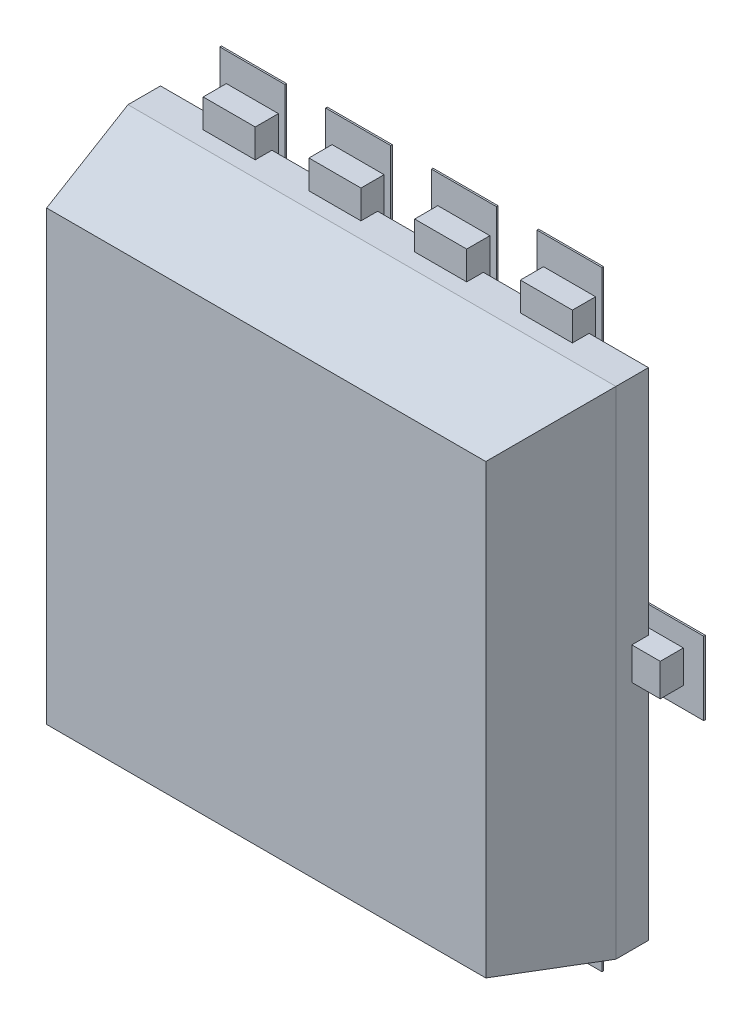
ISO-10303-21;
HEADER;
FILE_DESCRIPTION(('STEP AP214'),'2;1');
FILE_NAME('part.step','',(''),(''),'','','');
FILE_SCHEMA(('AUTOMOTIVE_DESIGN { 1 0 10303 214 1 1 1 1 }'));
ENDSEC;
DATA;
#1=APPLICATION_CONTEXT('core data for automotive mechanical design processes');
#2=APPLICATION_PROTOCOL_DEFINITION('international standard','automotive_design',2000,#1);
#3=PRODUCT_CONTEXT('',#1,'mechanical');
#4=PRODUCT('Part','Part','',(#3));
#5=PRODUCT_RELATED_PRODUCT_CATEGORY('part','',(#4));
#6=PRODUCT_DEFINITION_FORMATION('','',#4);
#7=PRODUCT_DEFINITION_CONTEXT('part definition',#1,'design');
#8=PRODUCT_DEFINITION('design','',#6,#7);
#9=PRODUCT_DEFINITION_SHAPE('','',#8);
#10=(LENGTH_UNIT() NAMED_UNIT(*) SI_UNIT(.MILLI.,.METRE.));
#11=(NAMED_UNIT(*) PLANE_ANGLE_UNIT() SI_UNIT($,.RADIAN.));
#12=(NAMED_UNIT(*) SI_UNIT($,.STERADIAN.) SOLID_ANGLE_UNIT());
#13=UNCERTAINTY_MEASURE_WITH_UNIT(LENGTH_MEASURE(1.E-05),#10,'distance_accuracy_value','');
#14=(GEOMETRIC_REPRESENTATION_CONTEXT(3) GLOBAL_UNCERTAINTY_ASSIGNED_CONTEXT((#13)) GLOBAL_UNIT_ASSIGNED_CONTEXT((#10,
#11,#12)) REPRESENTATION_CONTEXT('',''));
#15=CARTESIAN_POINT('',(0.,0.,0.));
#16=DIRECTION('',(0.,0.,1.));
#17=DIRECTION('',(1.,0.,0.));
#18=AXIS2_PLACEMENT_3D('',#15,#16,#17);
#19=CARTESIAN_POINT('',(1.34499999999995,-0.59899999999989,0.0762));
#20=DIRECTION('',(1.,0.,0.));
#21=DIRECTION('',(0.,0.,-1.));
#22=AXIS2_PLACEMENT_3D('',#19,#20,#21);
#23=PLANE('',#22);
#24=DIRECTION('',(0.,0.,-1.));
#25=VECTOR('',#24,1.);
#26=CARTESIAN_POINT('',(1.34499999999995,-0.59899999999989,0.0762));
#27=LINE('',#26,#25);
#28=CARTESIAN_POINT('',(1.34499999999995,-0.59899999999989,0.0762));
#29=VERTEX_POINT('',#28);
#30=CARTESIAN_POINT('',(1.34499999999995,-0.59899999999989,0.0862000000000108));
#31=VERTEX_POINT('',#30);
#32=EDGE_CURVE('E985',#29,#31,#27,.F.);
#33=ORIENTED_EDGE('',*,*,#32,.F.);
#34=DIRECTION('',(0.,1.,0.));
#35=VECTOR('',#34,1.);
#36=CARTESIAN_POINT('',(1.34499999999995,0.,0.0762));
#37=LINE('',#36,#35);
#38=CARTESIAN_POINT('',(1.34499999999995,-0.224999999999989,0.0762));
#39=VERTEX_POINT('',#38);
#40=EDGE_CURVE('E972',#29,#39,#37,.T.);
#41=ORIENTED_EDGE('',*,*,#40,.T.);
#42=DIRECTION('',(0.,0.,-1.));
#43=VECTOR('',#42,1.);
#44=CARTESIAN_POINT('',(1.34499999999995,-0.224999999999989,0.0762));
#45=LINE('',#44,#43);
#46=CARTESIAN_POINT('',(1.34499999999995,-0.224999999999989,0.0862000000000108));
#47=VERTEX_POINT('',#46);
#48=EDGE_CURVE('E1168',#47,#39,#45,.T.);
#49=ORIENTED_EDGE('',*,*,#48,.F.);
#50=DIRECTION('',(0.,1.,0.));
#51=VECTOR('',#50,1.);
#52=CARTESIAN_POINT('',(1.34499999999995,0.,0.0862000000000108));
#53=LINE('',#52,#51);
#54=EDGE_CURVE('E1067',#31,#47,#53,.T.);
#55=ORIENTED_EDGE('',*,*,#54,.F.);
#56=EDGE_LOOP('',(#33,#41,#49,#55));
#57=FACE_BOUND('',#56,.T.);
#58=ADVANCED_FACE('F16',(#57),#23,.T.);
#59=CARTESIAN_POINT('',(1.34499999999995,-0.224999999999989,0.0762));
#60=DIRECTION('',(0.,-1.,0.));
#61=DIRECTION('',(0.,0.,-1.));
#62=AXIS2_PLACEMENT_3D('',#59,#60,#61);
#63=PLANE('',#62);
#64=ORIENTED_EDGE('',*,*,#48,.T.);
#65=DIRECTION('',(1.,0.,0.));
#66=VECTOR('',#65,1.);
#67=CARTESIAN_POINT('',(0.,-0.224999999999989,0.0762));
#68=LINE('',#67,#66);
#69=CARTESIAN_POINT('',(1.79999999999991,-0.224999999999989,0.0762));
#70=VERTEX_POINT('',#69);
#71=EDGE_CURVE('E969',#39,#70,#68,.T.);
#72=ORIENTED_EDGE('',*,*,#71,.T.);
#73=DIRECTION('',(0.,0.,-1.));
#74=VECTOR('',#73,1.);
#75=CARTESIAN_POINT('',(1.79999999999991,-0.224999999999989,0.0762));
#76=LINE('',#75,#74);
#77=CARTESIAN_POINT('',(1.79999999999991,-0.224999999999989,0.0862000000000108));
#78=VERTEX_POINT('',#77);
#79=EDGE_CURVE('E1165',#78,#70,#76,.T.);
#80=ORIENTED_EDGE('',*,*,#79,.F.);
#81=DIRECTION('',(1.,0.,0.));
#82=VECTOR('',#81,1.);
#83=CARTESIAN_POINT('',(0.,-0.224999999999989,0.0862000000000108));
#84=LINE('',#83,#82);
#85=EDGE_CURVE('E1034',#47,#78,#84,.T.);
#86=ORIENTED_EDGE('',*,*,#85,.F.);
#87=EDGE_LOOP('',(#64,#72,#80,#86));
#88=FACE_BOUND('',#87,.T.);
#89=ADVANCED_FACE('F1395',(#88),#63,.T.);
#90=CARTESIAN_POINT('',(1.79999999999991,-0.224999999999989,0.0762));
#91=DIRECTION('',(1.,0.,0.));
#92=DIRECTION('',(0.,0.,-1.));
#93=AXIS2_PLACEMENT_3D('',#90,#91,#92);
#94=PLANE('',#93);
#95=ORIENTED_EDGE('',*,*,#79,.T.);
#96=DIRECTION('',(0.,1.,0.));
#97=VECTOR('',#96,1.);
#98=CARTESIAN_POINT('',(1.79999999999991,0.,0.0762));
#99=LINE('',#98,#97);
#100=CARTESIAN_POINT('',(1.79999999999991,0.224999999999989,0.0762));
#101=VERTEX_POINT('',#100);
#102=EDGE_CURVE('E967',#70,#101,#99,.T.);
#103=ORIENTED_EDGE('',*,*,#102,.T.);
#104=DIRECTION('',(0.,0.,1.));
#105=VECTOR('',#104,1.);
#106=CARTESIAN_POINT('',(1.79999999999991,0.224999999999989,0.0762));
#107=LINE('',#106,#105);
#108=CARTESIAN_POINT('',(1.79999999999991,0.224999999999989,0.0862000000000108));
#109=VERTEX_POINT('',#108);
#110=EDGE_CURVE('E1162',#109,#101,#107,.F.);
#111=ORIENTED_EDGE('',*,*,#110,.F.);
#112=DIRECTION('',(0.,1.,0.));
#113=VECTOR('',#112,1.);
#114=CARTESIAN_POINT('',(1.79999999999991,0.,0.0862000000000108));
#115=LINE('',#114,#113);
#116=EDGE_CURVE('E1031',#78,#109,#115,.T.);
#117=ORIENTED_EDGE('',*,*,#116,.F.);
#118=EDGE_LOOP('',(#95,#103,#111,#117));
#119=FACE_BOUND('',#118,.T.);
#120=ADVANCED_FACE('F1391',(#119),#94,.T.);
#121=CARTESIAN_POINT('',(1.79999999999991,0.224999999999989,0.0762));
#122=DIRECTION('',(0.,1.,0.));
#123=DIRECTION('',(0.,0.,1.));
#124=AXIS2_PLACEMENT_3D('',#121,#122,#123);
#125=PLANE('',#124);
#126=ORIENTED_EDGE('',*,*,#110,.T.);
#127=DIRECTION('',(1.,0.,0.));
#128=VECTOR('',#127,1.);
#129=CARTESIAN_POINT('',(0.,0.224999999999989,0.0762));
#130=LINE('',#129,#128);
#131=CARTESIAN_POINT('',(1.34499999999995,0.224999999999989,0.0762));
#132=VERTEX_POINT('',#131);
#133=EDGE_CURVE('E965',#101,#132,#130,.F.);
#134=ORIENTED_EDGE('',*,*,#133,.T.);
#135=DIRECTION('',(0.,0.,-1.));
#136=VECTOR('',#135,1.);
#137=CARTESIAN_POINT('',(1.34499999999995,0.224999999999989,0.0762));
#138=LINE('',#137,#136);
#139=CARTESIAN_POINT('',(1.34499999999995,0.224999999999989,0.0862000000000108));
#140=VERTEX_POINT('',#139);
#141=EDGE_CURVE('E1159',#140,#132,#138,.T.);
#142=ORIENTED_EDGE('',*,*,#141,.F.);
#143=DIRECTION('',(1.,0.,0.));
#144=VECTOR('',#143,1.);
#145=CARTESIAN_POINT('',(0.,0.224999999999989,0.0862000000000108));
#146=LINE('',#145,#144);
#147=EDGE_CURVE('E1028',#109,#140,#146,.F.);
#148=ORIENTED_EDGE('',*,*,#147,.F.);
#149=EDGE_LOOP('',(#126,#134,#142,#148));
#150=FACE_BOUND('',#149,.T.);
#151=ADVANCED_FACE('F1388',(#150),#125,.T.);
#152=CARTESIAN_POINT('',(1.34499999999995,0.224999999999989,0.0762));
#153=DIRECTION('',(1.,0.,0.));
#154=DIRECTION('',(0.,0.,-1.));
#155=AXIS2_PLACEMENT_3D('',#152,#153,#154);
#156=PLANE('',#155);
#157=ORIENTED_EDGE('',*,*,#141,.T.);
#158=DIRECTION('',(0.,1.,0.));
#159=VECTOR('',#158,1.);
#160=CARTESIAN_POINT('',(1.34499999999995,0.,0.0762));
#161=LINE('',#160,#159);
#162=CARTESIAN_POINT('',(1.34499999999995,1.34999999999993,0.0762));
#163=VERTEX_POINT('',#162);
#164=EDGE_CURVE('E963',#132,#163,#161,.T.);
#165=ORIENTED_EDGE('',*,*,#164,.T.);
#166=DIRECTION('',(0.,0.,1.));
#167=VECTOR('',#166,1.);
#168=CARTESIAN_POINT('',(1.34499999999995,1.34999999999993,0.0762));
#169=LINE('',#168,#167);
#170=CARTESIAN_POINT('',(1.34499999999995,1.34999999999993,0.0862000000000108));
#171=VERTEX_POINT('',#170);
#172=EDGE_CURVE('E1156',#171,#163,#169,.F.);
#173=ORIENTED_EDGE('',*,*,#172,.F.);
#174=DIRECTION('',(0.,1.,0.));
#175=VECTOR('',#174,1.);
#176=CARTESIAN_POINT('',(1.34499999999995,0.,0.0862000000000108));
#177=LINE('',#176,#175);
#178=EDGE_CURVE('E1025',#140,#171,#177,.T.);
#179=ORIENTED_EDGE('',*,*,#178,.F.);
#180=EDGE_LOOP('',(#157,#165,#173,#179));
#181=FACE_BOUND('',#180,.T.);
#182=ADVANCED_FACE('F1384',(#181),#156,.T.);
#183=CARTESIAN_POINT('',(1.34499999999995,1.34999999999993,0.0762));
#184=DIRECTION('',(0.,1.,0.));
#185=DIRECTION('',(0.,0.,1.));
#186=AXIS2_PLACEMENT_3D('',#183,#184,#185);
#187=PLANE('',#186);
#188=ORIENTED_EDGE('',*,*,#172,.T.);
#189=DIRECTION('',(1.,0.,0.));
#190=VECTOR('',#189,1.);
#191=CARTESIAN_POINT('',(0.,1.34999999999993,0.0762));
#192=LINE('',#191,#190);
#193=CARTESIAN_POINT('',(1.17500000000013,1.34999999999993,0.0762));
#194=VERTEX_POINT('',#193);
#195=EDGE_CURVE('E961',#163,#194,#192,.F.);
#196=ORIENTED_EDGE('',*,*,#195,.T.);
#197=DIRECTION('',(0.,0.,-1.));
#198=VECTOR('',#197,1.);
#199=CARTESIAN_POINT('',(1.17500000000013,1.34999999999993,0.0762));
#200=LINE('',#199,#198);
#201=CARTESIAN_POINT('',(1.17500000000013,1.34999999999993,0.0862000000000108));
#202=VERTEX_POINT('',#201);
#203=EDGE_CURVE('E1153',#202,#194,#200,.T.);
#204=ORIENTED_EDGE('',*,*,#203,.F.);
#205=DIRECTION('',(1.,0.,0.));
#206=VECTOR('',#205,1.);
#207=CARTESIAN_POINT('',(0.,1.34999999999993,0.0862000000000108));
#208=LINE('',#207,#206);
#209=EDGE_CURVE('E1022',#171,#202,#208,.F.);
#210=ORIENTED_EDGE('',*,*,#209,.F.);
#211=EDGE_LOOP('',(#188,#196,#204,#210));
#212=FACE_BOUND('',#211,.T.);
#213=ADVANCED_FACE('F1379',(#212),#187,.T.);
#214=CARTESIAN_POINT('',(1.17500000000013,1.34999999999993,0.0762));
#215=DIRECTION('',(1.,0.,0.));
#216=DIRECTION('',(0.,0.,-1.));
#217=AXIS2_PLACEMENT_3D('',#214,#215,#216);
#218=PLANE('',#217);
#219=ORIENTED_EDGE('',*,*,#203,.T.);
#220=DIRECTION('',(0.,1.,0.));
#221=VECTOR('',#220,1.);
#222=CARTESIAN_POINT('',(1.17500000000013,0.,0.0762));
#223=LINE('',#222,#221);
#224=CARTESIAN_POINT('',(1.17500000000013,1.87500000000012,0.0762));
#225=VERTEX_POINT('',#224);
#226=EDGE_CURVE('E959',#194,#225,#223,.T.);
#227=ORIENTED_EDGE('',*,*,#226,.T.);
#228=DIRECTION('',(0.,0.,1.));
#229=VECTOR('',#228,1.);
#230=CARTESIAN_POINT('',(1.17500000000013,1.87500000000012,0.0762));
#231=LINE('',#230,#229);
#232=CARTESIAN_POINT('',(1.17500000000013,1.87500000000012,0.0862000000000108));
#233=VERTEX_POINT('',#232);
#234=EDGE_CURVE('E1128',#233,#225,#231,.F.);
#235=ORIENTED_EDGE('',*,*,#234,.F.);
#236=DIRECTION('',(0.,1.,0.));
#237=VECTOR('',#236,1.);
#238=CARTESIAN_POINT('',(1.17500000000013,0.,0.0862000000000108));
#239=LINE('',#238,#237);
#240=EDGE_CURVE('E1019',#202,#233,#239,.T.);
#241=ORIENTED_EDGE('',*,*,#240,.F.);
#242=EDGE_LOOP('',(#219,#227,#235,#241));
#243=FACE_BOUND('',#242,.T.);
#244=ADVANCED_FACE('F1376',(#243),#218,.T.);
#245=CARTESIAN_POINT('',(1.17500000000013,1.87500000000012,0.0762));
#246=DIRECTION('',(0.,1.,0.));
#247=DIRECTION('',(0.,0.,1.));
#248=AXIS2_PLACEMENT_3D('',#245,#246,#247);
#249=PLANE('',#248);
#250=ORIENTED_EDGE('',*,*,#234,.T.);
#251=DIRECTION('',(1.,0.,0.));
#252=VECTOR('',#251,1.);
#253=CARTESIAN_POINT('',(0.,1.87500000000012,0.0762));
#254=LINE('',#253,#252);
#255=CARTESIAN_POINT('',(0.774999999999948,1.87500000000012,0.0762));
#256=VERTEX_POINT('',#255);
#257=EDGE_CURVE('E957',#225,#256,#254,.F.);
#258=ORIENTED_EDGE('',*,*,#257,.T.);
#259=DIRECTION('',(0.,0.,1.));
#260=VECTOR('',#259,1.);
#261=CARTESIAN_POINT('',(0.774999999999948,1.87500000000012,0.0762));
#262=LINE('',#261,#260);
#263=CARTESIAN_POINT('',(0.774999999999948,1.87500000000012,0.0862000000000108));
#264=VERTEX_POINT('',#263);
#265=EDGE_CURVE('E1001',#264,#256,#262,.F.);
#266=ORIENTED_EDGE('',*,*,#265,.F.);
#267=DIRECTION('',(1.,0.,0.));
#268=VECTOR('',#267,1.);
#269=CARTESIAN_POINT('',(0.,1.87500000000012,0.0862000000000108));
#270=LINE('',#269,#268);
#271=EDGE_CURVE('E1017',#233,#264,#270,.F.);
#272=ORIENTED_EDGE('',*,*,#271,.F.);
#273=EDGE_LOOP('',(#250,#258,#266,#272));
#274=FACE_BOUND('',#273,.T.);
#275=ADVANCED_FACE('F1372',(#274),#249,.T.);
#276=CARTESIAN_POINT('',(-0.774999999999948,1.87500000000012,0.0762));
#277=DIRECTION('',(0.,1.,0.));
#278=DIRECTION('',(0.,0.,1.));
#279=AXIS2_PLACEMENT_3D('',#276,#277,#278);
#280=PLANE('',#279);
#281=DIRECTION('',(0.,0.,-1.));
#282=VECTOR('',#281,1.);
#283=CARTESIAN_POINT('',(-0.774999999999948,1.87500000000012,0.0762));
#284=LINE('',#283,#282);
#285=CARTESIAN_POINT('',(-0.774999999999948,1.87500000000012,0.0762));
#286=VERTEX_POINT('',#285);
#287=CARTESIAN_POINT('',(-0.774999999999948,1.87500000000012,0.0862000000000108));
#288=VERTEX_POINT('',#287);
#289=EDGE_CURVE('E991',#286,#288,#284,.F.);
#290=ORIENTED_EDGE('',*,*,#289,.F.);
#291=DIRECTION('',(1.,0.,0.));
#292=VECTOR('',#291,1.);
#293=CARTESIAN_POINT('',(0.,1.87500000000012,0.0762));
#294=LINE('',#293,#292);
#295=CARTESIAN_POINT('',(-1.17500000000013,1.87500000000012,0.0762));
#296=VERTEX_POINT('',#295);
#297=EDGE_CURVE('E1197',#286,#296,#294,.F.);
#298=ORIENTED_EDGE('',*,*,#297,.T.);
#299=DIRECTION('',(0.,0.,1.));
#300=VECTOR('',#299,1.);
#301=CARTESIAN_POINT('',(-1.17500000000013,1.87500000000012,0.0762));
#302=LINE('',#301,#300);
#303=CARTESIAN_POINT('',(-1.17500000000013,1.87500000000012,0.0862000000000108));
#304=VERTEX_POINT('',#303);
#305=EDGE_CURVE('E1118',#304,#296,#302,.F.);
#306=ORIENTED_EDGE('',*,*,#305,.F.);
#307=DIRECTION('',(1.,0.,0.));
#308=VECTOR('',#307,1.);
#309=CARTESIAN_POINT('',(0.,1.87500000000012,0.0862000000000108));
#310=LINE('',#309,#308);
#311=EDGE_CURVE('E1123',#288,#304,#310,.F.);
#312=ORIENTED_EDGE('',*,*,#311,.F.);
#313=EDGE_LOOP('',(#290,#298,#306,#312));
#314=FACE_BOUND('',#313,.T.);
#315=ADVANCED_FACE('F1317',(#314),#280,.T.);
#316=CARTESIAN_POINT('',(-1.17500000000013,1.87500000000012,0.0762));
#317=DIRECTION('',(-1.,0.,0.));
#318=DIRECTION('',(0.,0.,1.));
#319=AXIS2_PLACEMENT_3D('',#316,#317,#318);
#320=PLANE('',#319);
#321=ORIENTED_EDGE('',*,*,#305,.T.);
#322=DIRECTION('',(0.,1.,0.));
#323=VECTOR('',#322,1.);
#324=CARTESIAN_POINT('',(-1.17500000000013,0.,0.0762));
#325=LINE('',#324,#323);
#326=CARTESIAN_POINT('',(-1.17500000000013,1.34999999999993,0.0762));
#327=VERTEX_POINT('',#326);
#328=EDGE_CURVE('E1193',#296,#327,#325,.F.);
#329=ORIENTED_EDGE('',*,*,#328,.T.);
#330=DIRECTION('',(0.,0.,1.));
#331=VECTOR('',#330,1.);
#332=CARTESIAN_POINT('',(-1.17500000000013,1.34999999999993,0.0762));
#333=LINE('',#332,#331);
#334=CARTESIAN_POINT('',(-1.17500000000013,1.34999999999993,0.0862000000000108));
#335=VERTEX_POINT('',#334);
#336=EDGE_CURVE('E1108',#335,#327,#333,.F.);
#337=ORIENTED_EDGE('',*,*,#336,.F.);
#338=DIRECTION('',(0.,1.,0.));
#339=VECTOR('',#338,1.);
#340=CARTESIAN_POINT('',(-1.17500000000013,0.,0.0862000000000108));
#341=LINE('',#340,#339);
#342=EDGE_CURVE('E1113',#304,#335,#341,.F.);
#343=ORIENTED_EDGE('',*,*,#342,.F.);
#344=EDGE_LOOP('',(#321,#329,#337,#343));
#345=FACE_BOUND('',#344,.T.);
#346=ADVANCED_FACE('F1313',(#345),#320,.T.);
#347=CARTESIAN_POINT('',(-1.17500000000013,1.34999999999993,0.0762));
#348=DIRECTION('',(0.,1.,0.));
#349=DIRECTION('',(0.,0.,1.));
#350=AXIS2_PLACEMENT_3D('',#347,#348,#349);
#351=PLANE('',#350);
#352=ORIENTED_EDGE('',*,*,#336,.T.);
#353=DIRECTION('',(1.,0.,0.));
#354=VECTOR('',#353,1.);
#355=CARTESIAN_POINT('',(0.,1.34999999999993,0.0762));
#356=LINE('',#355,#354);
#357=CARTESIAN_POINT('',(-1.34499999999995,1.34999999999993,0.0762));
#358=VERTEX_POINT('',#357);
#359=EDGE_CURVE('E1189',#327,#358,#356,.F.);
#360=ORIENTED_EDGE('',*,*,#359,.T.);
#361=DIRECTION('',(0.,0.,1.));
#362=VECTOR('',#361,1.);
#363=CARTESIAN_POINT('',(-1.34499999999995,1.34999999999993,0.0762));
#364=LINE('',#363,#362);
#365=CARTESIAN_POINT('',(-1.34499999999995,1.34999999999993,0.0862000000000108));
#366=VERTEX_POINT('',#365);
#367=EDGE_CURVE('E1098',#366,#358,#364,.F.);
#368=ORIENTED_EDGE('',*,*,#367,.F.);
#369=DIRECTION('',(1.,0.,0.));
#370=VECTOR('',#369,1.);
#371=CARTESIAN_POINT('',(0.,1.34999999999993,0.0862000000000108));
#372=LINE('',#371,#370);
#373=EDGE_CURVE('E1103',#335,#366,#372,.F.);
#374=ORIENTED_EDGE('',*,*,#373,.F.);
#375=EDGE_LOOP('',(#352,#360,#368,#374));
#376=FACE_BOUND('',#375,.T.);
#377=ADVANCED_FACE('F1309',(#376),#351,.T.);
#378=CARTESIAN_POINT('',(-1.34499999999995,1.34999999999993,0.0762));
#379=DIRECTION('',(-1.,0.,0.));
#380=DIRECTION('',(0.,0.,1.));
#381=AXIS2_PLACEMENT_3D('',#378,#379,#380);
#382=PLANE('',#381);
#383=ORIENTED_EDGE('',*,*,#367,.T.);
#384=DIRECTION('',(0.,1.,0.));
#385=VECTOR('',#384,1.);
#386=CARTESIAN_POINT('',(-1.34499999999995,0.,0.0762));
#387=LINE('',#386,#385);
#388=CARTESIAN_POINT('',(-1.34499999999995,0.224999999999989,0.0762));
#389=VERTEX_POINT('',#388);
#390=EDGE_CURVE('E1185',#358,#389,#387,.F.);
#391=ORIENTED_EDGE('',*,*,#390,.T.);
#392=DIRECTION('',(0.,0.,1.));
#393=VECTOR('',#392,1.);
#394=CARTESIAN_POINT('',(-1.34499999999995,0.224999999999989,0.0762));
#395=LINE('',#394,#393);
#396=CARTESIAN_POINT('',(-1.34499999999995,0.224999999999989,0.0862000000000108));
#397=VERTEX_POINT('',#396);
#398=EDGE_CURVE('E1088',#397,#389,#395,.F.);
#399=ORIENTED_EDGE('',*,*,#398,.F.);
#400=DIRECTION('',(0.,1.,0.));
#401=VECTOR('',#400,1.);
#402=CARTESIAN_POINT('',(-1.34499999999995,0.,0.0862000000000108));
#403=LINE('',#402,#401);
#404=EDGE_CURVE('E1093',#366,#397,#403,.F.);
#405=ORIENTED_EDGE('',*,*,#404,.F.);
#406=EDGE_LOOP('',(#383,#391,#399,#405));
#407=FACE_BOUND('',#406,.T.);
#408=ADVANCED_FACE('F1306',(#407),#382,.T.);
#409=CARTESIAN_POINT('',(-1.34499999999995,0.224999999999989,0.0762));
#410=DIRECTION('',(0.,1.,0.));
#411=DIRECTION('',(0.,0.,1.));
#412=AXIS2_PLACEMENT_3D('',#409,#410,#411);
#413=PLANE('',#412);
#414=ORIENTED_EDGE('',*,*,#398,.T.);
#415=DIRECTION('',(1.,0.,0.));
#416=VECTOR('',#415,1.);
#417=CARTESIAN_POINT('',(0.,0.224999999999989,0.0762));
#418=LINE('',#417,#416);
#419=CARTESIAN_POINT('',(-1.79999999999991,0.224999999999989,0.0762));
#420=VERTEX_POINT('',#419);
#421=EDGE_CURVE('E1181',#389,#420,#418,.F.);
#422=ORIENTED_EDGE('',*,*,#421,.T.);
#423=DIRECTION('',(0.,0.,1.));
#424=VECTOR('',#423,1.);
#425=CARTESIAN_POINT('',(-1.79999999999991,0.224999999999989,0.0762));
#426=LINE('',#425,#424);
#427=CARTESIAN_POINT('',(-1.79999999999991,0.224999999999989,0.0862000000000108));
#428=VERTEX_POINT('',#427);
#429=EDGE_CURVE('E1078',#428,#420,#426,.F.);
#430=ORIENTED_EDGE('',*,*,#429,.F.);
#431=DIRECTION('',(1.,0.,0.));
#432=VECTOR('',#431,1.);
#433=CARTESIAN_POINT('',(0.,0.224999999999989,0.0862000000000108));
#434=LINE('',#433,#432);
#435=EDGE_CURVE('E1083',#397,#428,#434,.F.);
#436=ORIENTED_EDGE('',*,*,#435,.F.);
#437=EDGE_LOOP('',(#414,#422,#430,#436));
#438=FACE_BOUND('',#437,.T.);
#439=ADVANCED_FACE('F1302',(#438),#413,.T.);
#440=CARTESIAN_POINT('',(-1.79999999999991,0.224999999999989,0.0762));
#441=DIRECTION('',(-1.,0.,0.));
#442=DIRECTION('',(0.,0.,1.));
#443=AXIS2_PLACEMENT_3D('',#440,#441,#442);
#444=PLANE('',#443);
#445=ORIENTED_EDGE('',*,*,#429,.T.);
#446=DIRECTION('',(0.,1.,0.));
#447=VECTOR('',#446,1.);
#448=CARTESIAN_POINT('',(-1.79999999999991,0.,0.0762));
#449=LINE('',#448,#447);
#450=CARTESIAN_POINT('',(-1.79999999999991,-0.224999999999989,0.0762));
#451=VERTEX_POINT('',#450);
#452=EDGE_CURVE('E1177',#420,#451,#449,.F.);
#453=ORIENTED_EDGE('',*,*,#452,.T.);
#454=DIRECTION('',(0.,0.,-1.));
#455=VECTOR('',#454,1.);
#456=CARTESIAN_POINT('',(-1.79999999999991,-0.224999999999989,0.0762));
#457=LINE('',#456,#455);
#458=CARTESIAN_POINT('',(-1.79999999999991,-0.224999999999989,0.0862000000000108));
#459=VERTEX_POINT('',#458);
#460=EDGE_CURVE('E1068',#459,#451,#457,.T.);
#461=ORIENTED_EDGE('',*,*,#460,.F.);
#462=DIRECTION('',(0.,1.,0.));
#463=VECTOR('',#462,1.);
#464=CARTESIAN_POINT('',(-1.79999999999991,0.,0.0862000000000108));
#465=LINE('',#464,#463);
#466=EDGE_CURVE('E1073',#428,#459,#465,.F.);
#467=ORIENTED_EDGE('',*,*,#466,.F.);
#468=EDGE_LOOP('',(#445,#453,#461,#467));
#469=FACE_BOUND('',#468,.T.);
#470=ADVANCED_FACE('F1297',(#469),#444,.T.);
#471=CARTESIAN_POINT('',(-1.79999999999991,-0.224999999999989,0.0762));
#472=DIRECTION('',(0.,-1.,0.));
#473=DIRECTION('',(0.,0.,-1.));
#474=AXIS2_PLACEMENT_3D('',#471,#472,#473);
#475=PLANE('',#474);
#476=ORIENTED_EDGE('',*,*,#460,.T.);
#477=DIRECTION('',(1.,0.,0.));
#478=VECTOR('',#477,1.);
#479=CARTESIAN_POINT('',(0.,-0.224999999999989,0.0762));
#480=LINE('',#479,#478);
#481=CARTESIAN_POINT('',(-1.34499999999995,-0.224999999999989,0.0762));
#482=VERTEX_POINT('',#481);
#483=EDGE_CURVE('E1036',#451,#482,#480,.T.);
#484=ORIENTED_EDGE('',*,*,#483,.T.);
#485=DIRECTION('',(0.,0.,1.));
#486=VECTOR('',#485,1.);
#487=CARTESIAN_POINT('',(-1.34499999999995,-0.224999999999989,0.0762));
#488=LINE('',#487,#486);
#489=CARTESIAN_POINT('',(-1.34499999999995,-0.224999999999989,0.0862000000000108));
#490=VERTEX_POINT('',#489);
#491=EDGE_CURVE('E1064',#490,#482,#488,.F.);
#492=ORIENTED_EDGE('',*,*,#491,.F.);
#493=DIRECTION('',(1.,0.,0.));
#494=VECTOR('',#493,1.);
#495=CARTESIAN_POINT('',(0.,-0.224999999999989,0.0862000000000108));
#496=LINE('',#495,#494);
#497=EDGE_CURVE('E1050',#459,#490,#496,.T.);
#498=ORIENTED_EDGE('',*,*,#497,.F.);
#499=EDGE_LOOP('',(#476,#484,#492,#498));
#500=FACE_BOUND('',#499,.T.);
#501=ADVANCED_FACE('F1294',(#500),#475,.T.);
#502=CARTESIAN_POINT('',(-1.34499999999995,-0.224999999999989,0.0762));
#503=DIRECTION('',(-1.,0.,0.));
#504=DIRECTION('',(0.,0.,1.));
#505=AXIS2_PLACEMENT_3D('',#502,#503,#504);
#506=PLANE('',#505);
#507=ORIENTED_EDGE('',*,*,#491,.T.);
#508=DIRECTION('',(0.,1.,0.));
#509=VECTOR('',#508,1.);
#510=CARTESIAN_POINT('',(-1.34499999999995,0.,0.0762));
#511=LINE('',#510,#509);
#512=CARTESIAN_POINT('',(-1.34499999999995,-0.59899999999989,0.0762));
#513=VERTEX_POINT('',#512);
#514=EDGE_CURVE('E716',#482,#513,#511,.F.);
#515=ORIENTED_EDGE('',*,*,#514,.T.);
#516=DIRECTION('',(0.,0.,-1.));
#517=VECTOR('',#516,1.);
#518=CARTESIAN_POINT('',(-1.34499999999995,-0.59899999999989,0.0762));
#519=LINE('',#518,#517);
#520=CARTESIAN_POINT('',(-1.34499999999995,-0.59899999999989,0.0862000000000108));
#521=VERTEX_POINT('',#520);
#522=EDGE_CURVE('E924',#521,#513,#519,.T.);
#523=ORIENTED_EDGE('',*,*,#522,.F.);
#524=DIRECTION('',(0.,1.,0.));
#525=VECTOR('',#524,1.);
#526=CARTESIAN_POINT('',(-1.34499999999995,0.,0.0862000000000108));
#527=LINE('',#526,#525);
#528=EDGE_CURVE('E1046',#490,#521,#527,.F.);
#529=ORIENTED_EDGE('',*,*,#528,.F.);
#530=EDGE_LOOP('',(#507,#515,#523,#529));
#531=FACE_BOUND('',#530,.T.);
#532=ADVANCED_FACE('F1291',(#531),#506,.T.);
#533=CARTESIAN_POINT('',(0.,0.,0.0762));
#534=DIRECTION('',(0.,0.,1.));
#535=DIRECTION('',(1.,0.,0.));
#536=AXIS2_PLACEMENT_3D('',#533,#534,#535);
#537=PLANE('',#536);
#538=DIRECTION('',(1.,0.,0.));
#539=VECTOR('',#538,1.);
#540=CARTESIAN_POINT('',(-0.774999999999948,-1.09949999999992,0.0762));
#541=LINE('',#540,#539);
#542=CARTESIAN_POINT('',(-0.774999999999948,-1.09949999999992,0.0762));
#543=VERTEX_POINT('',#542);
#544=CARTESIAN_POINT('',(-1.17500000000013,-1.09949999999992,0.0762));
#545=VERTEX_POINT('',#544);
#546=EDGE_CURVE('E906',#543,#545,#541,.F.);
#547=ORIENTED_EDGE('',*,*,#546,.F.);
#548=DIRECTION('',(0.,1.,0.));
#549=VECTOR('',#548,1.);
#550=CARTESIAN_POINT('',(-0.774999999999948,-1.87450000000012,0.0762));
#551=LINE('',#550,#549);
#552=CARTESIAN_POINT('',(-0.774999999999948,-1.87450000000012,0.0762));
#553=VERTEX_POINT('',#552);
#554=EDGE_CURVE('E911',#553,#543,#551,.T.);
#555=ORIENTED_EDGE('',*,*,#554,.F.);
#556=DIRECTION('',(1.,0.,0.));
#557=VECTOR('',#556,1.);
#558=CARTESIAN_POINT('',(-1.17500000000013,-1.87450000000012,0.0762));
#559=LINE('',#558,#557);
#560=CARTESIAN_POINT('',(-1.17500000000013,-1.87450000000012,0.0762));
#561=VERTEX_POINT('',#560);
#562=EDGE_CURVE('E892',#561,#553,#559,.T.);
#563=ORIENTED_EDGE('',*,*,#562,.F.);
#564=DIRECTION('',(0.,1.,0.));
#565=VECTOR('',#564,1.);
#566=CARTESIAN_POINT('',(-1.17500000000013,-1.09949999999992,0.0762));
#567=LINE('',#566,#565);
#568=EDGE_CURVE('E901',#545,#561,#567,.F.);
#569=ORIENTED_EDGE('',*,*,#568,.F.);
#570=EDGE_LOOP('',(#547,#555,#563,#569));
#571=FACE_BOUND('',#570,.T.);
#572=ADVANCED_FACE('F1612',(#571),#537,.F.);
#573=CARTESIAN_POINT('',(0.,0.,0.0762));
#574=DIRECTION('',(0.,0.,1.));
#575=DIRECTION('',(1.,0.,0.));
#576=AXIS2_PLACEMENT_3D('',#573,#574,#575);
#577=PLANE('',#576);
#578=DIRECTION('',(1.,0.,0.));
#579=VECTOR('',#578,1.);
#580=CARTESIAN_POINT('',(-0.125000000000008,-1.09949999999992,0.0762));
#581=LINE('',#580,#579);
#582=CARTESIAN_POINT('',(-0.125000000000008,-1.09949999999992,0.0762));
#583=VERTEX_POINT('',#582);
#584=CARTESIAN_POINT('',(-0.524999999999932,-1.09949999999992,0.0762));
#585=VERTEX_POINT('',#584);
#586=EDGE_CURVE('E885',#583,#585,#581,.F.);
#587=ORIENTED_EDGE('',*,*,#586,.F.);
#588=DIRECTION('',(0.,1.,0.));
#589=VECTOR('',#588,1.);
#590=CARTESIAN_POINT('',(-0.125000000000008,-1.87450000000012,0.0762));
#591=LINE('',#590,#589);
#592=CARTESIAN_POINT('',(-0.125000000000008,-1.87450000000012,0.0762));
#593=VERTEX_POINT('',#592);
#594=EDGE_CURVE('E890',#593,#583,#591,.T.);
#595=ORIENTED_EDGE('',*,*,#594,.F.);
#596=DIRECTION('',(1.,0.,0.));
#597=VECTOR('',#596,1.);
#598=CARTESIAN_POINT('',(-0.524999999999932,-1.87450000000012,0.0762));
#599=LINE('',#598,#597);
#600=CARTESIAN_POINT('',(-0.524999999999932,-1.87450000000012,0.0762));
#601=VERTEX_POINT('',#600);
#602=EDGE_CURVE('E871',#601,#593,#599,.T.);
#603=ORIENTED_EDGE('',*,*,#602,.F.);
#604=DIRECTION('',(0.,1.,0.));
#605=VECTOR('',#604,1.);
#606=CARTESIAN_POINT('',(-0.524999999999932,-1.09949999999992,0.0762));
#607=LINE('',#606,#605);
#608=EDGE_CURVE('E880',#585,#601,#607,.F.);
#609=ORIENTED_EDGE('',*,*,#608,.F.);
#610=EDGE_LOOP('',(#587,#595,#603,#609));
#611=FACE_BOUND('',#610,.T.);
#612=ADVANCED_FACE('F1614',(#611),#577,.F.);
#613=CARTESIAN_POINT('',(0.,0.,0.0762));
#614=DIRECTION('',(0.,0.,1.));
#615=DIRECTION('',(1.,0.,0.));
#616=AXIS2_PLACEMENT_3D('',#613,#614,#615);
#617=PLANE('',#616);
#618=DIRECTION('',(1.,0.,0.));
#619=VECTOR('',#618,1.);
#620=CARTESIAN_POINT('',(0.524999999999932,-1.09949999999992,0.0762));
#621=LINE('',#620,#619);
#622=CARTESIAN_POINT('',(0.524999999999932,-1.09949999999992,0.0762));
#623=VERTEX_POINT('',#622);
#624=CARTESIAN_POINT('',(0.125000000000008,-1.09949999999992,0.0762));
#625=VERTEX_POINT('',#624);
#626=EDGE_CURVE('E864',#623,#625,#621,.F.);
#627=ORIENTED_EDGE('',*,*,#626,.F.);
#628=DIRECTION('',(0.,1.,0.));
#629=VECTOR('',#628,1.);
#630=CARTESIAN_POINT('',(0.524999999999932,-1.87450000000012,0.0762));
#631=LINE('',#630,#629);
#632=CARTESIAN_POINT('',(0.524999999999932,-1.87450000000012,0.0762));
#633=VERTEX_POINT('',#632);
#634=EDGE_CURVE('E869',#633,#623,#631,.T.);
#635=ORIENTED_EDGE('',*,*,#634,.F.);
#636=DIRECTION('',(1.,0.,0.));
#637=VECTOR('',#636,1.);
#638=CARTESIAN_POINT('',(0.125000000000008,-1.87450000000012,0.0762));
#639=LINE('',#638,#637);
#640=CARTESIAN_POINT('',(0.125000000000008,-1.87450000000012,0.0762));
#641=VERTEX_POINT('',#640);
#642=EDGE_CURVE('E850',#641,#633,#639,.T.);
#643=ORIENTED_EDGE('',*,*,#642,.F.);
#644=DIRECTION('',(0.,1.,0.));
#645=VECTOR('',#644,1.);
#646=CARTESIAN_POINT('',(0.125000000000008,-1.09949999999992,0.0762));
#647=LINE('',#646,#645);
#648=EDGE_CURVE('E859',#625,#641,#647,.F.);
#649=ORIENTED_EDGE('',*,*,#648,.F.);
#650=EDGE_LOOP('',(#627,#635,#643,#649));
#651=FACE_BOUND('',#650,.T.);
#652=ADVANCED_FACE('F1621',(#651),#617,.F.);
#653=CARTESIAN_POINT('',(0.,0.,0.0762));
#654=DIRECTION('',(0.,0.,1.));
#655=DIRECTION('',(1.,0.,0.));
#656=AXIS2_PLACEMENT_3D('',#653,#654,#655);
#657=PLANE('',#656);
#658=DIRECTION('',(1.,0.,0.));
#659=VECTOR('',#658,1.);
#660=CARTESIAN_POINT('',(1.17500000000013,-1.09949999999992,0.0762));
#661=LINE('',#660,#659);
#662=CARTESIAN_POINT('',(1.17500000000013,-1.09949999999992,0.0762));
#663=VERTEX_POINT('',#662);
#664=CARTESIAN_POINT('',(0.774999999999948,-1.09949999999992,0.0762));
#665=VERTEX_POINT('',#664);
#666=EDGE_CURVE('E843',#663,#665,#661,.F.);
#667=ORIENTED_EDGE('',*,*,#666,.F.);
#668=DIRECTION('',(0.,1.,0.));
#669=VECTOR('',#668,1.);
#670=CARTESIAN_POINT('',(1.17500000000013,-1.87450000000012,0.0762));
#671=LINE('',#670,#669);
#672=CARTESIAN_POINT('',(1.17500000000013,-1.87450000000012,0.0762));
#673=VERTEX_POINT('',#672);
#674=EDGE_CURVE('E848',#673,#663,#671,.T.);
#675=ORIENTED_EDGE('',*,*,#674,.F.);
#676=DIRECTION('',(1.,0.,0.));
#677=VECTOR('',#676,1.);
#678=CARTESIAN_POINT('',(0.774999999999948,-1.87450000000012,0.0762));
#679=LINE('',#678,#677);
#680=CARTESIAN_POINT('',(0.774999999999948,-1.87450000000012,0.0762));
#681=VERTEX_POINT('',#680);
#682=EDGE_CURVE('E829',#681,#673,#679,.T.);
#683=ORIENTED_EDGE('',*,*,#682,.F.);
#684=DIRECTION('',(0.,1.,0.));
#685=VECTOR('',#684,1.);
#686=CARTESIAN_POINT('',(0.774999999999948,-1.09949999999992,0.0762));
#687=LINE('',#686,#685);
#688=EDGE_CURVE('E838',#665,#681,#687,.F.);
#689=ORIENTED_EDGE('',*,*,#688,.F.);
#690=EDGE_LOOP('',(#667,#675,#683,#689));
#691=FACE_BOUND('',#690,.T.);
#692=ADVANCED_FACE('F1972',(#691),#657,.F.);
#693=CARTESIAN_POINT('',(0.,0.,0.0862000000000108));
#694=DIRECTION('',(0.,0.,1.));
#695=DIRECTION('',(1.,0.,0.));
#696=AXIS2_PLACEMENT_3D('',#693,#694,#695);
#697=PLANE('',#696);
#698=DIRECTION('',(1.,0.,0.));
#699=VECTOR('',#698,1.);
#700=CARTESIAN_POINT('',(0.,-0.100000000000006,0.0862000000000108));
#701=LINE('',#700,#699);
#702=CARTESIAN_POINT('',(1.6749999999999,-0.100000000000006,0.0862000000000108));
#703=VERTEX_POINT('',#702);
#704=CARTESIAN_POINT('',(1.13500000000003,-0.100000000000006,0.0862000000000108));
#705=VERTEX_POINT('',#704);
#706=EDGE_CURVE('E1212',#703,#705,#701,.F.);
#707=ORIENTED_EDGE('',*,*,#706,.T.);
#708=DIRECTION('',(0.,1.,0.));
#709=VECTOR('',#708,1.);
#710=CARTESIAN_POINT('',(1.13500000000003,0.,0.0862000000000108));
#711=LINE('',#710,#709);
#712=CARTESIAN_POINT('',(1.13500000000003,-0.59899999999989,0.0862000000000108));
#713=VERTEX_POINT('',#712);
#714=EDGE_CURVE('E1007',#705,#713,#711,.F.);
#715=ORIENTED_EDGE('',*,*,#714,.T.);
#716=DIRECTION('',(1.,0.,0.));
#717=VECTOR('',#716,1.);
#718=CARTESIAN_POINT('',(-1.34499999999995,-0.59899999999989,0.0862000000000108));
#719=LINE('',#718,#717);
#720=EDGE_CURVE('E982',#31,#713,#719,.F.);
#721=ORIENTED_EDGE('',*,*,#720,.F.);
#722=ORIENTED_EDGE('',*,*,#54,.T.);
#723=ORIENTED_EDGE('',*,*,#85,.T.);
#724=ORIENTED_EDGE('',*,*,#116,.T.);
#725=ORIENTED_EDGE('',*,*,#147,.T.);
#726=ORIENTED_EDGE('',*,*,#178,.T.);
#727=ORIENTED_EDGE('',*,*,#209,.T.);
#728=ORIENTED_EDGE('',*,*,#240,.T.);
#729=ORIENTED_EDGE('',*,*,#271,.T.);
#730=DIRECTION('',(0.,1.,0.));
#731=VECTOR('',#730,1.);
#732=CARTESIAN_POINT('',(0.774999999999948,1.87500000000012,0.0862000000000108));
#733=LINE('',#732,#731);
#734=CARTESIAN_POINT('',(0.774999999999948,1.34999999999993,0.0862000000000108));
#735=VERTEX_POINT('',#734);
#736=EDGE_CURVE('E1004',#735,#264,#733,.T.);
#737=ORIENTED_EDGE('',*,*,#736,.F.);
#738=DIRECTION('',(1.,0.,0.));
#739=VECTOR('',#738,1.);
#740=CARTESIAN_POINT('',(0.,1.34999999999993,0.0862000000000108));
#741=LINE('',#740,#739);
#742=CARTESIAN_POINT('',(0.815000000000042,1.34999999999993,0.0862000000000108));
#743=VERTEX_POINT('',#742);
#744=EDGE_CURVE('E1014',#735,#743,#741,.T.);
#745=ORIENTED_EDGE('',*,*,#744,.T.);
#746=DIRECTION('',(0.,1.,0.));
#747=VECTOR('',#746,1.);
#748=CARTESIAN_POINT('',(0.815000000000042,0.,0.0862000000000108));
#749=LINE('',#748,#747);
#750=CARTESIAN_POINT('',(0.815000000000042,1.70000000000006,0.0862000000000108));
#751=VERTEX_POINT('',#750);
#752=EDGE_CURVE('E1011',#743,#751,#749,.T.);
#753=ORIENTED_EDGE('',*,*,#752,.T.);
#754=DIRECTION('',(1.,0.,0.));
#755=VECTOR('',#754,1.);
#756=CARTESIAN_POINT('',(0.,1.70000000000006,0.0862000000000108));
#757=LINE('',#756,#755);
#758=CARTESIAN_POINT('',(1.13500000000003,1.70000000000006,0.0862000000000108));
#759=VERTEX_POINT('',#758);
#760=EDGE_CURVE('E1008',#751,#759,#757,.T.);
#761=ORIENTED_EDGE('',*,*,#760,.T.);
#762=DIRECTION('',(0.,1.,0.));
#763=VECTOR('',#762,1.);
#764=CARTESIAN_POINT('',(1.13500000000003,0.100000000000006,0.0862000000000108));
#765=LINE('',#764,#763);
#766=CARTESIAN_POINT('',(1.13500000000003,0.100000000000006,0.0862000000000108));
#767=VERTEX_POINT('',#766);
#768=EDGE_CURVE('E822',#767,#759,#765,.T.);
#769=ORIENTED_EDGE('',*,*,#768,.F.);
#770=DIRECTION('',(1.,0.,0.));
#771=VECTOR('',#770,1.);
#772=CARTESIAN_POINT('',(0.,0.100000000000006,0.0862000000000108));
#773=LINE('',#772,#771);
#774=CARTESIAN_POINT('',(1.6749999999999,0.100000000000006,0.0862000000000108));
#775=VERTEX_POINT('',#774);
#776=EDGE_CURVE('E1010',#767,#775,#773,.T.);
#777=ORIENTED_EDGE('',*,*,#776,.T.);
#778=DIRECTION('',(0.,1.,0.));
#779=VECTOR('',#778,1.);
#780=CARTESIAN_POINT('',(1.6749999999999,0.,0.0862000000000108));
#781=LINE('',#780,#779);
#782=EDGE_CURVE('E1228',#775,#703,#781,.F.);
#783=ORIENTED_EDGE('',*,*,#782,.T.);
#784=EDGE_LOOP('',(#707,#715,#721,#722,#723,#724,#725,#726,#727,#728,#729,#737,#745,#753,#761,
#769,#777,#783));
#785=FACE_BOUND('',#784,.T.);
#786=ADVANCED_FACE('F1402',(#785),#697,.T.);
#787=CARTESIAN_POINT('',(0.774999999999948,1.87500000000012,0.0762));
#788=DIRECTION('',(-1.,0.,0.));
#789=DIRECTION('',(0.,0.,1.));
#790=AXIS2_PLACEMENT_3D('',#787,#788,#789);
#791=PLANE('',#790);
#792=DIRECTION('',(0.,1.,0.));
#793=VECTOR('',#792,1.);
#794=CARTESIAN_POINT('',(0.774999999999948,0.,0.0762));
#795=LINE('',#794,#793);
#796=CARTESIAN_POINT('',(0.774999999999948,1.34999999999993,0.0762));
#797=VERTEX_POINT('',#796);
#798=EDGE_CURVE('E955',#256,#797,#795,.F.);
#799=ORIENTED_EDGE('',*,*,#798,.T.);
#800=DIRECTION('',(0.,0.,1.));
#801=VECTOR('',#800,1.);
#802=CARTESIAN_POINT('',(0.774999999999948,1.34999999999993,0.0762));
#803=LINE('',#802,#801);
#804=EDGE_CURVE('E816',#735,#797,#803,.F.);
#805=ORIENTED_EDGE('',*,*,#804,.F.);
#806=ORIENTED_EDGE('',*,*,#736,.T.);
#807=ORIENTED_EDGE('',*,*,#265,.T.);
#808=EDGE_LOOP('',(#799,#805,#806,#807));
#809=FACE_BOUND('',#808,.T.);
#810=ADVANCED_FACE('F1366',(#809),#791,.T.);
#811=CARTESIAN_POINT('',(0.524999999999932,1.34999999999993,0.0762));
#812=DIRECTION('',(1.,0.,0.));
#813=DIRECTION('',(0.,0.,-1.));
#814=AXIS2_PLACEMENT_3D('',#811,#812,#813);
#815=PLANE('',#814);
#816=DIRECTION('',(0.,1.,0.));
#817=VECTOR('',#816,1.);
#818=CARTESIAN_POINT('',(0.524999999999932,0.,0.0862000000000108));
#819=LINE('',#818,#817);
#820=CARTESIAN_POINT('',(0.524999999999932,1.34999999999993,0.0862000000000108));
#821=VERTEX_POINT('',#820);
#822=CARTESIAN_POINT('',(0.524999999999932,1.87500000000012,0.0862000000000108));
#823=VERTEX_POINT('',#822);
#824=EDGE_CURVE('E807',#821,#823,#819,.T.);
#825=ORIENTED_EDGE('',*,*,#824,.F.);
#826=DIRECTION('',(0.,0.,1.));
#827=VECTOR('',#826,1.);
#828=CARTESIAN_POINT('',(0.524999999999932,1.34999999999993,0.0762));
#829=LINE('',#828,#827);
#830=CARTESIAN_POINT('',(0.524999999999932,1.34999999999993,0.0762));
#831=VERTEX_POINT('',#830);
#832=EDGE_CURVE('E810',#831,#821,#829,.T.);
#833=ORIENTED_EDGE('',*,*,#832,.F.);
#834=DIRECTION('',(0.,1.,0.));
#835=VECTOR('',#834,1.);
#836=CARTESIAN_POINT('',(0.524999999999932,0.,0.0762));
#837=LINE('',#836,#835);
#838=CARTESIAN_POINT('',(0.524999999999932,1.87500000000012,0.0762));
#839=VERTEX_POINT('',#838);
#840=EDGE_CURVE('E953',#831,#839,#837,.T.);
#841=ORIENTED_EDGE('',*,*,#840,.T.);
#842=DIRECTION('',(0.,0.,1.));
#843=VECTOR('',#842,1.);
#844=CARTESIAN_POINT('',(0.524999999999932,1.87500000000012,0.0762));
#845=LINE('',#844,#843);
#846=EDGE_CURVE('E998',#823,#839,#845,.F.);
#847=ORIENTED_EDGE('',*,*,#846,.F.);
#848=EDGE_LOOP('',(#825,#833,#841,#847));
#849=FACE_BOUND('',#848,.T.);
#850=ADVANCED_FACE('F1359',(#849),#815,.T.);
#851=CARTESIAN_POINT('',(0.524999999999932,1.87500000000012,0.0762));
#852=DIRECTION('',(0.,1.,0.));
#853=DIRECTION('',(0.,0.,1.));
#854=AXIS2_PLACEMENT_3D('',#851,#852,#853);
#855=PLANE('',#854);
#856=ORIENTED_EDGE('',*,*,#846,.T.);
#857=DIRECTION('',(1.,0.,0.));
#858=VECTOR('',#857,1.);
#859=CARTESIAN_POINT('',(0.,1.87500000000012,0.0762));
#860=LINE('',#859,#858);
#861=CARTESIAN_POINT('',(0.125000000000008,1.87500000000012,0.0762));
#862=VERTEX_POINT('',#861);
#863=EDGE_CURVE('E951',#839,#862,#860,.F.);
#864=ORIENTED_EDGE('',*,*,#863,.T.);
#865=DIRECTION('',(0.,0.,1.));
#866=VECTOR('',#865,1.);
#867=CARTESIAN_POINT('',(0.125000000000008,1.87500000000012,0.0762));
#868=LINE('',#867,#866);
#869=CARTESIAN_POINT('',(0.125000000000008,1.87500000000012,0.0862000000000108));
#870=VERTEX_POINT('',#869);
#871=EDGE_CURVE('E995',#870,#862,#868,.F.);
#872=ORIENTED_EDGE('',*,*,#871,.F.);
#873=DIRECTION('',(1.,0.,0.));
#874=VECTOR('',#873,1.);
#875=CARTESIAN_POINT('',(0.,1.87500000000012,0.0862000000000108));
#876=LINE('',#875,#874);
#877=EDGE_CURVE('E804',#823,#870,#876,.F.);
#878=ORIENTED_EDGE('',*,*,#877,.F.);
#879=EDGE_LOOP('',(#856,#864,#872,#878));
#880=FACE_BOUND('',#879,.T.);
#881=ADVANCED_FACE('F1354',(#880),#855,.T.);
#882=CARTESIAN_POINT('',(0.125000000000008,1.87500000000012,0.0762));
#883=DIRECTION('',(-1.,0.,0.));
#884=DIRECTION('',(0.,0.,1.));
#885=AXIS2_PLACEMENT_3D('',#882,#883,#884);
#886=PLANE('',#885);
#887=DIRECTION('',(0.,1.,0.));
#888=VECTOR('',#887,1.);
#889=CARTESIAN_POINT('',(0.125000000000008,0.,0.0762));
#890=LINE('',#889,#888);
#891=CARTESIAN_POINT('',(0.125000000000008,1.34999999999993,0.0762));
#892=VERTEX_POINT('',#891);
#893=EDGE_CURVE('E942',#862,#892,#890,.F.);
#894=ORIENTED_EDGE('',*,*,#893,.T.);
#895=DIRECTION('',(0.,0.,1.));
#896=VECTOR('',#895,1.);
#897=CARTESIAN_POINT('',(0.125000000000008,1.34999999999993,0.0762));
#898=LINE('',#897,#896);
#899=CARTESIAN_POINT('',(0.125000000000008,1.34999999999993,0.0862000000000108));
#900=VERTEX_POINT('',#899);
#901=EDGE_CURVE('E792',#900,#892,#898,.F.);
#902=ORIENTED_EDGE('',*,*,#901,.F.);
#903=DIRECTION('',(0.,1.,0.));
#904=VECTOR('',#903,1.);
#905=CARTESIAN_POINT('',(0.125000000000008,0.,0.0862000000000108));
#906=LINE('',#905,#904);
#907=EDGE_CURVE('E801',#870,#900,#906,.F.);
#908=ORIENTED_EDGE('',*,*,#907,.F.);
#909=ORIENTED_EDGE('',*,*,#871,.T.);
#910=EDGE_LOOP('',(#894,#902,#908,#909));
#911=FACE_BOUND('',#910,.T.);
#912=ADVANCED_FACE('F1347',(#911),#886,.T.);
#913=CARTESIAN_POINT('',(-0.125000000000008,1.34999999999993,0.0762));
#914=DIRECTION('',(1.,0.,0.));
#915=DIRECTION('',(0.,0.,-1.));
#916=AXIS2_PLACEMENT_3D('',#913,#914,#915);
#917=PLANE('',#916);
#918=DIRECTION('',(0.,1.,0.));
#919=VECTOR('',#918,1.);
#920=CARTESIAN_POINT('',(-0.125000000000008,0.,0.0862000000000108));
#921=LINE('',#920,#919);
#922=CARTESIAN_POINT('',(-0.125000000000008,1.34999999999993,0.0862000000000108));
#923=VERTEX_POINT('',#922);
#924=CARTESIAN_POINT('',(-0.125000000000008,1.87500000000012,0.0862000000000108));
#925=VERTEX_POINT('',#924);
#926=EDGE_CURVE('E780',#923,#925,#921,.T.);
#927=ORIENTED_EDGE('',*,*,#926,.F.);
#928=DIRECTION('',(0.,0.,1.));
#929=VECTOR('',#928,1.);
#930=CARTESIAN_POINT('',(-0.125000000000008,1.34999999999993,0.0762));
#931=LINE('',#930,#929);
#932=CARTESIAN_POINT('',(-0.125000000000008,1.34999999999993,0.0762));
#933=VERTEX_POINT('',#932);
#934=EDGE_CURVE('E786',#933,#923,#931,.T.);
#935=ORIENTED_EDGE('',*,*,#934,.F.);
#936=DIRECTION('',(0.,1.,0.));
#937=VECTOR('',#936,1.);
#938=CARTESIAN_POINT('',(-0.125000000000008,0.,0.0762));
#939=LINE('',#938,#937);
#940=CARTESIAN_POINT('',(-0.125000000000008,1.87500000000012,0.0762));
#941=VERTEX_POINT('',#940);
#942=EDGE_CURVE('E980',#933,#941,#939,.T.);
#943=ORIENTED_EDGE('',*,*,#942,.T.);
#944=DIRECTION('',(0.,0.,1.));
#945=VECTOR('',#944,1.);
#946=CARTESIAN_POINT('',(-0.125000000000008,1.87500000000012,0.0762));
#947=LINE('',#946,#945);
#948=EDGE_CURVE('E992',#925,#941,#947,.F.);
#949=ORIENTED_EDGE('',*,*,#948,.F.);
#950=EDGE_LOOP('',(#927,#935,#943,#949));
#951=FACE_BOUND('',#950,.T.);
#952=ADVANCED_FACE('F1341',(#951),#917,.T.);
#953=CARTESIAN_POINT('',(-0.125000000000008,1.87500000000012,0.0762));
#954=DIRECTION('',(0.,1.,0.));
#955=DIRECTION('',(0.,0.,1.));
#956=AXIS2_PLACEMENT_3D('',#953,#954,#955);
#957=PLANE('',#956);
#958=ORIENTED_EDGE('',*,*,#948,.T.);
#959=DIRECTION('',(1.,0.,0.));
#960=VECTOR('',#959,1.);
#961=CARTESIAN_POINT('',(0.,1.87500000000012,0.0762));
#962=LINE('',#961,#960);
#963=CARTESIAN_POINT('',(-0.524999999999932,1.87500000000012,0.0762));
#964=VERTEX_POINT('',#963);
#965=EDGE_CURVE('E978',#941,#964,#962,.F.);
#966=ORIENTED_EDGE('',*,*,#965,.T.);
#967=DIRECTION('',(0.,0.,1.));
#968=VECTOR('',#967,1.);
#969=CARTESIAN_POINT('',(-0.524999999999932,1.87500000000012,0.0762));
#970=LINE('',#969,#968);
#971=CARTESIAN_POINT('',(-0.524999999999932,1.87500000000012,0.0862000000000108));
#972=VERTEX_POINT('',#971);
#973=EDGE_CURVE('E988',#972,#964,#970,.F.);
#974=ORIENTED_EDGE('',*,*,#973,.F.);
#975=DIRECTION('',(1.,0.,0.));
#976=VECTOR('',#975,1.);
#977=CARTESIAN_POINT('',(0.,1.87500000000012,0.0862000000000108));
#978=LINE('',#977,#976);
#979=EDGE_CURVE('E777',#925,#972,#978,.F.);
#980=ORIENTED_EDGE('',*,*,#979,.F.);
#981=EDGE_LOOP('',(#958,#966,#974,#980));
#982=FACE_BOUND('',#981,.T.);
#983=ADVANCED_FACE('F1336',(#982),#957,.T.);
#984=CARTESIAN_POINT('',(-0.524999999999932,1.87500000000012,0.0762));
#985=DIRECTION('',(-1.,0.,0.));
#986=DIRECTION('',(0.,0.,1.));
#987=AXIS2_PLACEMENT_3D('',#984,#985,#986);
#988=PLANE('',#987);
#989=DIRECTION('',(0.,1.,0.));
#990=VECTOR('',#989,1.);
#991=CARTESIAN_POINT('',(-0.524999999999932,0.,0.0762));
#992=LINE('',#991,#990);
#993=CARTESIAN_POINT('',(-0.524999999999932,1.34999999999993,0.0762));
#994=VERTEX_POINT('',#993);
#995=EDGE_CURVE('E975',#964,#994,#992,.F.);
#996=ORIENTED_EDGE('',*,*,#995,.T.);
#997=DIRECTION('',(0.,0.,1.));
#998=VECTOR('',#997,1.);
#999=CARTESIAN_POINT('',(-0.524999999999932,1.34999999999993,0.0762));
#1000=LINE('',#999,#998);
#1001=CARTESIAN_POINT('',(-0.524999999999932,1.34999999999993,0.0862000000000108));
#1002=VERTEX_POINT('',#1001);
#1003=EDGE_CURVE('E764',#1002,#994,#1000,.F.);
#1004=ORIENTED_EDGE('',*,*,#1003,.F.);
#1005=DIRECTION('',(0.,1.,0.));
#1006=VECTOR('',#1005,1.);
#1007=CARTESIAN_POINT('',(-0.524999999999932,0.,0.0862000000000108));
#1008=LINE('',#1007,#1006);
#1009=EDGE_CURVE('E774',#972,#1002,#1008,.F.);
#1010=ORIENTED_EDGE('',*,*,#1009,.F.);
#1011=ORIENTED_EDGE('',*,*,#973,.T.);
#1012=EDGE_LOOP('',(#996,#1004,#1010,#1011));
#1013=FACE_BOUND('',#1012,.T.);
#1014=ADVANCED_FACE('F1329',(#1013),#988,.T.);
#1015=CARTESIAN_POINT('',(-0.774999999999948,1.34999999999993,0.0762));
#1016=DIRECTION('',(1.,0.,0.));
#1017=DIRECTION('',(0.,0.,-1.));
#1018=AXIS2_PLACEMENT_3D('',#1015,#1016,#1017);
#1019=PLANE('',#1018);
#1020=DIRECTION('',(0.,1.,0.));
#1021=VECTOR('',#1020,1.);
#1022=CARTESIAN_POINT('',(-0.774999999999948,0.,0.0862000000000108));
#1023=LINE('',#1022,#1021);
#1024=CARTESIAN_POINT('',(-0.774999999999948,1.34999999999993,0.0862000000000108));
#1025=VERTEX_POINT('',#1024);
#1026=EDGE_CURVE('E938',#1025,#288,#1023,.T.);
#1027=ORIENTED_EDGE('',*,*,#1026,.F.);
#1028=DIRECTION('',(0.,0.,1.));
#1029=VECTOR('',#1028,1.);
#1030=CARTESIAN_POINT('',(-0.774999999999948,1.34999999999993,0.0762));
#1031=LINE('',#1030,#1029);
#1032=CARTESIAN_POINT('',(-0.774999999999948,1.34999999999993,0.0762));
#1033=VERTEX_POINT('',#1032);
#1034=EDGE_CURVE('E1144',#1033,#1025,#1031,.T.);
#1035=ORIENTED_EDGE('',*,*,#1034,.F.);
#1036=DIRECTION('',(0.,1.,0.));
#1037=VECTOR('',#1036,1.);
#1038=CARTESIAN_POINT('',(-0.774999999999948,0.,0.0762));
#1039=LINE('',#1038,#1037);
#1040=EDGE_CURVE('E977',#1033,#286,#1039,.T.);
#1041=ORIENTED_EDGE('',*,*,#1040,.T.);
#1042=ORIENTED_EDGE('',*,*,#289,.T.);
#1043=EDGE_LOOP('',(#1027,#1035,#1041,#1042));
#1044=FACE_BOUND('',#1043,.T.);
#1045=ADVANCED_FACE('F1320',(#1044),#1019,.T.);
#1046=CARTESIAN_POINT('',(-1.34499999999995,-0.59899999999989,0.0762));
#1047=DIRECTION('',(0.,-1.,0.));
#1048=DIRECTION('',(0.,0.,-1.));
#1049=AXIS2_PLACEMENT_3D('',#1046,#1047,#1048);
#1050=PLANE('',#1049);
#1051=ORIENTED_EDGE('',*,*,#720,.T.);
#1052=DIRECTION('',(0.,0.,-1.));
#1053=VECTOR('',#1052,1.);
#1054=CARTESIAN_POINT('',(1.13500000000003,-0.59899999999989,0.0762));
#1055=LINE('',#1054,#1053);
#1056=CARTESIAN_POINT('',(1.13500000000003,-0.59899999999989,0.0762));
#1057=VERTEX_POINT('',#1056);
#1058=EDGE_CURVE('E727',#1057,#713,#1055,.F.);
#1059=ORIENTED_EDGE('',*,*,#1058,.F.);
#1060=DIRECTION('',(1.,0.,0.));
#1061=VECTOR('',#1060,1.);
#1062=CARTESIAN_POINT('',(0.,-0.59899999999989,0.0762));
#1063=LINE('',#1062,#1061);
#1064=EDGE_CURVE('E715',#1057,#29,#1063,.T.);
#1065=ORIENTED_EDGE('',*,*,#1064,.T.);
#1066=ORIENTED_EDGE('',*,*,#32,.T.);
#1067=EDGE_LOOP('',(#1051,#1059,#1065,#1066));
#1068=FACE_BOUND('',#1067,.T.);
#1069=ADVANCED_FACE('F1400',(#1068),#1050,.T.);
#1070=CARTESIAN_POINT('',(0.,0.,0.0762));
#1071=DIRECTION('',(0.,0.,1.));
#1072=DIRECTION('',(1.,0.,0.));
#1073=AXIS2_PLACEMENT_3D('',#1070,#1071,#1072);
#1074=PLANE('',#1073);
#1075=ORIENTED_EDGE('',*,*,#863,.F.);
#1076=ORIENTED_EDGE('',*,*,#840,.F.);
#1077=DIRECTION('',(1.,0.,0.));
#1078=VECTOR('',#1077,1.);
#1079=CARTESIAN_POINT('',(0.815000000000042,1.34999999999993,0.0762));
#1080=LINE('',#1079,#1078);
#1081=EDGE_CURVE('E813',#797,#831,#1080,.F.);
#1082=ORIENTED_EDGE('',*,*,#1081,.F.);
#1083=ORIENTED_EDGE('',*,*,#798,.F.);
#1084=ORIENTED_EDGE('',*,*,#257,.F.);
#1085=ORIENTED_EDGE('',*,*,#226,.F.);
#1086=ORIENTED_EDGE('',*,*,#195,.F.);
#1087=ORIENTED_EDGE('',*,*,#164,.F.);
#1088=ORIENTED_EDGE('',*,*,#133,.F.);
#1089=ORIENTED_EDGE('',*,*,#102,.F.);
#1090=ORIENTED_EDGE('',*,*,#71,.F.);
#1091=ORIENTED_EDGE('',*,*,#40,.F.);
#1092=ORIENTED_EDGE('',*,*,#1064,.F.);
#1093=DIRECTION('',(0.,1.,0.));
#1094=VECTOR('',#1093,1.);
#1095=CARTESIAN_POINT('',(1.13500000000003,-0.599999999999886,0.0762));
#1096=LINE('',#1095,#1094);
#1097=CARTESIAN_POINT('',(1.13500000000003,-0.599999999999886,0.0762));
#1098=VERTEX_POINT('',#1097);
#1099=EDGE_CURVE('E722',#1098,#1057,#1096,.T.);
#1100=ORIENTED_EDGE('',*,*,#1099,.F.);
#1101=DIRECTION('',(1.,0.,0.));
#1102=VECTOR('',#1101,1.);
#1103=CARTESIAN_POINT('',(-1.13500000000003,-0.599999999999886,0.0762));
#1104=LINE('',#1103,#1102);
#1105=CARTESIAN_POINT('',(-1.13500000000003,-0.599999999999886,0.0762));
#1106=VERTEX_POINT('',#1105);
#1107=EDGE_CURVE('E718',#1106,#1098,#1104,.T.);
#1108=ORIENTED_EDGE('',*,*,#1107,.F.);
#1109=DIRECTION('',(0.,1.,0.));
#1110=VECTOR('',#1109,1.);
#1111=CARTESIAN_POINT('',(-1.13500000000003,-0.100000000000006,0.0762));
#1112=LINE('',#1111,#1110);
#1113=CARTESIAN_POINT('',(-1.13500000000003,-0.59899999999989,0.0762));
#1114=VERTEX_POINT('',#1113);
#1115=EDGE_CURVE('E19',#1114,#1106,#1112,.F.);
#1116=ORIENTED_EDGE('',*,*,#1115,.F.);
#1117=DIRECTION('',(1.,0.,0.));
#1118=VECTOR('',#1117,1.);
#1119=CARTESIAN_POINT('',(-1.34499999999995,-0.59899999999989,0.0762));
#1120=LINE('',#1119,#1118);
#1121=EDGE_CURVE('E912',#513,#1114,#1120,.T.);
#1122=ORIENTED_EDGE('',*,*,#1121,.F.);
#1123=ORIENTED_EDGE('',*,*,#514,.F.);
#1124=ORIENTED_EDGE('',*,*,#483,.F.);
#1125=ORIENTED_EDGE('',*,*,#452,.F.);
#1126=ORIENTED_EDGE('',*,*,#421,.F.);
#1127=ORIENTED_EDGE('',*,*,#390,.F.);
#1128=ORIENTED_EDGE('',*,*,#359,.F.);
#1129=ORIENTED_EDGE('',*,*,#328,.F.);
#1130=ORIENTED_EDGE('',*,*,#297,.F.);
#1131=ORIENTED_EDGE('',*,*,#1040,.F.);
#1132=DIRECTION('',(1.,0.,0.));
#1133=VECTOR('',#1132,1.);
#1134=CARTESIAN_POINT('',(-0.485000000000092,1.34999999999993,0.0762));
#1135=LINE('',#1134,#1133);
#1136=EDGE_CURVE('E767',#994,#1033,#1135,.F.);
#1137=ORIENTED_EDGE('',*,*,#1136,.F.);
#1138=ORIENTED_EDGE('',*,*,#995,.F.);
#1139=ORIENTED_EDGE('',*,*,#965,.F.);
#1140=ORIENTED_EDGE('',*,*,#942,.F.);
#1141=DIRECTION('',(1.,0.,0.));
#1142=VECTOR('',#1141,1.);
#1143=CARTESIAN_POINT('',(0.165,1.34999999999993,0.0762));
#1144=LINE('',#1143,#1142);
#1145=EDGE_CURVE('E789',#892,#933,#1144,.F.);
#1146=ORIENTED_EDGE('',*,*,#1145,.F.);
#1147=ORIENTED_EDGE('',*,*,#893,.F.);
#1148=EDGE_LOOP('',(#1075,#1076,#1082,#1083,#1084,#1085,#1086,#1087,#1088,#1089,#1090,#1091,
#1092,#1100,#1108,#1116,#1122,#1123,#1124,#1125,#1126,#1127,#1128,#1129,#1130,#1131,#1137,#1138,
#1139,#1140,#1146,#1147));
#1149=FACE_BOUND('',#1148,.T.);
#1150=ADVANCED_FACE('F720',(#1149),#1074,.F.);
#1151=CARTESIAN_POINT('',(0.,0.,0.0862000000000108));
#1152=DIRECTION('',(0.,0.,1.));
#1153=DIRECTION('',(1.,0.,0.));
#1154=AXIS2_PLACEMENT_3D('',#1151,#1152,#1153);
#1155=PLANE('',#1154);
#1156=DIRECTION('',(1.,0.,0.));
#1157=VECTOR('',#1156,1.);
#1158=CARTESIAN_POINT('',(0.,-0.100000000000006,0.0862000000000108));
#1159=LINE('',#1158,#1157);
#1160=CARTESIAN_POINT('',(-1.13500000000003,-0.100000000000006,0.0862000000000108));
#1161=VERTEX_POINT('',#1160);
#1162=CARTESIAN_POINT('',(-1.6749999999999,-0.100000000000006,0.0862000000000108));
#1163=VERTEX_POINT('',#1162);
#1164=EDGE_CURVE('E935',#1161,#1163,#1159,.F.);
#1165=ORIENTED_EDGE('',*,*,#1164,.T.);
#1166=DIRECTION('',(0.,1.,0.));
#1167=VECTOR('',#1166,1.);
#1168=CARTESIAN_POINT('',(-1.6749999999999,0.,0.0862000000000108));
#1169=LINE('',#1168,#1167);
#1170=CARTESIAN_POINT('',(-1.6749999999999,0.100000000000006,0.0862000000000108));
#1171=VERTEX_POINT('',#1170);
#1172=EDGE_CURVE('E930',#1163,#1171,#1169,.T.);
#1173=ORIENTED_EDGE('',*,*,#1172,.T.);
#1174=DIRECTION('',(1.,0.,0.));
#1175=VECTOR('',#1174,1.);
#1176=CARTESIAN_POINT('',(0.,0.100000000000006,0.0862000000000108));
#1177=LINE('',#1176,#1175);
#1178=CARTESIAN_POINT('',(-1.13500000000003,0.100000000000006,0.0862000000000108));
#1179=VERTEX_POINT('',#1178);
#1180=EDGE_CURVE('E939',#1171,#1179,#1177,.T.);
#1181=ORIENTED_EDGE('',*,*,#1180,.T.);
#1182=DIRECTION('',(0.,1.,0.));
#1183=VECTOR('',#1182,1.);
#1184=CARTESIAN_POINT('',(-1.13500000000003,1.70000000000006,0.0862000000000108));
#1185=LINE('',#1184,#1183);
#1186=CARTESIAN_POINT('',(-1.13500000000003,1.70000000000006,0.0862000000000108));
#1187=VERTEX_POINT('',#1186);
#1188=EDGE_CURVE('E737',#1187,#1179,#1185,.F.);
#1189=ORIENTED_EDGE('',*,*,#1188,.F.);
#1190=DIRECTION('',(1.,0.,0.));
#1191=VECTOR('',#1190,1.);
#1192=CARTESIAN_POINT('',(-0.815000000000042,1.70000000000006,0.0862000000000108));
#1193=LINE('',#1192,#1191);
#1194=CARTESIAN_POINT('',(-0.815000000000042,1.70000000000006,0.0862000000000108));
#1195=VERTEX_POINT('',#1194);
#1196=EDGE_CURVE('E758',#1195,#1187,#1193,.F.);
#1197=ORIENTED_EDGE('',*,*,#1196,.F.);
#1198=DIRECTION('',(0.,1.,0.));
#1199=VECTOR('',#1198,1.);
#1200=CARTESIAN_POINT('',(-0.815000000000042,0.,0.0862000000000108));
#1201=LINE('',#1200,#1199);
#1202=CARTESIAN_POINT('',(-0.815000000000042,1.34999999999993,0.0862000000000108));
#1203=VERTEX_POINT('',#1202);
#1204=EDGE_CURVE('E936',#1195,#1203,#1201,.F.);
#1205=ORIENTED_EDGE('',*,*,#1204,.T.);
#1206=DIRECTION('',(1.,0.,0.));
#1207=VECTOR('',#1206,1.);
#1208=CARTESIAN_POINT('',(-0.485000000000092,1.34999999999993,0.0862000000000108));
#1209=LINE('',#1208,#1207);
#1210=EDGE_CURVE('E763',#1025,#1203,#1209,.F.);
#1211=ORIENTED_EDGE('',*,*,#1210,.F.);
#1212=ORIENTED_EDGE('',*,*,#1026,.T.);
#1213=ORIENTED_EDGE('',*,*,#311,.T.);
#1214=ORIENTED_EDGE('',*,*,#342,.T.);
#1215=ORIENTED_EDGE('',*,*,#373,.T.);
#1216=ORIENTED_EDGE('',*,*,#404,.T.);
#1217=ORIENTED_EDGE('',*,*,#435,.T.);
#1218=ORIENTED_EDGE('',*,*,#466,.T.);
#1219=ORIENTED_EDGE('',*,*,#497,.T.);
#1220=ORIENTED_EDGE('',*,*,#528,.T.);
#1221=DIRECTION('',(1.,0.,0.));
#1222=VECTOR('',#1221,1.);
#1223=CARTESIAN_POINT('',(-1.34499999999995,-0.59899999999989,0.0862000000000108));
#1224=LINE('',#1223,#1222);
#1225=CARTESIAN_POINT('',(-1.13500000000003,-0.59899999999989,0.0862000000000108));
#1226=VERTEX_POINT('',#1225);
#1227=EDGE_CURVE('E927',#1226,#521,#1224,.F.);
#1228=ORIENTED_EDGE('',*,*,#1227,.F.);
#1229=DIRECTION('',(0.,1.,0.));
#1230=VECTOR('',#1229,1.);
#1231=CARTESIAN_POINT('',(-1.13500000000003,0.,0.0862000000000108));
#1232=LINE('',#1231,#1230);
#1233=EDGE_CURVE('E1043',#1226,#1161,#1232,.T.);
#1234=ORIENTED_EDGE('',*,*,#1233,.T.);
#1235=EDGE_LOOP('',(#1165,#1173,#1181,#1189,#1197,#1205,#1211,#1212,#1213,#1214,#1215,#1216,
#1217,#1218,#1219,#1220,#1228,#1234));
#1236=FACE_BOUND('',#1235,.T.);
#1237=ADVANCED_FACE('F1282',(#1236),#1155,.T.);
#1238=CARTESIAN_POINT('',(-1.34499999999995,-0.59899999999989,0.0762));
#1239=DIRECTION('',(0.,-1.,0.));
#1240=DIRECTION('',(0.,0.,-1.));
#1241=AXIS2_PLACEMENT_3D('',#1238,#1239,#1240);
#1242=PLANE('',#1241);
#1243=ORIENTED_EDGE('',*,*,#1121,.T.);
#1244=DIRECTION('',(0.,0.,1.));
#1245=VECTOR('',#1244,1.);
#1246=CARTESIAN_POINT('',(-1.13500000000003,-0.59899999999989,0.0762));
#1247=LINE('',#1246,#1245);
#1248=EDGE_CURVE('E714',#1226,#1114,#1247,.F.);
#1249=ORIENTED_EDGE('',*,*,#1248,.F.);
#1250=ORIENTED_EDGE('',*,*,#1227,.T.);
#1251=ORIENTED_EDGE('',*,*,#522,.T.);
#1252=EDGE_LOOP('',(#1243,#1249,#1250,#1251));
#1253=FACE_BOUND('',#1252,.T.);
#1254=ADVANCED_FACE('F1286',(#1253),#1242,.T.);
#1255=CARTESIAN_POINT('',(-0.774999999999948,-1.87450000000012,0.0762));
#1256=DIRECTION('',(1.,0.,0.));
#1257=DIRECTION('',(0.,0.,-1.));
#1258=AXIS2_PLACEMENT_3D('',#1255,#1256,#1257);
#1259=PLANE('',#1258);
#1260=DIRECTION('',(0.,0.,-1.));
#1261=VECTOR('',#1260,1.);
#1262=CARTESIAN_POINT('',(-0.774999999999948,-1.87450000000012,0.0762));
#1263=LINE('',#1262,#1261);
#1264=CARTESIAN_POINT('',(-0.774999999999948,-1.87450000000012,0.0862000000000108));
#1265=VERTEX_POINT('',#1264);
#1266=EDGE_CURVE('E898',#553,#1265,#1263,.F.);
#1267=ORIENTED_EDGE('',*,*,#1266,.F.);
#1268=ORIENTED_EDGE('',*,*,#554,.T.);
#1269=DIRECTION('',(0.,0.,1.));
#1270=VECTOR('',#1269,1.);
#1271=CARTESIAN_POINT('',(-0.774999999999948,-1.09949999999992,0.0762));
#1272=LINE('',#1271,#1270);
#1273=CARTESIAN_POINT('',(-0.774999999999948,-1.09949999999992,0.0862000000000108));
#1274=VERTEX_POINT('',#1273);
#1275=EDGE_CURVE('E908',#1274,#543,#1272,.F.);
#1276=ORIENTED_EDGE('',*,*,#1275,.F.);
#1277=DIRECTION('',(0.,1.,0.));
#1278=VECTOR('',#1277,1.);
#1279=CARTESIAN_POINT('',(-0.774999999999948,0.,0.0862000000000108));
#1280=LINE('',#1279,#1278);
#1281=EDGE_CURVE('E732',#1265,#1274,#1280,.T.);
#1282=ORIENTED_EDGE('',*,*,#1281,.F.);
#1283=EDGE_LOOP('',(#1267,#1268,#1276,#1282));
#1284=FACE_BOUND('',#1283,.T.);
#1285=ADVANCED_FACE('F1610',(#1284),#1259,.T.);
#1286=CARTESIAN_POINT('',(-0.774999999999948,-1.09949999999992,0.0762));
#1287=DIRECTION('',(0.,1.,0.));
#1288=DIRECTION('',(0.,0.,1.));
#1289=AXIS2_PLACEMENT_3D('',#1286,#1287,#1288);
#1290=PLANE('',#1289);
#1291=ORIENTED_EDGE('',*,*,#1275,.T.);
#1292=ORIENTED_EDGE('',*,*,#546,.T.);
#1293=DIRECTION('',(0.,0.,1.));
#1294=VECTOR('',#1293,1.);
#1295=CARTESIAN_POINT('',(-1.17500000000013,-1.09949999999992,0.0762));
#1296=LINE('',#1295,#1294);
#1297=CARTESIAN_POINT('',(-1.17500000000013,-1.09949999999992,0.0862000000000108));
#1298=VERTEX_POINT('',#1297);
#1299=EDGE_CURVE('E903',#1298,#545,#1296,.F.);
#1300=ORIENTED_EDGE('',*,*,#1299,.F.);
#1301=DIRECTION('',(1.,0.,0.));
#1302=VECTOR('',#1301,1.);
#1303=CARTESIAN_POINT('',(0.,-1.09949999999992,0.0862000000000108));
#1304=LINE('',#1303,#1302);
#1305=EDGE_CURVE('E735',#1274,#1298,#1304,.F.);
#1306=ORIENTED_EDGE('',*,*,#1305,.F.);
#1307=EDGE_LOOP('',(#1291,#1292,#1300,#1306));
#1308=FACE_BOUND('',#1307,.T.);
#1309=ADVANCED_FACE('F1599',(#1308),#1290,.T.);
#1310=CARTESIAN_POINT('',(-1.17500000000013,-1.09949999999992,0.0762));
#1311=DIRECTION('',(-1.,0.,0.));
#1312=DIRECTION('',(0.,0.,1.));
#1313=AXIS2_PLACEMENT_3D('',#1310,#1311,#1312);
#1314=PLANE('',#1313);
#1315=ORIENTED_EDGE('',*,*,#1299,.T.);
#1316=ORIENTED_EDGE('',*,*,#568,.T.);
#1317=DIRECTION('',(0.,0.,-1.));
#1318=VECTOR('',#1317,1.);
#1319=CARTESIAN_POINT('',(-1.17500000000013,-1.87450000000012,0.0762));
#1320=LINE('',#1319,#1318);
#1321=CARTESIAN_POINT('',(-1.17500000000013,-1.87450000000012,0.0862000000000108));
#1322=VERTEX_POINT('',#1321);
#1323=EDGE_CURVE('E895',#1322,#561,#1320,.T.);
#1324=ORIENTED_EDGE('',*,*,#1323,.F.);
#1325=DIRECTION('',(0.,1.,0.));
#1326=VECTOR('',#1325,1.);
#1327=CARTESIAN_POINT('',(-1.17500000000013,0.,0.0862000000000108));
#1328=LINE('',#1327,#1326);
#1329=EDGE_CURVE('E1591',#1298,#1322,#1328,.F.);
#1330=ORIENTED_EDGE('',*,*,#1329,.F.);
#1331=EDGE_LOOP('',(#1315,#1316,#1324,#1330));
#1332=FACE_BOUND('',#1331,.T.);
#1333=ADVANCED_FACE('F1603',(#1332),#1314,.T.);
#1334=CARTESIAN_POINT('',(-1.17500000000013,-1.87450000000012,0.0762));
#1335=DIRECTION('',(0.,-1.,0.));
#1336=DIRECTION('',(0.,0.,-1.));
#1337=AXIS2_PLACEMENT_3D('',#1334,#1335,#1336);
#1338=PLANE('',#1337);
#1339=ORIENTED_EDGE('',*,*,#1323,.T.);
#1340=ORIENTED_EDGE('',*,*,#562,.T.);
#1341=ORIENTED_EDGE('',*,*,#1266,.T.);
#1342=DIRECTION('',(1.,0.,0.));
#1343=VECTOR('',#1342,1.);
#1344=CARTESIAN_POINT('',(0.,-1.87450000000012,0.0862000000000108));
#1345=LINE('',#1344,#1343);
#1346=EDGE_CURVE('E1588',#1322,#1265,#1345,.T.);
#1347=ORIENTED_EDGE('',*,*,#1346,.F.);
#1348=EDGE_LOOP('',(#1339,#1340,#1341,#1347));
#1349=FACE_BOUND('',#1348,.T.);
#1350=ADVANCED_FACE('F1607',(#1349),#1338,.T.);
#1351=CARTESIAN_POINT('',(-0.125000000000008,-1.87450000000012,0.0762));
#1352=DIRECTION('',(1.,0.,0.));
#1353=DIRECTION('',(0.,0.,-1.));
#1354=AXIS2_PLACEMENT_3D('',#1351,#1352,#1353);
#1355=PLANE('',#1354);
#1356=DIRECTION('',(0.,0.,-1.));
#1357=VECTOR('',#1356,1.);
#1358=CARTESIAN_POINT('',(-0.125000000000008,-1.87450000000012,0.0762));
#1359=LINE('',#1358,#1357);
#1360=CARTESIAN_POINT('',(-0.125000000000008,-1.87450000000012,0.0862000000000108));
#1361=VERTEX_POINT('',#1360);
#1362=EDGE_CURVE('E877',#593,#1361,#1359,.F.);
#1363=ORIENTED_EDGE('',*,*,#1362,.F.);
#1364=ORIENTED_EDGE('',*,*,#594,.T.);
#1365=DIRECTION('',(0.,0.,1.));
#1366=VECTOR('',#1365,1.);
#1367=CARTESIAN_POINT('',(-0.125000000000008,-1.09949999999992,0.0762));
#1368=LINE('',#1367,#1366);
#1369=CARTESIAN_POINT('',(-0.125000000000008,-1.09949999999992,0.0862000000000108));
#1370=VERTEX_POINT('',#1369);
#1371=EDGE_CURVE('E887',#1370,#583,#1368,.F.);
#1372=ORIENTED_EDGE('',*,*,#1371,.F.);
#1373=DIRECTION('',(0.,1.,0.));
#1374=VECTOR('',#1373,1.);
#1375=CARTESIAN_POINT('',(-0.125000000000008,0.,0.0862000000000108));
#1376=LINE('',#1375,#1374);
#1377=EDGE_CURVE('E1579',#1361,#1370,#1376,.T.);
#1378=ORIENTED_EDGE('',*,*,#1377,.F.);
#1379=EDGE_LOOP('',(#1363,#1364,#1372,#1378));
#1380=FACE_BOUND('',#1379,.T.);
#1381=ADVANCED_FACE('F1933',(#1380),#1355,.T.);
#1382=CARTESIAN_POINT('',(-0.125000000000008,-1.09949999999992,0.0762));
#1383=DIRECTION('',(0.,1.,0.));
#1384=DIRECTION('',(0.,0.,1.));
#1385=AXIS2_PLACEMENT_3D('',#1382,#1383,#1384);
#1386=PLANE('',#1385);
#1387=ORIENTED_EDGE('',*,*,#1371,.T.);
#1388=ORIENTED_EDGE('',*,*,#586,.T.);
#1389=DIRECTION('',(0.,0.,1.));
#1390=VECTOR('',#1389,1.);
#1391=CARTESIAN_POINT('',(-0.524999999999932,-1.09949999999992,0.0762));
#1392=LINE('',#1391,#1390);
#1393=CARTESIAN_POINT('',(-0.524999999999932,-1.09949999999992,0.0862000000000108));
#1394=VERTEX_POINT('',#1393);
#1395=EDGE_CURVE('E882',#1394,#585,#1392,.F.);
#1396=ORIENTED_EDGE('',*,*,#1395,.F.);
#1397=DIRECTION('',(1.,0.,0.));
#1398=VECTOR('',#1397,1.);
#1399=CARTESIAN_POINT('',(0.,-1.09949999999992,0.0862000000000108));
#1400=LINE('',#1399,#1398);
#1401=EDGE_CURVE('E1576',#1370,#1394,#1400,.F.);
#1402=ORIENTED_EDGE('',*,*,#1401,.F.);
#1403=EDGE_LOOP('',(#1387,#1388,#1396,#1402));
#1404=FACE_BOUND('',#1403,.T.);
#1405=ADVANCED_FACE('F1929',(#1404),#1386,.T.);
#1406=CARTESIAN_POINT('',(-0.524999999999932,-1.09949999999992,0.0762));
#1407=DIRECTION('',(-1.,0.,0.));
#1408=DIRECTION('',(0.,0.,1.));
#1409=AXIS2_PLACEMENT_3D('',#1406,#1407,#1408);
#1410=PLANE('',#1409);
#1411=ORIENTED_EDGE('',*,*,#1395,.T.);
#1412=ORIENTED_EDGE('',*,*,#608,.T.);
#1413=DIRECTION('',(0.,0.,-1.));
#1414=VECTOR('',#1413,1.);
#1415=CARTESIAN_POINT('',(-0.524999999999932,-1.87450000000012,0.0762));
#1416=LINE('',#1415,#1414);
#1417=CARTESIAN_POINT('',(-0.524999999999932,-1.87450000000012,0.0862000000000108));
#1418=VERTEX_POINT('',#1417);
#1419=EDGE_CURVE('E874',#1418,#601,#1416,.T.);
#1420=ORIENTED_EDGE('',*,*,#1419,.F.);
#1421=DIRECTION('',(0.,1.,0.));
#1422=VECTOR('',#1421,1.);
#1423=CARTESIAN_POINT('',(-0.524999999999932,0.,0.0862000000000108));
#1424=LINE('',#1423,#1422);
#1425=EDGE_CURVE('E1573',#1394,#1418,#1424,.F.);
#1426=ORIENTED_EDGE('',*,*,#1425,.F.);
#1427=EDGE_LOOP('',(#1411,#1412,#1420,#1426));
#1428=FACE_BOUND('',#1427,.T.);
#1429=ADVANCED_FACE('F1925',(#1428),#1410,.T.);
#1430=CARTESIAN_POINT('',(-0.524999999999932,-1.87450000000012,0.0762));
#1431=DIRECTION('',(0.,-1.,0.));
#1432=DIRECTION('',(0.,0.,-1.));
#1433=AXIS2_PLACEMENT_3D('',#1430,#1431,#1432);
#1434=PLANE('',#1433);
#1435=ORIENTED_EDGE('',*,*,#1419,.T.);
#1436=ORIENTED_EDGE('',*,*,#602,.T.);
#1437=ORIENTED_EDGE('',*,*,#1362,.T.);
#1438=DIRECTION('',(1.,0.,0.));
#1439=VECTOR('',#1438,1.);
#1440=CARTESIAN_POINT('',(0.,-1.87450000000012,0.0862000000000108));
#1441=LINE('',#1440,#1439);
#1442=EDGE_CURVE('E1570',#1418,#1361,#1441,.T.);
#1443=ORIENTED_EDGE('',*,*,#1442,.F.);
#1444=EDGE_LOOP('',(#1435,#1436,#1437,#1443));
#1445=FACE_BOUND('',#1444,.T.);
#1446=ADVANCED_FACE('F1921',(#1445),#1434,.T.);
#1447=CARTESIAN_POINT('',(0.524999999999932,-1.87450000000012,0.0762));
#1448=DIRECTION('',(1.,0.,0.));
#1449=DIRECTION('',(0.,0.,-1.));
#1450=AXIS2_PLACEMENT_3D('',#1447,#1448,#1449);
#1451=PLANE('',#1450);
#1452=DIRECTION('',(0.,0.,-1.));
#1453=VECTOR('',#1452,1.);
#1454=CARTESIAN_POINT('',(0.524999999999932,-1.87450000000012,0.0762));
#1455=LINE('',#1454,#1453);
#1456=CARTESIAN_POINT('',(0.524999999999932,-1.87450000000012,0.0862000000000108));
#1457=VERTEX_POINT('',#1456);
#1458=EDGE_CURVE('E856',#633,#1457,#1455,.F.);
#1459=ORIENTED_EDGE('',*,*,#1458,.F.);
#1460=ORIENTED_EDGE('',*,*,#634,.T.);
#1461=DIRECTION('',(0.,0.,1.));
#1462=VECTOR('',#1461,1.);
#1463=CARTESIAN_POINT('',(0.524999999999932,-1.09949999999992,0.0762));
#1464=LINE('',#1463,#1462);
#1465=CARTESIAN_POINT('',(0.524999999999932,-1.09949999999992,0.0862000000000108));
#1466=VERTEX_POINT('',#1465);
#1467=EDGE_CURVE('E866',#1466,#623,#1464,.F.);
#1468=ORIENTED_EDGE('',*,*,#1467,.F.);
#1469=DIRECTION('',(0.,1.,0.));
#1470=VECTOR('',#1469,1.);
#1471=CARTESIAN_POINT('',(0.524999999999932,0.,0.0862000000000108));
#1472=LINE('',#1471,#1470);
#1473=EDGE_CURVE('E1561',#1457,#1466,#1472,.T.);
#1474=ORIENTED_EDGE('',*,*,#1473,.F.);
#1475=EDGE_LOOP('',(#1459,#1460,#1468,#1474));
#1476=FACE_BOUND('',#1475,.T.);
#1477=ADVANCED_FACE('F1917',(#1476),#1451,.T.);
#1478=CARTESIAN_POINT('',(0.524999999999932,-1.09949999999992,0.0762));
#1479=DIRECTION('',(0.,1.,0.));
#1480=DIRECTION('',(0.,0.,1.));
#1481=AXIS2_PLACEMENT_3D('',#1478,#1479,#1480);
#1482=PLANE('',#1481);
#1483=ORIENTED_EDGE('',*,*,#1467,.T.);
#1484=ORIENTED_EDGE('',*,*,#626,.T.);
#1485=DIRECTION('',(0.,0.,1.));
#1486=VECTOR('',#1485,1.);
#1487=CARTESIAN_POINT('',(0.125000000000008,-1.09949999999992,0.0762));
#1488=LINE('',#1487,#1486);
#1489=CARTESIAN_POINT('',(0.125000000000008,-1.09949999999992,0.0862000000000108));
#1490=VERTEX_POINT('',#1489);
#1491=EDGE_CURVE('E861',#1490,#625,#1488,.F.);
#1492=ORIENTED_EDGE('',*,*,#1491,.F.);
#1493=DIRECTION('',(1.,0.,0.));
#1494=VECTOR('',#1493,1.);
#1495=CARTESIAN_POINT('',(0.,-1.09949999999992,0.0862000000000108));
#1496=LINE('',#1495,#1494);
#1497=EDGE_CURVE('E1558',#1466,#1490,#1496,.F.);
#1498=ORIENTED_EDGE('',*,*,#1497,.F.);
#1499=EDGE_LOOP('',(#1483,#1484,#1492,#1498));
#1500=FACE_BOUND('',#1499,.T.);
#1501=ADVANCED_FACE('F1913',(#1500),#1482,.T.);
#1502=CARTESIAN_POINT('',(0.125000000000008,-1.09949999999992,0.0762));
#1503=DIRECTION('',(-1.,0.,0.));
#1504=DIRECTION('',(0.,0.,1.));
#1505=AXIS2_PLACEMENT_3D('',#1502,#1503,#1504);
#1506=PLANE('',#1505);
#1507=ORIENTED_EDGE('',*,*,#1491,.T.);
#1508=ORIENTED_EDGE('',*,*,#648,.T.);
#1509=DIRECTION('',(0.,0.,-1.));
#1510=VECTOR('',#1509,1.);
#1511=CARTESIAN_POINT('',(0.125000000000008,-1.87450000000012,0.0762));
#1512=LINE('',#1511,#1510);
#1513=CARTESIAN_POINT('',(0.125000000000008,-1.87450000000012,0.0862000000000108));
#1514=VERTEX_POINT('',#1513);
#1515=EDGE_CURVE('E853',#1514,#641,#1512,.T.);
#1516=ORIENTED_EDGE('',*,*,#1515,.F.);
#1517=DIRECTION('',(0.,1.,0.));
#1518=VECTOR('',#1517,1.);
#1519=CARTESIAN_POINT('',(0.125000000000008,0.,0.0862000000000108));
#1520=LINE('',#1519,#1518);
#1521=EDGE_CURVE('E1555',#1490,#1514,#1520,.F.);
#1522=ORIENTED_EDGE('',*,*,#1521,.F.);
#1523=EDGE_LOOP('',(#1507,#1508,#1516,#1522));
#1524=FACE_BOUND('',#1523,.T.);
#1525=ADVANCED_FACE('F1909',(#1524),#1506,.T.);
#1526=CARTESIAN_POINT('',(0.125000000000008,-1.87450000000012,0.0762));
#1527=DIRECTION('',(0.,-1.,0.));
#1528=DIRECTION('',(0.,0.,-1.));
#1529=AXIS2_PLACEMENT_3D('',#1526,#1527,#1528);
#1530=PLANE('',#1529);
#1531=ORIENTED_EDGE('',*,*,#1515,.T.);
#1532=ORIENTED_EDGE('',*,*,#642,.T.);
#1533=ORIENTED_EDGE('',*,*,#1458,.T.);
#1534=DIRECTION('',(1.,0.,0.));
#1535=VECTOR('',#1534,1.);
#1536=CARTESIAN_POINT('',(0.,-1.87450000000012,0.0862000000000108));
#1537=LINE('',#1536,#1535);
#1538=EDGE_CURVE('E1552',#1514,#1457,#1537,.T.);
#1539=ORIENTED_EDGE('',*,*,#1538,.F.);
#1540=EDGE_LOOP('',(#1531,#1532,#1533,#1539));
#1541=FACE_BOUND('',#1540,.T.);
#1542=ADVANCED_FACE('F1905',(#1541),#1530,.T.);
#1543=CARTESIAN_POINT('',(1.17500000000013,-1.87450000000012,0.0762));
#1544=DIRECTION('',(1.,0.,0.));
#1545=DIRECTION('',(0.,0.,-1.));
#1546=AXIS2_PLACEMENT_3D('',#1543,#1544,#1545);
#1547=PLANE('',#1546);
#1548=DIRECTION('',(0.,0.,-1.));
#1549=VECTOR('',#1548,1.);
#1550=CARTESIAN_POINT('',(1.17500000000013,-1.87450000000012,0.0762));
#1551=LINE('',#1550,#1549);
#1552=CARTESIAN_POINT('',(1.17500000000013,-1.87450000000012,0.0862000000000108));
#1553=VERTEX_POINT('',#1552);
#1554=EDGE_CURVE('E835',#673,#1553,#1551,.F.);
#1555=ORIENTED_EDGE('',*,*,#1554,.F.);
#1556=ORIENTED_EDGE('',*,*,#674,.T.);
#1557=DIRECTION('',(0.,0.,1.));
#1558=VECTOR('',#1557,1.);
#1559=CARTESIAN_POINT('',(1.17500000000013,-1.09949999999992,0.0762));
#1560=LINE('',#1559,#1558);
#1561=CARTESIAN_POINT('',(1.17500000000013,-1.09949999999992,0.0862000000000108));
#1562=VERTEX_POINT('',#1561);
#1563=EDGE_CURVE('E845',#1562,#663,#1560,.F.);
#1564=ORIENTED_EDGE('',*,*,#1563,.F.);
#1565=DIRECTION('',(0.,1.,0.));
#1566=VECTOR('',#1565,1.);
#1567=CARTESIAN_POINT('',(1.17500000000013,0.,0.0862000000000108));
#1568=LINE('',#1567,#1566);
#1569=EDGE_CURVE('E1543',#1553,#1562,#1568,.T.);
#1570=ORIENTED_EDGE('',*,*,#1569,.F.);
#1571=EDGE_LOOP('',(#1555,#1556,#1564,#1570));
#1572=FACE_BOUND('',#1571,.T.);
#1573=ADVANCED_FACE('F1901',(#1572),#1547,.T.);
#1574=CARTESIAN_POINT('',(1.17500000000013,-1.09949999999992,0.0762));
#1575=DIRECTION('',(0.,1.,0.));
#1576=DIRECTION('',(0.,0.,1.));
#1577=AXIS2_PLACEMENT_3D('',#1574,#1575,#1576);
#1578=PLANE('',#1577);
#1579=ORIENTED_EDGE('',*,*,#1563,.T.);
#1580=ORIENTED_EDGE('',*,*,#666,.T.);
#1581=DIRECTION('',(0.,0.,1.));
#1582=VECTOR('',#1581,1.);
#1583=CARTESIAN_POINT('',(0.774999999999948,-1.09949999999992,0.0762));
#1584=LINE('',#1583,#1582);
#1585=CARTESIAN_POINT('',(0.774999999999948,-1.09949999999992,0.0862000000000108));
#1586=VERTEX_POINT('',#1585);
#1587=EDGE_CURVE('E840',#1586,#665,#1584,.F.);
#1588=ORIENTED_EDGE('',*,*,#1587,.F.);
#1589=DIRECTION('',(1.,0.,0.));
#1590=VECTOR('',#1589,1.);
#1591=CARTESIAN_POINT('',(0.,-1.09949999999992,0.0862000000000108));
#1592=LINE('',#1591,#1590);
#1593=EDGE_CURVE('E1540',#1562,#1586,#1592,.F.);
#1594=ORIENTED_EDGE('',*,*,#1593,.F.);
#1595=EDGE_LOOP('',(#1579,#1580,#1588,#1594));
#1596=FACE_BOUND('',#1595,.T.);
#1597=ADVANCED_FACE('F1897',(#1596),#1578,.T.);
#1598=CARTESIAN_POINT('',(0.774999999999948,-1.09949999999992,0.0762));
#1599=DIRECTION('',(-1.,0.,0.));
#1600=DIRECTION('',(0.,0.,1.));
#1601=AXIS2_PLACEMENT_3D('',#1598,#1599,#1600);
#1602=PLANE('',#1601);
#1603=ORIENTED_EDGE('',*,*,#1587,.T.);
#1604=ORIENTED_EDGE('',*,*,#688,.T.);
#1605=DIRECTION('',(0.,0.,-1.));
#1606=VECTOR('',#1605,1.);
#1607=CARTESIAN_POINT('',(0.774999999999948,-1.87450000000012,0.0762));
#1608=LINE('',#1607,#1606);
#1609=CARTESIAN_POINT('',(0.774999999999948,-1.87450000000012,0.0862000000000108));
#1610=VERTEX_POINT('',#1609);
#1611=EDGE_CURVE('E832',#1610,#681,#1608,.T.);
#1612=ORIENTED_EDGE('',*,*,#1611,.F.);
#1613=DIRECTION('',(0.,1.,0.));
#1614=VECTOR('',#1613,1.);
#1615=CARTESIAN_POINT('',(0.774999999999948,0.,0.0862000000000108));
#1616=LINE('',#1615,#1614);
#1617=EDGE_CURVE('E1537',#1586,#1610,#1616,.F.);
#1618=ORIENTED_EDGE('',*,*,#1617,.F.);
#1619=EDGE_LOOP('',(#1603,#1604,#1612,#1618));
#1620=FACE_BOUND('',#1619,.T.);
#1621=ADVANCED_FACE('F1893',(#1620),#1602,.T.);
#1622=CARTESIAN_POINT('',(0.774999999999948,-1.87450000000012,0.0762));
#1623=DIRECTION('',(0.,-1.,0.));
#1624=DIRECTION('',(0.,0.,-1.));
#1625=AXIS2_PLACEMENT_3D('',#1622,#1623,#1624);
#1626=PLANE('',#1625);
#1627=ORIENTED_EDGE('',*,*,#1611,.T.);
#1628=ORIENTED_EDGE('',*,*,#682,.T.);
#1629=ORIENTED_EDGE('',*,*,#1554,.T.);
#1630=DIRECTION('',(1.,0.,0.));
#1631=VECTOR('',#1630,1.);
#1632=CARTESIAN_POINT('',(0.,-1.87450000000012,0.0862000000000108));
#1633=LINE('',#1632,#1631);
#1634=EDGE_CURVE('E1534',#1610,#1553,#1633,.T.);
#1635=ORIENTED_EDGE('',*,*,#1634,.F.);
#1636=EDGE_LOOP('',(#1627,#1628,#1629,#1635));
#1637=FACE_BOUND('',#1636,.T.);
#1638=ADVANCED_FACE('F1889',(#1637),#1626,.T.);
#1639=CARTESIAN_POINT('',(1.13500000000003,0.100000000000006,0.0762));
#1640=DIRECTION('',(1.,0.,0.));
#1641=DIRECTION('',(0.,0.,-1.));
#1642=AXIS2_PLACEMENT_3D('',#1639,#1640,#1641);
#1643=PLANE('',#1642);
#1644=DIRECTION('',(0.,0.,1.));
#1645=VECTOR('',#1644,1.);
#1646=CARTESIAN_POINT('',(1.13500000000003,0.100000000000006,0.0762));
#1647=LINE('',#1646,#1645);
#1648=CARTESIAN_POINT('',(1.13500000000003,0.100000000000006,0.126200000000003));
#1649=VERTEX_POINT('',#1648);
#1650=EDGE_CURVE('E1256',#767,#1649,#1647,.T.);
#1651=ORIENTED_EDGE('',*,*,#1650,.F.);
#1652=ORIENTED_EDGE('',*,*,#768,.T.);
#1653=DIRECTION('',(0.,0.,1.));
#1654=VECTOR('',#1653,1.);
#1655=CARTESIAN_POINT('',(1.13500000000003,1.70000000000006,0.0762));
#1656=LINE('',#1655,#1654);
#1657=CARTESIAN_POINT('',(1.13500000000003,1.70000000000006,0.2286));
#1658=VERTEX_POINT('',#1657);
#1659=EDGE_CURVE('E819',#1658,#759,#1656,.F.);
#1660=ORIENTED_EDGE('',*,*,#1659,.F.);
#1661=DIRECTION('',(0.,1.,0.));
#1662=VECTOR('',#1661,1.);
#1663=CARTESIAN_POINT('',(1.13500000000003,0.100000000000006,0.2286));
#1664=LINE('',#1663,#1662);
#1665=CARTESIAN_POINT('',(1.13500000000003,1.525,0.2286));
#1666=VERTEX_POINT('',#1665);
#1667=EDGE_CURVE('E826',#1658,#1666,#1664,.F.);
#1668=ORIENTED_EDGE('',*,*,#1667,.T.);
#1669=DIRECTION('',(0.,0.,-1.));
#1670=VECTOR('',#1669,1.);
#1671=CARTESIAN_POINT('',(1.13500000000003,1.525,0.0762));
#1672=LINE('',#1671,#1670);
#1673=CARTESIAN_POINT('',(1.13500000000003,1.525,0.126200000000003));
#1674=VERTEX_POINT('',#1673);
#1675=EDGE_CURVE('E823',#1666,#1674,#1672,.T.);
#1676=ORIENTED_EDGE('',*,*,#1675,.T.);
#1677=DIRECTION('',(0.,1.,0.));
#1678=VECTOR('',#1677,1.);
#1679=CARTESIAN_POINT('',(1.13500000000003,0.,0.126200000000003));
#1680=LINE('',#1679,#1678);
#1681=EDGE_CURVE('E1234',#1674,#1649,#1680,.F.);
#1682=ORIENTED_EDGE('',*,*,#1681,.T.);
#1683=EDGE_LOOP('',(#1651,#1652,#1660,#1668,#1676,#1682));
#1684=FACE_BOUND('',#1683,.T.);
#1685=ADVANCED_FACE('F1885',(#1684),#1643,.T.);
#1686=CARTESIAN_POINT('',(1.6749999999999,-0.100000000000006,0.0762));
#1687=DIRECTION('',(1.,0.,0.));
#1688=DIRECTION('',(0.,0.,-1.));
#1689=AXIS2_PLACEMENT_3D('',#1686,#1687,#1688);
#1690=PLANE('',#1689);
#1691=DIRECTION('',(0.,0.,-1.));
#1692=VECTOR('',#1691,1.);
#1693=CARTESIAN_POINT('',(1.6749999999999,-0.100000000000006,0.0762));
#1694=LINE('',#1693,#1692);
#1695=CARTESIAN_POINT('',(1.6749999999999,-0.100000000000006,0.2286));
#1696=VERTEX_POINT('',#1695);
#1697=EDGE_CURVE('E1231',#703,#1696,#1694,.F.);
#1698=ORIENTED_EDGE('',*,*,#1697,.F.);
#1699=ORIENTED_EDGE('',*,*,#782,.F.);
#1700=DIRECTION('',(0.,0.,1.));
#1701=VECTOR('',#1700,1.);
#1702=CARTESIAN_POINT('',(1.6749999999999,0.100000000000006,0.0762));
#1703=LINE('',#1702,#1701);
#1704=CARTESIAN_POINT('',(1.6749999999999,0.100000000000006,0.2286));
#1705=VERTEX_POINT('',#1704);
#1706=EDGE_CURVE('E1241',#1705,#775,#1703,.F.);
#1707=ORIENTED_EDGE('',*,*,#1706,.F.);
#1708=DIRECTION('',(0.,1.,0.));
#1709=VECTOR('',#1708,1.);
#1710=CARTESIAN_POINT('',(1.6749999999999,0.,0.2286));
#1711=LINE('',#1710,#1709);
#1712=EDGE_CURVE('E1258',#1696,#1705,#1711,.T.);
#1713=ORIENTED_EDGE('',*,*,#1712,.F.);
#1714=EDGE_LOOP('',(#1698,#1699,#1707,#1713));
#1715=FACE_BOUND('',#1714,.T.);
#1716=ADVANCED_FACE('F1881',(#1715),#1690,.T.);
#1717=CARTESIAN_POINT('',(1.13500000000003,1.70000000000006,0.0762));
#1718=DIRECTION('',(0.,1.,0.));
#1719=DIRECTION('',(0.,0.,1.));
#1720=AXIS2_PLACEMENT_3D('',#1717,#1718,#1719);
#1721=PLANE('',#1720);
#1722=ORIENTED_EDGE('',*,*,#1659,.T.);
#1723=ORIENTED_EDGE('',*,*,#760,.F.);
#1724=DIRECTION('',(0.,0.,1.));
#1725=VECTOR('',#1724,1.);
#1726=CARTESIAN_POINT('',(0.815000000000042,1.70000000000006,0.0762));
#1727=LINE('',#1726,#1725);
#1728=CARTESIAN_POINT('',(0.815000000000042,1.70000000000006,0.2286));
#1729=VERTEX_POINT('',#1728);
#1730=EDGE_CURVE('E1510',#1729,#751,#1727,.F.);
#1731=ORIENTED_EDGE('',*,*,#1730,.F.);
#1732=DIRECTION('',(1.,0.,0.));
#1733=VECTOR('',#1732,1.);
#1734=CARTESIAN_POINT('',(0.,1.70000000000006,0.2286));
#1735=LINE('',#1734,#1733);
#1736=EDGE_CURVE('E1222',#1658,#1729,#1735,.F.);
#1737=ORIENTED_EDGE('',*,*,#1736,.F.);
#1738=EDGE_LOOP('',(#1722,#1723,#1731,#1737));
#1739=FACE_BOUND('',#1738,.T.);
#1740=ADVANCED_FACE('F1878',(#1739),#1721,.T.);
#1741=CARTESIAN_POINT('',(0.815000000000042,1.34999999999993,0.0762));
#1742=DIRECTION('',(0.,1.,0.));
#1743=DIRECTION('',(0.,0.,1.));
#1744=AXIS2_PLACEMENT_3D('',#1741,#1742,#1743);
#1745=PLANE('',#1744);
#1746=DIRECTION('',(0.,0.,1.));
#1747=VECTOR('',#1746,1.);
#1748=CARTESIAN_POINT('',(0.815000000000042,1.34999999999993,0.0762));
#1749=LINE('',#1748,#1747);
#1750=CARTESIAN_POINT('',(0.815000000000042,1.34999999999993,0.126200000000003));
#1751=VERTEX_POINT('',#1750);
#1752=EDGE_CURVE('E1516',#743,#1751,#1749,.T.);
#1753=ORIENTED_EDGE('',*,*,#1752,.F.);
#1754=ORIENTED_EDGE('',*,*,#744,.F.);
#1755=ORIENTED_EDGE('',*,*,#804,.T.);
#1756=ORIENTED_EDGE('',*,*,#1081,.T.);
#1757=ORIENTED_EDGE('',*,*,#832,.T.);
#1758=DIRECTION('',(1.,0.,0.));
#1759=VECTOR('',#1758,1.);
#1760=CARTESIAN_POINT('',(0.,1.34999999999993,0.0862000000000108));
#1761=LINE('',#1760,#1759);
#1762=CARTESIAN_POINT('',(0.485000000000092,1.34999999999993,0.0862000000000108));
#1763=VERTEX_POINT('',#1762);
#1764=EDGE_CURVE('E795',#1763,#821,#1761,.T.);
#1765=ORIENTED_EDGE('',*,*,#1764,.F.);
#1766=DIRECTION('',(0.,0.,-1.));
#1767=VECTOR('',#1766,1.);
#1768=CARTESIAN_POINT('',(0.485000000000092,1.34999999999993,0.0762));
#1769=LINE('',#1768,#1767);
#1770=CARTESIAN_POINT('',(0.485000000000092,1.34999999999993,0.126200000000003));
#1771=VERTEX_POINT('',#1770);
#1772=EDGE_CURVE('E1496',#1771,#1763,#1769,.T.);
#1773=ORIENTED_EDGE('',*,*,#1772,.F.);
#1774=DIRECTION('',(1.,0.,0.));
#1775=VECTOR('',#1774,1.);
#1776=CARTESIAN_POINT('',(0.,1.34999999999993,0.126200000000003));
#1777=LINE('',#1776,#1775);
#1778=EDGE_CURVE('E1505',#1771,#1751,#1777,.T.);
#1779=ORIENTED_EDGE('',*,*,#1778,.T.);
#1780=EDGE_LOOP('',(#1753,#1754,#1755,#1756,#1757,#1765,#1773,#1779));
#1781=FACE_BOUND('',#1780,.T.);
#1782=ADVANCED_FACE('F1362',(#1781),#1745,.T.);
#1783=CARTESIAN_POINT('',(0.485000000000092,1.70000000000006,0.0762));
#1784=DIRECTION('',(0.,1.,0.));
#1785=DIRECTION('',(0.,0.,1.));
#1786=AXIS2_PLACEMENT_3D('',#1783,#1784,#1785);
#1787=PLANE('',#1786);
#1788=DIRECTION('',(0.,0.,-1.));
#1789=VECTOR('',#1788,1.);
#1790=CARTESIAN_POINT('',(0.485000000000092,1.70000000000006,0.0762));
#1791=LINE('',#1790,#1789);
#1792=CARTESIAN_POINT('',(0.485000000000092,1.70000000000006,0.0862000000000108));
#1793=VERTEX_POINT('',#1792);
#1794=CARTESIAN_POINT('',(0.485000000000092,1.70000000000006,0.2286));
#1795=VERTEX_POINT('',#1794);
#1796=EDGE_CURVE('E1502',#1793,#1795,#1791,.F.);
#1797=ORIENTED_EDGE('',*,*,#1796,.F.);
#1798=DIRECTION('',(1.,0.,0.));
#1799=VECTOR('',#1798,1.);
#1800=CARTESIAN_POINT('',(0.,1.70000000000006,0.0862000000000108));
#1801=LINE('',#1800,#1799);
#1802=CARTESIAN_POINT('',(0.165,1.70000000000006,0.0862000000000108));
#1803=VERTEX_POINT('',#1802);
#1804=EDGE_CURVE('E798',#1803,#1793,#1801,.T.);
#1805=ORIENTED_EDGE('',*,*,#1804,.F.);
#1806=DIRECTION('',(0.,0.,1.));
#1807=VECTOR('',#1806,1.);
#1808=CARTESIAN_POINT('',(0.165,1.70000000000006,0.0762));
#1809=LINE('',#1808,#1807);
#1810=CARTESIAN_POINT('',(0.165,1.70000000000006,0.2286));
#1811=VERTEX_POINT('',#1810);
#1812=EDGE_CURVE('E1480',#1811,#1803,#1809,.F.);
#1813=ORIENTED_EDGE('',*,*,#1812,.F.);
#1814=DIRECTION('',(1.,0.,0.));
#1815=VECTOR('',#1814,1.);
#1816=CARTESIAN_POINT('',(0.,1.70000000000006,0.2286));
#1817=LINE('',#1816,#1815);
#1818=EDGE_CURVE('E1491',#1795,#1811,#1817,.F.);
#1819=ORIENTED_EDGE('',*,*,#1818,.F.);
#1820=EDGE_LOOP('',(#1797,#1805,#1813,#1819));
#1821=FACE_BOUND('',#1820,.T.);
#1822=ADVANCED_FACE('F1872',(#1821),#1787,.T.);
#1823=CARTESIAN_POINT('',(0.,0.,0.0862000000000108));
#1824=DIRECTION('',(0.,0.,1.));
#1825=DIRECTION('',(1.,0.,0.));
#1826=AXIS2_PLACEMENT_3D('',#1823,#1824,#1825);
#1827=PLANE('',#1826);
#1828=DIRECTION('',(0.,1.,0.));
#1829=VECTOR('',#1828,1.);
#1830=CARTESIAN_POINT('',(0.485000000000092,1.34999999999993,0.0862000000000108));
#1831=LINE('',#1830,#1829);
#1832=EDGE_CURVE('E1493',#1763,#1793,#1831,.T.);
#1833=ORIENTED_EDGE('',*,*,#1832,.F.);
#1834=ORIENTED_EDGE('',*,*,#1764,.T.);
#1835=ORIENTED_EDGE('',*,*,#824,.T.);
#1836=ORIENTED_EDGE('',*,*,#877,.T.);
#1837=ORIENTED_EDGE('',*,*,#907,.T.);
#1838=DIRECTION('',(1.,0.,0.));
#1839=VECTOR('',#1838,1.);
#1840=CARTESIAN_POINT('',(0.165,1.34999999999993,0.0862000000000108));
#1841=LINE('',#1840,#1839);
#1842=CARTESIAN_POINT('',(0.165,1.34999999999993,0.0862000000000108));
#1843=VERTEX_POINT('',#1842);
#1844=EDGE_CURVE('E783',#1843,#900,#1841,.F.);
#1845=ORIENTED_EDGE('',*,*,#1844,.F.);
#1846=DIRECTION('',(0.,1.,0.));
#1847=VECTOR('',#1846,1.);
#1848=CARTESIAN_POINT('',(0.165,1.70000000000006,0.0862000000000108));
#1849=LINE('',#1848,#1847);
#1850=EDGE_CURVE('E1477',#1803,#1843,#1849,.F.);
#1851=ORIENTED_EDGE('',*,*,#1850,.F.);
#1852=ORIENTED_EDGE('',*,*,#1804,.T.);
#1853=EDGE_LOOP('',(#1833,#1834,#1835,#1836,#1837,#1845,#1851,#1852));
#1854=FACE_BOUND('',#1853,.T.);
#1855=ADVANCED_FACE('F1350',(#1854),#1827,.T.);
#1856=CARTESIAN_POINT('',(0.165,1.34999999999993,0.0762));
#1857=DIRECTION('',(0.,1.,0.));
#1858=DIRECTION('',(0.,0.,1.));
#1859=AXIS2_PLACEMENT_3D('',#1856,#1857,#1858);
#1860=PLANE('',#1859);
#1861=DIRECTION('',(0.,0.,1.));
#1862=VECTOR('',#1861,1.);
#1863=CARTESIAN_POINT('',(0.165,1.34999999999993,0.0762));
#1864=LINE('',#1863,#1862);
#1865=CARTESIAN_POINT('',(0.165,1.34999999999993,0.126200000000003));
#1866=VERTEX_POINT('',#1865);
#1867=EDGE_CURVE('E1486',#1843,#1866,#1864,.T.);
#1868=ORIENTED_EDGE('',*,*,#1867,.F.);
#1869=ORIENTED_EDGE('',*,*,#1844,.T.);
#1870=ORIENTED_EDGE('',*,*,#901,.T.);
#1871=ORIENTED_EDGE('',*,*,#1145,.T.);
#1872=ORIENTED_EDGE('',*,*,#934,.T.);
#1873=DIRECTION('',(1.,0.,0.));
#1874=VECTOR('',#1873,1.);
#1875=CARTESIAN_POINT('',(0.,1.34999999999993,0.0862000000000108));
#1876=LINE('',#1875,#1874);
#1877=CARTESIAN_POINT('',(-0.165,1.34999999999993,0.0862000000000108));
#1878=VERTEX_POINT('',#1877);
#1879=EDGE_CURVE('E768',#1878,#923,#1876,.T.);
#1880=ORIENTED_EDGE('',*,*,#1879,.F.);
#1881=DIRECTION('',(0.,0.,-1.));
#1882=VECTOR('',#1881,1.);
#1883=CARTESIAN_POINT('',(-0.165,1.34999999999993,0.0762));
#1884=LINE('',#1883,#1882);
#1885=CARTESIAN_POINT('',(-0.165,1.34999999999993,0.126200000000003));
#1886=VERTEX_POINT('',#1885);
#1887=EDGE_CURVE('E1463',#1886,#1878,#1884,.T.);
#1888=ORIENTED_EDGE('',*,*,#1887,.F.);
#1889=DIRECTION('',(1.,0.,0.));
#1890=VECTOR('',#1889,1.);
#1891=CARTESIAN_POINT('',(0.,1.34999999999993,0.126200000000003));
#1892=LINE('',#1891,#1890);
#1893=EDGE_CURVE('E1472',#1886,#1866,#1892,.T.);
#1894=ORIENTED_EDGE('',*,*,#1893,.T.);
#1895=EDGE_LOOP('',(#1868,#1869,#1870,#1871,#1872,#1880,#1888,#1894));
#1896=FACE_BOUND('',#1895,.T.);
#1897=ADVANCED_FACE('F1344',(#1896),#1860,.T.);
#1898=CARTESIAN_POINT('',(-0.165,1.70000000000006,0.0762));
#1899=DIRECTION('',(0.,1.,0.));
#1900=DIRECTION('',(0.,0.,1.));
#1901=AXIS2_PLACEMENT_3D('',#1898,#1899,#1900);
#1902=PLANE('',#1901);
#1903=DIRECTION('',(0.,0.,-1.));
#1904=VECTOR('',#1903,1.);
#1905=CARTESIAN_POINT('',(-0.165,1.70000000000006,0.0762));
#1906=LINE('',#1905,#1904);
#1907=CARTESIAN_POINT('',(-0.165,1.70000000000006,0.0862000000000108));
#1908=VERTEX_POINT('',#1907);
#1909=CARTESIAN_POINT('',(-0.165,1.70000000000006,0.2286));
#1910=VERTEX_POINT('',#1909);
#1911=EDGE_CURVE('E1469',#1908,#1910,#1906,.F.);
#1912=ORIENTED_EDGE('',*,*,#1911,.F.);
#1913=DIRECTION('',(1.,0.,0.));
#1914=VECTOR('',#1913,1.);
#1915=CARTESIAN_POINT('',(0.,1.70000000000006,0.0862000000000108));
#1916=LINE('',#1915,#1914);
#1917=CARTESIAN_POINT('',(-0.485000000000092,1.70000000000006,0.0862000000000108));
#1918=VERTEX_POINT('',#1917);
#1919=EDGE_CURVE('E771',#1918,#1908,#1916,.T.);
#1920=ORIENTED_EDGE('',*,*,#1919,.F.);
#1921=DIRECTION('',(0.,0.,1.));
#1922=VECTOR('',#1921,1.);
#1923=CARTESIAN_POINT('',(-0.485000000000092,1.70000000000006,0.0762));
#1924=LINE('',#1923,#1922);
#1925=CARTESIAN_POINT('',(-0.485000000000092,1.70000000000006,0.2286));
#1926=VERTEX_POINT('',#1925);
#1927=EDGE_CURVE('E1447',#1926,#1918,#1924,.F.);
#1928=ORIENTED_EDGE('',*,*,#1927,.F.);
#1929=DIRECTION('',(1.,0.,0.));
#1930=VECTOR('',#1929,1.);
#1931=CARTESIAN_POINT('',(0.,1.70000000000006,0.2286));
#1932=LINE('',#1931,#1930);
#1933=EDGE_CURVE('E1458',#1910,#1926,#1932,.F.);
#1934=ORIENTED_EDGE('',*,*,#1933,.F.);
#1935=EDGE_LOOP('',(#1912,#1920,#1928,#1934));
#1936=FACE_BOUND('',#1935,.T.);
#1937=ADVANCED_FACE('F1864',(#1936),#1902,.T.);
#1938=CARTESIAN_POINT('',(0.,0.,0.0862000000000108));
#1939=DIRECTION('',(0.,0.,1.));
#1940=DIRECTION('',(1.,0.,0.));
#1941=AXIS2_PLACEMENT_3D('',#1938,#1939,#1940);
#1942=PLANE('',#1941);
#1943=DIRECTION('',(0.,1.,0.));
#1944=VECTOR('',#1943,1.);
#1945=CARTESIAN_POINT('',(-0.165,1.34999999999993,0.0862000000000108));
#1946=LINE('',#1945,#1944);
#1947=EDGE_CURVE('E1460',#1878,#1908,#1946,.T.);
#1948=ORIENTED_EDGE('',*,*,#1947,.F.);
#1949=ORIENTED_EDGE('',*,*,#1879,.T.);
#1950=ORIENTED_EDGE('',*,*,#926,.T.);
#1951=ORIENTED_EDGE('',*,*,#979,.T.);
#1952=ORIENTED_EDGE('',*,*,#1009,.T.);
#1953=DIRECTION('',(1.,0.,0.));
#1954=VECTOR('',#1953,1.);
#1955=CARTESIAN_POINT('',(-0.485000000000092,1.34999999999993,0.0862000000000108));
#1956=LINE('',#1955,#1954);
#1957=CARTESIAN_POINT('',(-0.485000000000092,1.34999999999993,0.0862000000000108));
#1958=VERTEX_POINT('',#1957);
#1959=EDGE_CURVE('E760',#1958,#1002,#1956,.F.);
#1960=ORIENTED_EDGE('',*,*,#1959,.F.);
#1961=DIRECTION('',(0.,1.,0.));
#1962=VECTOR('',#1961,1.);
#1963=CARTESIAN_POINT('',(-0.485000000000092,1.70000000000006,0.0862000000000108));
#1964=LINE('',#1963,#1962);
#1965=EDGE_CURVE('E1444',#1918,#1958,#1964,.F.);
#1966=ORIENTED_EDGE('',*,*,#1965,.F.);
#1967=ORIENTED_EDGE('',*,*,#1919,.T.);
#1968=EDGE_LOOP('',(#1948,#1949,#1950,#1951,#1952,#1960,#1966,#1967));
#1969=FACE_BOUND('',#1968,.T.);
#1970=ADVANCED_FACE('F1332',(#1969),#1942,.T.);
#1971=CARTESIAN_POINT('',(-0.485000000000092,1.34999999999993,0.0762));
#1972=DIRECTION('',(0.,1.,0.));
#1973=DIRECTION('',(0.,0.,1.));
#1974=AXIS2_PLACEMENT_3D('',#1971,#1972,#1973);
#1975=PLANE('',#1974);
#1976=DIRECTION('',(0.,0.,1.));
#1977=VECTOR('',#1976,1.);
#1978=CARTESIAN_POINT('',(-0.485000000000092,1.34999999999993,0.0762));
#1979=LINE('',#1978,#1977);
#1980=CARTESIAN_POINT('',(-0.485000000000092,1.34999999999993,0.126200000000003));
#1981=VERTEX_POINT('',#1980);
#1982=EDGE_CURVE('E1453',#1958,#1981,#1979,.T.);
#1983=ORIENTED_EDGE('',*,*,#1982,.F.);
#1984=ORIENTED_EDGE('',*,*,#1959,.T.);
#1985=ORIENTED_EDGE('',*,*,#1003,.T.);
#1986=ORIENTED_EDGE('',*,*,#1136,.T.);
#1987=ORIENTED_EDGE('',*,*,#1034,.T.);
#1988=ORIENTED_EDGE('',*,*,#1210,.T.);
#1989=DIRECTION('',(0.,0.,-1.));
#1990=VECTOR('',#1989,1.);
#1991=CARTESIAN_POINT('',(-0.815000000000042,1.34999999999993,0.0762));
#1992=LINE('',#1991,#1990);
#1993=CARTESIAN_POINT('',(-0.815000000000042,1.34999999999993,0.126200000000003));
#1994=VERTEX_POINT('',#1993);
#1995=EDGE_CURVE('E1430',#1994,#1203,#1992,.T.);
#1996=ORIENTED_EDGE('',*,*,#1995,.F.);
#1997=DIRECTION('',(1.,0.,0.));
#1998=VECTOR('',#1997,1.);
#1999=CARTESIAN_POINT('',(0.,1.34999999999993,0.126200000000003));
#2000=LINE('',#1999,#1998);
#2001=EDGE_CURVE('E1439',#1994,#1981,#2000,.T.);
#2002=ORIENTED_EDGE('',*,*,#2001,.T.);
#2003=EDGE_LOOP('',(#1983,#1984,#1985,#1986,#1987,#1988,#1996,#2002));
#2004=FACE_BOUND('',#2003,.T.);
#2005=ADVANCED_FACE('F1326',(#2004),#1975,.T.);
#2006=CARTESIAN_POINT('',(-0.815000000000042,1.70000000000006,0.0762));
#2007=DIRECTION('',(0.,1.,0.));
#2008=DIRECTION('',(0.,0.,1.));
#2009=AXIS2_PLACEMENT_3D('',#2006,#2007,#2008);
#2010=PLANE('',#2009);
#2011=DIRECTION('',(0.,0.,-1.));
#2012=VECTOR('',#2011,1.);
#2013=CARTESIAN_POINT('',(-0.815000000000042,1.70000000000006,0.0762));
#2014=LINE('',#2013,#2012);
#2015=CARTESIAN_POINT('',(-0.815000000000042,1.70000000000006,0.2286));
#2016=VERTEX_POINT('',#2015);
#2017=EDGE_CURVE('E1436',#1195,#2016,#2014,.F.);
#2018=ORIENTED_EDGE('',*,*,#2017,.F.);
#2019=ORIENTED_EDGE('',*,*,#1196,.T.);
#2020=DIRECTION('',(0.,0.,1.));
#2021=VECTOR('',#2020,1.);
#2022=CARTESIAN_POINT('',(-1.13500000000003,1.70000000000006,0.0762));
#2023=LINE('',#2022,#2021);
#2024=CARTESIAN_POINT('',(-1.13500000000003,1.70000000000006,0.2286));
#2025=VERTEX_POINT('',#2024);
#2026=EDGE_CURVE('E747',#2025,#1187,#2023,.F.);
#2027=ORIENTED_EDGE('',*,*,#2026,.F.);
#2028=DIRECTION('',(1.,0.,0.));
#2029=VECTOR('',#2028,1.);
#2030=CARTESIAN_POINT('',(0.,1.70000000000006,0.2286));
#2031=LINE('',#2030,#2029);
#2032=EDGE_CURVE('E1427',#2016,#2025,#2031,.F.);
#2033=ORIENTED_EDGE('',*,*,#2032,.F.);
#2034=EDGE_LOOP('',(#2018,#2019,#2027,#2033));
#2035=FACE_BOUND('',#2034,.T.);
#2036=ADVANCED_FACE('F1856',(#2035),#2010,.T.);
#2037=CARTESIAN_POINT('',(1.13500000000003,-0.599999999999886,0.0762));
#2038=DIRECTION('',(1.,0.,0.));
#2039=DIRECTION('',(0.,0.,-1.));
#2040=AXIS2_PLACEMENT_3D('',#2037,#2038,#2039);
#2041=PLANE('',#2040);
#2042=ORIENTED_EDGE('',*,*,#1058,.T.);
#2043=ORIENTED_EDGE('',*,*,#714,.F.);
#2044=DIRECTION('',(0.,0.,-1.));
#2045=VECTOR('',#2044,1.);
#2046=CARTESIAN_POINT('',(1.13500000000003,-0.100000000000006,0.0762));
#2047=LINE('',#2046,#2045);
#2048=CARTESIAN_POINT('',(1.13500000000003,-0.100000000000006,0.126200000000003));
#2049=VERTEX_POINT('',#2048);
#2050=EDGE_CURVE('E1219',#2049,#705,#2047,.T.);
#2051=ORIENTED_EDGE('',*,*,#2050,.F.);
#2052=DIRECTION('',(0.,1.,0.));
#2053=VECTOR('',#2052,1.);
#2054=CARTESIAN_POINT('',(1.13500000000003,0.,0.126200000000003));
#2055=LINE('',#2054,#2053);
#2056=CARTESIAN_POINT('',(1.13500000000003,-0.599999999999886,0.126200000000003));
#2057=VERTEX_POINT('',#2056);
#2058=EDGE_CURVE('E916',#2049,#2057,#2055,.F.);
#2059=ORIENTED_EDGE('',*,*,#2058,.T.);
#2060=DIRECTION('',(0.,0.,-1.));
#2061=VECTOR('',#2060,1.);
#2062=CARTESIAN_POINT('',(1.13500000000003,-0.599999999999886,0.0762));
#2063=LINE('',#2062,#2061);
#2064=EDGE_CURVE('E726',#1098,#2057,#2063,.F.);
#2065=ORIENTED_EDGE('',*,*,#2064,.F.);
#2066=ORIENTED_EDGE('',*,*,#1099,.T.);
#2067=EDGE_LOOP('',(#2042,#2043,#2051,#2059,#2065,#2066));
#2068=FACE_BOUND('',#2067,.T.);
#2069=ADVANCED_FACE('F1272',(#2068),#2041,.T.);
#2070=CARTESIAN_POINT('',(-1.13500000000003,-0.599999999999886,0.0762));
#2071=DIRECTION('',(0.,-1.,0.));
#2072=DIRECTION('',(0.,0.,-1.));
#2073=AXIS2_PLACEMENT_3D('',#2070,#2071,#2072);
#2074=PLANE('',#2073);
#2075=ORIENTED_EDGE('',*,*,#2064,.T.);
#2076=DIRECTION('',(1.,0.,0.));
#2077=VECTOR('',#2076,1.);
#2078=CARTESIAN_POINT('',(0.,-0.599999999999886,0.126200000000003));
#2079=LINE('',#2078,#2077);
#2080=CARTESIAN_POINT('',(-1.13500000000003,-0.599999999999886,0.126200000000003));
#2081=VERTEX_POINT('',#2080);
#2082=EDGE_CURVE('E731',#2057,#2081,#2079,.F.);
#2083=ORIENTED_EDGE('',*,*,#2082,.T.);
#2084=DIRECTION('',(0.,0.,1.));
#2085=VECTOR('',#2084,1.);
#2086=CARTESIAN_POINT('',(-1.13500000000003,-0.599999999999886,0.0762));
#2087=LINE('',#2086,#2085);
#2088=EDGE_CURVE('E711',#1106,#2081,#2087,.T.);
#2089=ORIENTED_EDGE('',*,*,#2088,.F.);
#2090=ORIENTED_EDGE('',*,*,#1107,.T.);
#2091=EDGE_LOOP('',(#2075,#2083,#2089,#2090));
#2092=FACE_BOUND('',#2091,.T.);
#2093=ADVANCED_FACE('F729',(#2092),#2074,.T.);
#2094=CARTESIAN_POINT('',(-1.13500000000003,1.70000000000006,0.0762));
#2095=DIRECTION('',(-1.,0.,0.));
#2096=DIRECTION('',(0.,0.,1.));
#2097=AXIS2_PLACEMENT_3D('',#2094,#2095,#2096);
#2098=PLANE('',#2097);
#2099=ORIENTED_EDGE('',*,*,#2026,.T.);
#2100=ORIENTED_EDGE('',*,*,#1188,.T.);
#2101=DIRECTION('',(0.,0.,1.));
#2102=VECTOR('',#2101,1.);
#2103=CARTESIAN_POINT('',(-1.13500000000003,0.100000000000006,0.0762));
#2104=LINE('',#2103,#2102);
#2105=CARTESIAN_POINT('',(-1.13500000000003,0.100000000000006,0.126200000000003));
#2106=VERTEX_POINT('',#2105);
#2107=EDGE_CURVE('E752',#1179,#2106,#2104,.T.);
#2108=ORIENTED_EDGE('',*,*,#2107,.T.);
#2109=DIRECTION('',(0.,1.,0.));
#2110=VECTOR('',#2109,1.);
#2111=CARTESIAN_POINT('',(-1.13500000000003,0.,0.126200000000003));
#2112=LINE('',#2111,#2110);
#2113=CARTESIAN_POINT('',(-1.13500000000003,1.525,0.126200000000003));
#2114=VERTEX_POINT('',#2113);
#2115=EDGE_CURVE('E3010',#2106,#2114,#2112,.T.);
#2116=ORIENTED_EDGE('',*,*,#2115,.T.);
#2117=DIRECTION('',(0.,0.,1.));
#2118=VECTOR('',#2117,1.);
#2119=CARTESIAN_POINT('',(-1.13500000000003,1.525,0.0762));
#2120=LINE('',#2119,#2118);
#2121=CARTESIAN_POINT('',(-1.13500000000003,1.525,0.2286));
#2122=VERTEX_POINT('',#2121);
#2123=EDGE_CURVE('E750',#2114,#2122,#2120,.T.);
#2124=ORIENTED_EDGE('',*,*,#2123,.T.);
#2125=DIRECTION('',(0.,1.,0.));
#2126=VECTOR('',#2125,1.);
#2127=CARTESIAN_POINT('',(-1.13500000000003,0.,0.2286));
#2128=LINE('',#2127,#2126);
#2129=EDGE_CURVE('E1424',#2025,#2122,#2128,.F.);
#2130=ORIENTED_EDGE('',*,*,#2129,.F.);
#2131=EDGE_LOOP('',(#2099,#2100,#2108,#2116,#2124,#2130));
#2132=FACE_BOUND('',#2131,.T.);
#2133=ADVANCED_FACE('F1848',(#2132),#2098,.T.);
#2134=CARTESIAN_POINT('',(-1.13500000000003,-0.100000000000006,0.0762));
#2135=DIRECTION('',(-1.,0.,0.));
#2136=DIRECTION('',(0.,0.,1.));
#2137=AXIS2_PLACEMENT_3D('',#2134,#2135,#2136);
#2138=PLANE('',#2137);
#2139=DIRECTION('',(0.,0.,-1.));
#2140=VECTOR('',#2139,1.);
#2141=CARTESIAN_POINT('',(-1.13500000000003,-0.100000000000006,0.0762));
#2142=LINE('',#2141,#2140);
#2143=CARTESIAN_POINT('',(-1.13500000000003,-0.100000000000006,0.126200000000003));
#2144=VERTEX_POINT('',#2143);
#2145=EDGE_CURVE('E1057',#1161,#2144,#2142,.F.);
#2146=ORIENTED_EDGE('',*,*,#2145,.F.);
#2147=ORIENTED_EDGE('',*,*,#1233,.F.);
#2148=ORIENTED_EDGE('',*,*,#1248,.T.);
#2149=ORIENTED_EDGE('',*,*,#1115,.T.);
#2150=ORIENTED_EDGE('',*,*,#2088,.T.);
#2151=DIRECTION('',(0.,1.,0.));
#2152=VECTOR('',#2151,1.);
#2153=CARTESIAN_POINT('',(-1.13500000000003,0.,0.126200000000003));
#2154=LINE('',#2153,#2152);
#2155=EDGE_CURVE('E915',#2081,#2144,#2154,.T.);
#2156=ORIENTED_EDGE('',*,*,#2155,.T.);
#2157=EDGE_LOOP('',(#2146,#2147,#2148,#2149,#2150,#2156));
#2158=FACE_BOUND('',#2157,.T.);
#2159=ADVANCED_FACE('F709',(#2158),#2138,.T.);
#2160=CARTESIAN_POINT('',(-1.6749999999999,0.100000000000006,0.0762));
#2161=DIRECTION('',(-1.,0.,0.));
#2162=DIRECTION('',(0.,0.,1.));
#2163=AXIS2_PLACEMENT_3D('',#2160,#2161,#2162);
#2164=PLANE('',#2163);
#2165=DIRECTION('',(0.,0.,1.));
#2166=VECTOR('',#2165,1.);
#2167=CARTESIAN_POINT('',(-1.6749999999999,0.100000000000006,0.0762));
#2168=LINE('',#2167,#2166);
#2169=CARTESIAN_POINT('',(-1.6749999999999,0.100000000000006,0.2286));
#2170=VERTEX_POINT('',#2169);
#2171=EDGE_CURVE('E3008',#1171,#2170,#2168,.T.);
#2172=ORIENTED_EDGE('',*,*,#2171,.F.);
#2173=ORIENTED_EDGE('',*,*,#1172,.F.);
#2174=DIRECTION('',(0.,0.,-1.));
#2175=VECTOR('',#2174,1.);
#2176=CARTESIAN_POINT('',(-1.6749999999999,-0.100000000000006,0.0762));
#2177=LINE('',#2176,#2175);
#2178=CARTESIAN_POINT('',(-1.6749999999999,-0.100000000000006,0.2286));
#2179=VERTEX_POINT('',#2178);
#2180=EDGE_CURVE('E2994',#2179,#1163,#2177,.T.);
#2181=ORIENTED_EDGE('',*,*,#2180,.F.);
#2182=DIRECTION('',(0.,1.,0.));
#2183=VECTOR('',#2182,1.);
#2184=CARTESIAN_POINT('',(-1.6749999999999,0.,0.2286));
#2185=LINE('',#2184,#2183);
#2186=EDGE_CURVE('E1061',#2170,#2179,#2185,.F.);
#2187=ORIENTED_EDGE('',*,*,#2186,.F.);
#2188=EDGE_LOOP('',(#2172,#2173,#2181,#2187));
#2189=FACE_BOUND('',#2188,.T.);
#2190=ADVANCED_FACE('F1841',(#2189),#2164,.T.);
#2191=CARTESIAN_POINT('',(-0.815000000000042,-1.20000000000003,0.0762));
#2192=DIRECTION('',(0.,1.,0.));
#2193=DIRECTION('',(0.,0.,1.));
#2194=AXIS2_PLACEMENT_3D('',#2191,#2192,#2193);
#2195=PLANE('',#2194);
#2196=DIRECTION('',(0.,0.,-1.));
#2197=VECTOR('',#2196,1.);
#2198=CARTESIAN_POINT('',(-0.815000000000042,-1.20000000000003,0.0762));
#2199=LINE('',#2198,#2197);
#2200=CARTESIAN_POINT('',(-0.815000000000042,-1.20000000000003,0.0862000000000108));
#2201=VERTEX_POINT('',#2200);
#2202=CARTESIAN_POINT('',(-0.815000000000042,-1.20000000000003,0.126200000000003));
#2203=VERTEX_POINT('',#2202);
#2204=EDGE_CURVE('E2957',#2201,#2203,#2199,.F.);
#2205=ORIENTED_EDGE('',*,*,#2204,.F.);
#2206=DIRECTION('',(1.,0.,0.));
#2207=VECTOR('',#2206,1.);
#2208=CARTESIAN_POINT('',(0.,-1.20000000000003,0.0862000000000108));
#2209=LINE('',#2208,#2207);
#2210=CARTESIAN_POINT('',(-1.13500000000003,-1.20000000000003,0.0862000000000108));
#2211=VERTEX_POINT('',#2210);
#2212=EDGE_CURVE('E1585',#2211,#2201,#2209,.T.);
#2213=ORIENTED_EDGE('',*,*,#2212,.F.);
#2214=DIRECTION('',(0.,0.,1.));
#2215=VECTOR('',#2214,1.);
#2216=CARTESIAN_POINT('',(-1.13500000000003,-1.20000000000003,0.0762));
#2217=LINE('',#2216,#2215);
#2218=CARTESIAN_POINT('',(-1.13500000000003,-1.20000000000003,0.126200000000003));
#2219=VERTEX_POINT('',#2218);
#2220=EDGE_CURVE('E2968',#2219,#2211,#2217,.F.);
#2221=ORIENTED_EDGE('',*,*,#2220,.F.);
#2222=DIRECTION('',(1.,0.,0.));
#2223=VECTOR('',#2222,1.);
#2224=CARTESIAN_POINT('',(0.,-1.20000000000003,0.126200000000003));
#2225=LINE('',#2224,#2223);
#2226=EDGE_CURVE('E3022',#2219,#2203,#2225,.T.);
#2227=ORIENTED_EDGE('',*,*,#2226,.T.);
#2228=EDGE_LOOP('',(#2205,#2213,#2221,#2227));
#2229=FACE_BOUND('',#2228,.T.);
#2230=ADVANCED_FACE('F1837',(#2229),#2195,.T.);
#2231=CARTESIAN_POINT('',(-1.13500000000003,-1.70000000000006,0.0762));
#2232=DIRECTION('',(0.,-1.,0.));
#2233=DIRECTION('',(0.,0.,-1.));
#2234=AXIS2_PLACEMENT_3D('',#2231,#2232,#2233);
#2235=PLANE('',#2234);
#2236=DIRECTION('',(0.,0.,1.));
#2237=VECTOR('',#2236,1.);
#2238=CARTESIAN_POINT('',(-1.13500000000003,-1.70000000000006,0.0762));
#2239=LINE('',#2238,#2237);
#2240=CARTESIAN_POINT('',(-1.13500000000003,-1.70000000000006,0.0862000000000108));
#2241=VERTEX_POINT('',#2240);
#2242=CARTESIAN_POINT('',(-1.13500000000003,-1.70000000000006,0.2286));
#2243=VERTEX_POINT('',#2242);
#2244=EDGE_CURVE('E2974',#2241,#2243,#2239,.T.);
#2245=ORIENTED_EDGE('',*,*,#2244,.F.);
#2246=DIRECTION('',(1.,0.,0.));
#2247=VECTOR('',#2246,1.);
#2248=CARTESIAN_POINT('',(0.,-1.70000000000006,0.0862000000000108));
#2249=LINE('',#2248,#2247);
#2250=CARTESIAN_POINT('',(-0.815000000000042,-1.70000000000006,0.0862000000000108));
#2251=VERTEX_POINT('',#2250);
#2252=EDGE_CURVE('E1582',#2251,#2241,#2249,.F.);
#2253=ORIENTED_EDGE('',*,*,#2252,.F.);
#2254=DIRECTION('',(0.,0.,-1.));
#2255=VECTOR('',#2254,1.);
#2256=CARTESIAN_POINT('',(-0.815000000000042,-1.70000000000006,0.0762));
#2257=LINE('',#2256,#2255);
#2258=CARTESIAN_POINT('',(-0.815000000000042,-1.70000000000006,0.2286));
#2259=VERTEX_POINT('',#2258);
#2260=EDGE_CURVE('E2948',#2259,#2251,#2257,.T.);
#2261=ORIENTED_EDGE('',*,*,#2260,.F.);
#2262=DIRECTION('',(1.,0.,0.));
#2263=VECTOR('',#2262,1.);
#2264=CARTESIAN_POINT('',(0.,-1.70000000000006,0.2286));
#2265=LINE('',#2264,#2263);
#2266=EDGE_CURVE('E2963',#2243,#2259,#2265,.T.);
#2267=ORIENTED_EDGE('',*,*,#2266,.F.);
#2268=EDGE_LOOP('',(#2245,#2253,#2261,#2267));
#2269=FACE_BOUND('',#2268,.T.);
#2270=ADVANCED_FACE('F1833',(#2269),#2235,.T.);
#2271=CARTESIAN_POINT('',(0.,0.,0.0862000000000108));
#2272=DIRECTION('',(0.,0.,1.));
#2273=DIRECTION('',(1.,0.,0.));
#2274=AXIS2_PLACEMENT_3D('',#2271,#2272,#2273);
#2275=PLANE('',#2274);
#2276=ORIENTED_EDGE('',*,*,#2252,.T.);
#2277=DIRECTION('',(0.,1.,0.));
#2278=VECTOR('',#2277,1.);
#2279=CARTESIAN_POINT('',(-1.13500000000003,-1.20000000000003,0.0862000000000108));
#2280=LINE('',#2279,#2278);
#2281=EDGE_CURVE('E2965',#2211,#2241,#2280,.F.);
#2282=ORIENTED_EDGE('',*,*,#2281,.F.);
#2283=ORIENTED_EDGE('',*,*,#2212,.T.);
#2284=DIRECTION('',(0.,1.,0.));
#2285=VECTOR('',#2284,1.);
#2286=CARTESIAN_POINT('',(-0.815000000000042,-1.70000000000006,0.0862000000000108));
#2287=LINE('',#2286,#2285);
#2288=EDGE_CURVE('E2945',#2251,#2201,#2287,.T.);
#2289=ORIENTED_EDGE('',*,*,#2288,.F.);
#2290=EDGE_LOOP('',(#2276,#2282,#2283,#2289));
#2291=FACE_BOUND('',#2290,.T.);
#2292=ORIENTED_EDGE('',*,*,#1329,.T.);
#2293=ORIENTED_EDGE('',*,*,#1346,.T.);
#2294=ORIENTED_EDGE('',*,*,#1281,.T.);
#2295=ORIENTED_EDGE('',*,*,#1305,.T.);
#2296=EDGE_LOOP('',(#2292,#2293,#2294,#2295));
#2297=FACE_BOUND('',#2296,.T.);
#2298=ADVANCED_FACE('F1596',(#2291,#2297),#2275,.T.);
#2299=CARTESIAN_POINT('',(-0.165,-1.20000000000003,0.0762));
#2300=DIRECTION('',(0.,1.,0.));
#2301=DIRECTION('',(0.,0.,1.));
#2302=AXIS2_PLACEMENT_3D('',#2299,#2300,#2301);
#2303=PLANE('',#2302);
#2304=DIRECTION('',(0.,0.,-1.));
#2305=VECTOR('',#2304,1.);
#2306=CARTESIAN_POINT('',(-0.165,-1.20000000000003,0.0762));
#2307=LINE('',#2306,#2305);
#2308=CARTESIAN_POINT('',(-0.165,-1.20000000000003,0.0862000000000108));
#2309=VERTEX_POINT('',#2308);
#2310=CARTESIAN_POINT('',(-0.165,-1.20000000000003,0.126200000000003));
#2311=VERTEX_POINT('',#2310);
#2312=EDGE_CURVE('E2925',#2309,#2311,#2307,.F.);
#2313=ORIENTED_EDGE('',*,*,#2312,.F.);
#2314=DIRECTION('',(1.,0.,0.));
#2315=VECTOR('',#2314,1.);
#2316=CARTESIAN_POINT('',(0.,-1.20000000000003,0.0862000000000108));
#2317=LINE('',#2316,#2315);
#2318=CARTESIAN_POINT('',(-0.485000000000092,-1.20000000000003,0.0862000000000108));
#2319=VERTEX_POINT('',#2318);
#2320=EDGE_CURVE('E1567',#2319,#2309,#2317,.T.);
#2321=ORIENTED_EDGE('',*,*,#2320,.F.);
#2322=DIRECTION('',(0.,0.,1.));
#2323=VECTOR('',#2322,1.);
#2324=CARTESIAN_POINT('',(-0.485000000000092,-1.20000000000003,0.0762));
#2325=LINE('',#2324,#2323);
#2326=CARTESIAN_POINT('',(-0.485000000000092,-1.20000000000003,0.126200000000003));
#2327=VERTEX_POINT('',#2326);
#2328=EDGE_CURVE('E2936',#2327,#2319,#2325,.F.);
#2329=ORIENTED_EDGE('',*,*,#2328,.F.);
#2330=DIRECTION('',(1.,0.,0.));
#2331=VECTOR('',#2330,1.);
#2332=CARTESIAN_POINT('',(0.,-1.20000000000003,0.126200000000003));
#2333=LINE('',#2332,#2331);
#2334=EDGE_CURVE('E3019',#2327,#2311,#2333,.T.);
#2335=ORIENTED_EDGE('',*,*,#2334,.T.);
#2336=EDGE_LOOP('',(#2313,#2321,#2329,#2335));
#2337=FACE_BOUND('',#2336,.T.);
#2338=ADVANCED_FACE('F1826',(#2337),#2303,.T.);
#2339=CARTESIAN_POINT('',(-0.485000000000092,-1.70000000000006,0.0762));
#2340=DIRECTION('',(0.,-1.,0.));
#2341=DIRECTION('',(0.,0.,-1.));
#2342=AXIS2_PLACEMENT_3D('',#2339,#2340,#2341);
#2343=PLANE('',#2342);
#2344=DIRECTION('',(0.,0.,1.));
#2345=VECTOR('',#2344,1.);
#2346=CARTESIAN_POINT('',(-0.485000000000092,-1.70000000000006,0.0762));
#2347=LINE('',#2346,#2345);
#2348=CARTESIAN_POINT('',(-0.485000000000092,-1.70000000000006,0.0862000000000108));
#2349=VERTEX_POINT('',#2348);
#2350=CARTESIAN_POINT('',(-0.485000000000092,-1.70000000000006,0.2286));
#2351=VERTEX_POINT('',#2350);
#2352=EDGE_CURVE('E2942',#2349,#2351,#2347,.T.);
#2353=ORIENTED_EDGE('',*,*,#2352,.F.);
#2354=DIRECTION('',(1.,0.,0.));
#2355=VECTOR('',#2354,1.);
#2356=CARTESIAN_POINT('',(0.,-1.70000000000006,0.0862000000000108));
#2357=LINE('',#2356,#2355);
#2358=CARTESIAN_POINT('',(-0.165,-1.70000000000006,0.0862000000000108));
#2359=VERTEX_POINT('',#2358);
#2360=EDGE_CURVE('E1564',#2359,#2349,#2357,.F.);
#2361=ORIENTED_EDGE('',*,*,#2360,.F.);
#2362=DIRECTION('',(0.,0.,-1.));
#2363=VECTOR('',#2362,1.);
#2364=CARTESIAN_POINT('',(-0.165,-1.70000000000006,0.0762));
#2365=LINE('',#2364,#2363);
#2366=CARTESIAN_POINT('',(-0.165,-1.70000000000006,0.2286));
#2367=VERTEX_POINT('',#2366);
#2368=EDGE_CURVE('E2916',#2367,#2359,#2365,.T.);
#2369=ORIENTED_EDGE('',*,*,#2368,.F.);
#2370=DIRECTION('',(1.,0.,0.));
#2371=VECTOR('',#2370,1.);
#2372=CARTESIAN_POINT('',(0.,-1.70000000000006,0.2286));
#2373=LINE('',#2372,#2371);
#2374=EDGE_CURVE('E2931',#2351,#2367,#2373,.T.);
#2375=ORIENTED_EDGE('',*,*,#2374,.F.);
#2376=EDGE_LOOP('',(#2353,#2361,#2369,#2375));
#2377=FACE_BOUND('',#2376,.T.);
#2378=ADVANCED_FACE('F1822',(#2377),#2343,.T.);
#2379=CARTESIAN_POINT('',(0.,0.,0.0862000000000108));
#2380=DIRECTION('',(0.,0.,1.));
#2381=DIRECTION('',(1.,0.,0.));
#2382=AXIS2_PLACEMENT_3D('',#2379,#2380,#2381);
#2383=PLANE('',#2382);
#2384=ORIENTED_EDGE('',*,*,#2360,.T.);
#2385=DIRECTION('',(0.,1.,0.));
#2386=VECTOR('',#2385,1.);
#2387=CARTESIAN_POINT('',(-0.485000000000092,-1.20000000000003,0.0862000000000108));
#2388=LINE('',#2387,#2386);
#2389=EDGE_CURVE('E2933',#2319,#2349,#2388,.F.);
#2390=ORIENTED_EDGE('',*,*,#2389,.F.);
#2391=ORIENTED_EDGE('',*,*,#2320,.T.);
#2392=DIRECTION('',(0.,1.,0.));
#2393=VECTOR('',#2392,1.);
#2394=CARTESIAN_POINT('',(-0.165,-1.70000000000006,0.0862000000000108));
#2395=LINE('',#2394,#2393);
#2396=EDGE_CURVE('E2913',#2359,#2309,#2395,.T.);
#2397=ORIENTED_EDGE('',*,*,#2396,.F.);
#2398=EDGE_LOOP('',(#2384,#2390,#2391,#2397));
#2399=FACE_BOUND('',#2398,.T.);
#2400=ORIENTED_EDGE('',*,*,#1425,.T.);
#2401=ORIENTED_EDGE('',*,*,#1442,.T.);
#2402=ORIENTED_EDGE('',*,*,#1377,.T.);
#2403=ORIENTED_EDGE('',*,*,#1401,.T.);
#2404=EDGE_LOOP('',(#2400,#2401,#2402,#2403));
#2405=FACE_BOUND('',#2404,.T.);
#2406=ADVANCED_FACE('F1818',(#2399,#2405),#2383,.T.);
#2407=CARTESIAN_POINT('',(0.485000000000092,-1.20000000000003,0.0762));
#2408=DIRECTION('',(0.,1.,0.));
#2409=DIRECTION('',(0.,0.,1.));
#2410=AXIS2_PLACEMENT_3D('',#2407,#2408,#2409);
#2411=PLANE('',#2410);
#2412=DIRECTION('',(0.,0.,-1.));
#2413=VECTOR('',#2412,1.);
#2414=CARTESIAN_POINT('',(0.485000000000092,-1.20000000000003,0.0762));
#2415=LINE('',#2414,#2413);
#2416=CARTESIAN_POINT('',(0.485000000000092,-1.20000000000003,0.0862000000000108));
#2417=VERTEX_POINT('',#2416);
#2418=CARTESIAN_POINT('',(0.485000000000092,-1.20000000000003,0.126200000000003));
#2419=VERTEX_POINT('',#2418);
#2420=EDGE_CURVE('E2893',#2417,#2419,#2415,.F.);
#2421=ORIENTED_EDGE('',*,*,#2420,.F.);
#2422=DIRECTION('',(1.,0.,0.));
#2423=VECTOR('',#2422,1.);
#2424=CARTESIAN_POINT('',(0.,-1.20000000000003,0.0862000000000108));
#2425=LINE('',#2424,#2423);
#2426=CARTESIAN_POINT('',(0.165,-1.20000000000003,0.0862000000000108));
#2427=VERTEX_POINT('',#2426);
#2428=EDGE_CURVE('E1546',#2427,#2417,#2425,.T.);
#2429=ORIENTED_EDGE('',*,*,#2428,.F.);
#2430=DIRECTION('',(0.,0.,1.));
#2431=VECTOR('',#2430,1.);
#2432=CARTESIAN_POINT('',(0.165,-1.20000000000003,0.0762));
#2433=LINE('',#2432,#2431);
#2434=CARTESIAN_POINT('',(0.165,-1.20000000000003,0.126200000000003));
#2435=VERTEX_POINT('',#2434);
#2436=EDGE_CURVE('E2904',#2435,#2427,#2433,.F.);
#2437=ORIENTED_EDGE('',*,*,#2436,.F.);
#2438=DIRECTION('',(1.,0.,0.));
#2439=VECTOR('',#2438,1.);
#2440=CARTESIAN_POINT('',(0.,-1.20000000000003,0.126200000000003));
#2441=LINE('',#2440,#2439);
#2442=EDGE_CURVE('E3015',#2435,#2419,#2441,.T.);
#2443=ORIENTED_EDGE('',*,*,#2442,.T.);
#2444=EDGE_LOOP('',(#2421,#2429,#2437,#2443));
#2445=FACE_BOUND('',#2444,.T.);
#2446=ADVANCED_FACE('F1814',(#2445),#2411,.T.);
#2447=CARTESIAN_POINT('',(0.165,-1.70000000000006,0.0762));
#2448=DIRECTION('',(0.,-1.,0.));
#2449=DIRECTION('',(0.,0.,-1.));
#2450=AXIS2_PLACEMENT_3D('',#2447,#2448,#2449);
#2451=PLANE('',#2450);
#2452=DIRECTION('',(0.,0.,1.));
#2453=VECTOR('',#2452,1.);
#2454=CARTESIAN_POINT('',(0.165,-1.70000000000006,0.0762));
#2455=LINE('',#2454,#2453);
#2456=CARTESIAN_POINT('',(0.165,-1.70000000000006,0.0862000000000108));
#2457=VERTEX_POINT('',#2456);
#2458=CARTESIAN_POINT('',(0.165,-1.70000000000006,0.2286));
#2459=VERTEX_POINT('',#2458);
#2460=EDGE_CURVE('E2910',#2457,#2459,#2455,.T.);
#2461=ORIENTED_EDGE('',*,*,#2460,.F.);
#2462=DIRECTION('',(1.,0.,0.));
#2463=VECTOR('',#2462,1.);
#2464=CARTESIAN_POINT('',(0.,-1.70000000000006,0.0862000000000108));
#2465=LINE('',#2464,#2463);
#2466=CARTESIAN_POINT('',(0.485000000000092,-1.70000000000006,0.0862000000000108));
#2467=VERTEX_POINT('',#2466);
#2468=EDGE_CURVE('E1549',#2467,#2457,#2465,.F.);
#2469=ORIENTED_EDGE('',*,*,#2468,.F.);
#2470=DIRECTION('',(0.,0.,-1.));
#2471=VECTOR('',#2470,1.);
#2472=CARTESIAN_POINT('',(0.485000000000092,-1.70000000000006,0.0762));
#2473=LINE('',#2472,#2471);
#2474=CARTESIAN_POINT('',(0.485000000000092,-1.70000000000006,0.2286));
#2475=VERTEX_POINT('',#2474);
#2476=EDGE_CURVE('E2884',#2475,#2467,#2473,.T.);
#2477=ORIENTED_EDGE('',*,*,#2476,.F.);
#2478=DIRECTION('',(1.,0.,0.));
#2479=VECTOR('',#2478,1.);
#2480=CARTESIAN_POINT('',(0.,-1.70000000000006,0.2286));
#2481=LINE('',#2480,#2479);
#2482=EDGE_CURVE('E2899',#2459,#2475,#2481,.T.);
#2483=ORIENTED_EDGE('',*,*,#2482,.F.);
#2484=EDGE_LOOP('',(#2461,#2469,#2477,#2483));
#2485=FACE_BOUND('',#2484,.T.);
#2486=ADVANCED_FACE('F1810',(#2485),#2451,.T.);
#2487=CARTESIAN_POINT('',(0.,0.,0.0862000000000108));
#2488=DIRECTION('',(0.,0.,1.));
#2489=DIRECTION('',(1.,0.,0.));
#2490=AXIS2_PLACEMENT_3D('',#2487,#2488,#2489);
#2491=PLANE('',#2490);
#2492=DIRECTION('',(0.,1.,0.));
#2493=VECTOR('',#2492,1.);
#2494=CARTESIAN_POINT('',(0.165,-1.20000000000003,0.0862000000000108));
#2495=LINE('',#2494,#2493);
#2496=EDGE_CURVE('E2901',#2427,#2457,#2495,.F.);
#2497=ORIENTED_EDGE('',*,*,#2496,.F.);
#2498=ORIENTED_EDGE('',*,*,#2428,.T.);
#2499=DIRECTION('',(0.,1.,0.));
#2500=VECTOR('',#2499,1.);
#2501=CARTESIAN_POINT('',(0.485000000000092,-1.70000000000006,0.0862000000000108));
#2502=LINE('',#2501,#2500);
#2503=EDGE_CURVE('E2881',#2467,#2417,#2502,.T.);
#2504=ORIENTED_EDGE('',*,*,#2503,.F.);
#2505=ORIENTED_EDGE('',*,*,#2468,.T.);
#2506=EDGE_LOOP('',(#2497,#2498,#2504,#2505));
#2507=FACE_BOUND('',#2506,.T.);
#2508=ORIENTED_EDGE('',*,*,#1521,.T.);
#2509=ORIENTED_EDGE('',*,*,#1538,.T.);
#2510=ORIENTED_EDGE('',*,*,#1473,.T.);
#2511=ORIENTED_EDGE('',*,*,#1497,.T.);
#2512=EDGE_LOOP('',(#2508,#2509,#2510,#2511));
#2513=FACE_BOUND('',#2512,.T.);
#2514=ADVANCED_FACE('F1806',(#2507,#2513),#2491,.T.);
#2515=CARTESIAN_POINT('',(0.815000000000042,-1.70000000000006,0.0762));
#2516=DIRECTION('',(0.,-1.,0.));
#2517=DIRECTION('',(0.,0.,-1.));
#2518=AXIS2_PLACEMENT_3D('',#2515,#2516,#2517);
#2519=PLANE('',#2518);
#2520=DIRECTION('',(0.,0.,1.));
#2521=VECTOR('',#2520,1.);
#2522=CARTESIAN_POINT('',(0.815000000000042,-1.70000000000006,0.0762));
#2523=LINE('',#2522,#2521);
#2524=CARTESIAN_POINT('',(0.815000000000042,-1.70000000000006,0.0862000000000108));
#2525=VERTEX_POINT('',#2524);
#2526=CARTESIAN_POINT('',(0.815000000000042,-1.70000000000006,0.2286));
#2527=VERTEX_POINT('',#2526);
#2528=EDGE_CURVE('E2878',#2525,#2527,#2523,.T.);
#2529=ORIENTED_EDGE('',*,*,#2528,.F.);
#2530=DIRECTION('',(1.,0.,0.));
#2531=VECTOR('',#2530,1.);
#2532=CARTESIAN_POINT('',(0.,-1.70000000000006,0.0862000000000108));
#2533=LINE('',#2532,#2531);
#2534=CARTESIAN_POINT('',(1.13500000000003,-1.70000000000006,0.0862000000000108));
#2535=VERTEX_POINT('',#2534);
#2536=EDGE_CURVE('E1531',#2535,#2525,#2533,.F.);
#2537=ORIENTED_EDGE('',*,*,#2536,.F.);
#2538=DIRECTION('',(0.,0.,-1.));
#2539=VECTOR('',#2538,1.);
#2540=CARTESIAN_POINT('',(1.13500000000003,-1.70000000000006,0.0762));
#2541=LINE('',#2540,#2539);
#2542=CARTESIAN_POINT('',(1.13500000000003,-1.70000000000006,0.2286));
#2543=VERTEX_POINT('',#2542);
#2544=EDGE_CURVE('E2980',#2543,#2535,#2541,.T.);
#2545=ORIENTED_EDGE('',*,*,#2544,.F.);
#2546=DIRECTION('',(1.,0.,0.));
#2547=VECTOR('',#2546,1.);
#2548=CARTESIAN_POINT('',(0.,-1.70000000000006,0.2286));
#2549=LINE('',#2548,#2547);
#2550=EDGE_CURVE('E2992',#2527,#2543,#2549,.T.);
#2551=ORIENTED_EDGE('',*,*,#2550,.F.);
#2552=EDGE_LOOP('',(#2529,#2537,#2545,#2551));
#2553=FACE_BOUND('',#2552,.T.);
#2554=ADVANCED_FACE('F1802',(#2553),#2519,.T.);
#2555=CARTESIAN_POINT('',(1.13500000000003,-1.20000000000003,0.0762));
#2556=DIRECTION('',(0.,1.,0.));
#2557=DIRECTION('',(0.,0.,1.));
#2558=AXIS2_PLACEMENT_3D('',#2555,#2556,#2557);
#2559=PLANE('',#2558);
#2560=DIRECTION('',(0.,0.,-1.));
#2561=VECTOR('',#2560,1.);
#2562=CARTESIAN_POINT('',(1.13500000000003,-1.20000000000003,0.0762));
#2563=LINE('',#2562,#2561);
#2564=CARTESIAN_POINT('',(1.13500000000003,-1.20000000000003,0.0862000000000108));
#2565=VERTEX_POINT('',#2564);
#2566=CARTESIAN_POINT('',(1.13500000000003,-1.20000000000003,0.126200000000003));
#2567=VERTEX_POINT('',#2566);
#2568=EDGE_CURVE('E2989',#2565,#2567,#2563,.F.);
#2569=ORIENTED_EDGE('',*,*,#2568,.F.);
#2570=DIRECTION('',(1.,0.,0.));
#2571=VECTOR('',#2570,1.);
#2572=CARTESIAN_POINT('',(0.,-1.20000000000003,0.0862000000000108));
#2573=LINE('',#2572,#2571);
#2574=CARTESIAN_POINT('',(0.815000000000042,-1.20000000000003,0.0862000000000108));
#2575=VERTEX_POINT('',#2574);
#2576=EDGE_CURVE('E1528',#2575,#2565,#2573,.T.);
#2577=ORIENTED_EDGE('',*,*,#2576,.F.);
#2578=DIRECTION('',(0.,0.,1.));
#2579=VECTOR('',#2578,1.);
#2580=CARTESIAN_POINT('',(0.815000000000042,-1.20000000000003,0.0762));
#2581=LINE('',#2580,#2579);
#2582=CARTESIAN_POINT('',(0.815000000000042,-1.20000000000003,0.126200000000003));
#2583=VERTEX_POINT('',#2582);
#2584=EDGE_CURVE('E2869',#2583,#2575,#2581,.F.);
#2585=ORIENTED_EDGE('',*,*,#2584,.F.);
#2586=DIRECTION('',(1.,0.,0.));
#2587=VECTOR('',#2586,1.);
#2588=CARTESIAN_POINT('',(0.,-1.20000000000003,0.126200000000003));
#2589=LINE('',#2588,#2587);
#2590=EDGE_CURVE('E1415',#2583,#2567,#2589,.T.);
#2591=ORIENTED_EDGE('',*,*,#2590,.T.);
#2592=EDGE_LOOP('',(#2569,#2577,#2585,#2591));
#2593=FACE_BOUND('',#2592,.T.);
#2594=ADVANCED_FACE('F1798',(#2593),#2559,.T.);
#2595=CARTESIAN_POINT('',(0.,0.,0.0862000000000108));
#2596=DIRECTION('',(0.,0.,1.));
#2597=DIRECTION('',(1.,0.,0.));
#2598=AXIS2_PLACEMENT_3D('',#2595,#2596,#2597);
#2599=PLANE('',#2598);
#2600=DIRECTION('',(0.,1.,0.));
#2601=VECTOR('',#2600,1.);
#2602=CARTESIAN_POINT('',(0.815000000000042,-1.20000000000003,0.0862000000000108));
#2603=LINE('',#2602,#2601);
#2604=EDGE_CURVE('E2863',#2575,#2525,#2603,.F.);
#2605=ORIENTED_EDGE('',*,*,#2604,.F.);
#2606=ORIENTED_EDGE('',*,*,#2576,.T.);
#2607=DIRECTION('',(0.,1.,0.));
#2608=VECTOR('',#2607,1.);
#2609=CARTESIAN_POINT('',(1.13500000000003,-1.70000000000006,0.0862000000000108));
#2610=LINE('',#2609,#2608);
#2611=EDGE_CURVE('E2977',#2535,#2565,#2610,.T.);
#2612=ORIENTED_EDGE('',*,*,#2611,.F.);
#2613=ORIENTED_EDGE('',*,*,#2536,.T.);
#2614=EDGE_LOOP('',(#2605,#2606,#2612,#2613));
#2615=FACE_BOUND('',#2614,.T.);
#2616=ORIENTED_EDGE('',*,*,#1617,.T.);
#2617=ORIENTED_EDGE('',*,*,#1634,.T.);
#2618=ORIENTED_EDGE('',*,*,#1569,.T.);
#2619=ORIENTED_EDGE('',*,*,#1593,.T.);
#2620=EDGE_LOOP('',(#2616,#2617,#2618,#2619));
#2621=FACE_BOUND('',#2620,.T.);
#2622=ADVANCED_FACE('F1794',(#2615,#2621),#2599,.T.);
#2623=CARTESIAN_POINT('',(0.,0.,0.2286));
#2624=DIRECTION('',(0.,0.,1.));
#2625=DIRECTION('',(1.,0.,0.));
#2626=AXIS2_PLACEMENT_3D('',#2623,#2624,#2625);
#2627=PLANE('',#2626);
#2628=DIRECTION('',(0.,1.,0.));
#2629=VECTOR('',#2628,1.);
#2630=CARTESIAN_POINT('',(1.5000000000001,-1.525,0.2286));
#2631=LINE('',#2630,#2629);
#2632=CARTESIAN_POINT('',(1.5000000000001,-0.100000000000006,0.2286));
#2633=VERTEX_POINT('',#2632);
#2634=CARTESIAN_POINT('',(1.5000000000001,0.100000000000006,0.2286));
#2635=VERTEX_POINT('',#2634);
#2636=EDGE_CURVE('E2861',#2633,#2635,#2631,.T.);
#2637=ORIENTED_EDGE('',*,*,#2636,.F.);
#2638=DIRECTION('',(1.,0.,0.));
#2639=VECTOR('',#2638,1.);
#2640=CARTESIAN_POINT('',(1.13500000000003,-0.100000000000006,0.2286));
#2641=LINE('',#2640,#2639);
#2642=EDGE_CURVE('E1223',#1696,#2633,#2641,.F.);
#2643=ORIENTED_EDGE('',*,*,#2642,.F.);
#2644=ORIENTED_EDGE('',*,*,#1712,.T.);
#2645=DIRECTION('',(1.,0.,0.));
#2646=VECTOR('',#2645,1.);
#2647=CARTESIAN_POINT('',(1.6749999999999,0.100000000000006,0.2286));
#2648=LINE('',#2647,#2646);
#2649=EDGE_CURVE('E1245',#2635,#1705,#2648,.T.);
#2650=ORIENTED_EDGE('',*,*,#2649,.F.);
#2651=EDGE_LOOP('',(#2637,#2643,#2644,#2650));
#2652=FACE_BOUND('',#2651,.T.);
#2653=ADVANCED_FACE('F1790',(#2652),#2627,.T.);
#2654=CARTESIAN_POINT('',(1.6749999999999,0.100000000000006,0.0762));
#2655=DIRECTION('',(0.,1.,0.));
#2656=DIRECTION('',(0.,0.,1.));
#2657=AXIS2_PLACEMENT_3D('',#2654,#2655,#2656);
#2658=PLANE('',#2657);
#2659=ORIENTED_EDGE('',*,*,#1706,.T.);
#2660=ORIENTED_EDGE('',*,*,#776,.F.);
#2661=ORIENTED_EDGE('',*,*,#1650,.T.);
#2662=DIRECTION('',(1.,0.,0.));
#2663=VECTOR('',#2662,1.);
#2664=CARTESIAN_POINT('',(0.,0.100000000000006,0.126200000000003));
#2665=LINE('',#2664,#2663);
#2666=CARTESIAN_POINT('',(1.5000000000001,0.100000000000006,0.126200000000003));
#2667=VERTEX_POINT('',#2666);
#2668=EDGE_CURVE('E1244',#1649,#2667,#2665,.T.);
#2669=ORIENTED_EDGE('',*,*,#2668,.T.);
#2670=DIRECTION('',(0.,0.,-1.));
#2671=VECTOR('',#2670,1.);
#2672=CARTESIAN_POINT('',(1.5000000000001,0.100000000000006,0.0762));
#2673=LINE('',#2672,#2671);
#2674=EDGE_CURVE('E2858',#2635,#2667,#2673,.T.);
#2675=ORIENTED_EDGE('',*,*,#2674,.F.);
#2676=ORIENTED_EDGE('',*,*,#2649,.T.);
#2677=EDGE_LOOP('',(#2659,#2660,#2661,#2669,#2675,#2676));
#2678=FACE_BOUND('',#2677,.T.);
#2679=ADVANCED_FACE('F1786',(#2678),#2658,.T.);
#2680=CARTESIAN_POINT('',(0.,0.,0.126200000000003));
#2681=DIRECTION('',(0.,0.,1.));
#2682=DIRECTION('',(1.,0.,0.));
#2683=AXIS2_PLACEMENT_3D('',#2680,#2681,#2682);
#2684=PLANE('',#2683);
#2685=DIRECTION('',(1.,0.,0.));
#2686=VECTOR('',#2685,1.);
#2687=CARTESIAN_POINT('',(0.,1.525,0.126200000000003));
#2688=LINE('',#2687,#2686);
#2689=CARTESIAN_POINT('',(1.5000000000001,1.525,0.126200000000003));
#2690=VERTEX_POINT('',#2689);
#2691=EDGE_CURVE('E1522',#2690,#1674,#2688,.F.);
#2692=ORIENTED_EDGE('',*,*,#2691,.F.);
#2693=DIRECTION('',(0.,1.,0.));
#2694=VECTOR('',#2693,1.);
#2695=CARTESIAN_POINT('',(1.5000000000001,-1.525,0.126200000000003));
#2696=LINE('',#2695,#2694);
#2697=EDGE_CURVE('E2854',#2667,#2690,#2696,.T.);
#2698=ORIENTED_EDGE('',*,*,#2697,.F.);
#2699=ORIENTED_EDGE('',*,*,#2668,.F.);
#2700=ORIENTED_EDGE('',*,*,#1681,.F.);
#2701=EDGE_LOOP('',(#2692,#2698,#2699,#2700));
#2702=FACE_BOUND('',#2701,.T.);
#2703=ADVANCED_FACE('F1783',(#2702),#2684,.F.);
#2704=CARTESIAN_POINT('',(1.13500000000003,-0.100000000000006,0.0762));
#2705=DIRECTION('',(0.,-1.,0.));
#2706=DIRECTION('',(0.,0.,-1.));
#2707=AXIS2_PLACEMENT_3D('',#2704,#2705,#2706);
#2708=PLANE('',#2707);
#2709=ORIENTED_EDGE('',*,*,#2050,.T.);
#2710=ORIENTED_EDGE('',*,*,#706,.F.);
#2711=ORIENTED_EDGE('',*,*,#1697,.T.);
#2712=ORIENTED_EDGE('',*,*,#2642,.T.);
#2713=DIRECTION('',(0.,0.,-1.));
#2714=VECTOR('',#2713,1.);
#2715=CARTESIAN_POINT('',(1.5000000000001,-0.100000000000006,0.0762));
#2716=LINE('',#2715,#2714);
#2717=CARTESIAN_POINT('',(1.5000000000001,-0.100000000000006,0.126200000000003));
#2718=VERTEX_POINT('',#2717);
#2719=EDGE_CURVE('E1410',#2718,#2633,#2716,.F.);
#2720=ORIENTED_EDGE('',*,*,#2719,.F.);
#2721=DIRECTION('',(1.,0.,0.));
#2722=VECTOR('',#2721,1.);
#2723=CARTESIAN_POINT('',(0.,-0.100000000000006,0.126200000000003));
#2724=LINE('',#2723,#2722);
#2725=EDGE_CURVE('E947',#2718,#2049,#2724,.F.);
#2726=ORIENTED_EDGE('',*,*,#2725,.T.);
#2727=EDGE_LOOP('',(#2709,#2710,#2711,#2712,#2720,#2726));
#2728=FACE_BOUND('',#2727,.T.);
#2729=ADVANCED_FACE('F1405',(#2728),#2708,.T.);
#2730=CARTESIAN_POINT('',(0.,0.,0.2286));
#2731=DIRECTION('',(0.,0.,1.));
#2732=DIRECTION('',(1.,0.,0.));
#2733=AXIS2_PLACEMENT_3D('',#2730,#2731,#2732);
#2734=PLANE('',#2733);
#2735=DIRECTION('',(1.,0.,0.));
#2736=VECTOR('',#2735,1.);
#2737=CARTESIAN_POINT('',(1.5000000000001,1.525,0.2286));
#2738=LINE('',#2737,#2736);
#2739=CARTESIAN_POINT('',(0.815000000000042,1.525,0.2286));
#2740=VERTEX_POINT('',#2739);
#2741=EDGE_CURVE('E2852',#1666,#2740,#2738,.F.);
#2742=ORIENTED_EDGE('',*,*,#2741,.F.);
#2743=ORIENTED_EDGE('',*,*,#1667,.F.);
#2744=ORIENTED_EDGE('',*,*,#1736,.T.);
#2745=DIRECTION('',(0.,1.,0.));
#2746=VECTOR('',#2745,1.);
#2747=CARTESIAN_POINT('',(0.815000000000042,1.70000000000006,0.2286));
#2748=LINE('',#2747,#2746);
#2749=EDGE_CURVE('E1513',#2740,#1729,#2748,.T.);
#2750=ORIENTED_EDGE('',*,*,#2749,.F.);
#2751=EDGE_LOOP('',(#2742,#2743,#2744,#2750));
#2752=FACE_BOUND('',#2751,.T.);
#2753=ADVANCED_FACE('F1776',(#2752),#2734,.T.);
#2754=CARTESIAN_POINT('',(0.815000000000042,1.70000000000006,0.0762));
#2755=DIRECTION('',(-1.,0.,0.));
#2756=DIRECTION('',(0.,0.,1.));
#2757=AXIS2_PLACEMENT_3D('',#2754,#2755,#2756);
#2758=PLANE('',#2757);
#2759=ORIENTED_EDGE('',*,*,#1730,.T.);
#2760=ORIENTED_EDGE('',*,*,#752,.F.);
#2761=ORIENTED_EDGE('',*,*,#1752,.T.);
#2762=DIRECTION('',(0.,1.,0.));
#2763=VECTOR('',#2762,1.);
#2764=CARTESIAN_POINT('',(0.815000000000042,0.,0.126200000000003));
#2765=LINE('',#2764,#2763);
#2766=CARTESIAN_POINT('',(0.815000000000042,1.525,0.126200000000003));
#2767=VERTEX_POINT('',#2766);
#2768=EDGE_CURVE('E1508',#1751,#2767,#2765,.T.);
#2769=ORIENTED_EDGE('',*,*,#2768,.T.);
#2770=DIRECTION('',(0.,0.,1.));
#2771=VECTOR('',#2770,1.);
#2772=CARTESIAN_POINT('',(0.815000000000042,1.525,0.0762));
#2773=LINE('',#2772,#2771);
#2774=EDGE_CURVE('E2849',#2740,#2767,#2773,.F.);
#2775=ORIENTED_EDGE('',*,*,#2774,.F.);
#2776=ORIENTED_EDGE('',*,*,#2749,.T.);
#2777=EDGE_LOOP('',(#2759,#2760,#2761,#2769,#2775,#2776));
#2778=FACE_BOUND('',#2777,.T.);
#2779=ADVANCED_FACE('F1772',(#2778),#2758,.T.);
#2780=CARTESIAN_POINT('',(0.,0.,0.126200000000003));
#2781=DIRECTION('',(0.,0.,1.));
#2782=DIRECTION('',(1.,0.,0.));
#2783=AXIS2_PLACEMENT_3D('',#2780,#2781,#2782);
#2784=PLANE('',#2783);
#2785=DIRECTION('',(0.,1.,0.));
#2786=VECTOR('',#2785,1.);
#2787=CARTESIAN_POINT('',(0.485000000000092,1.34999999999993,0.126200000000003));
#2788=LINE('',#2787,#2786);
#2789=CARTESIAN_POINT('',(0.485000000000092,1.525,0.126200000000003));
#2790=VERTEX_POINT('',#2789);
#2791=EDGE_CURVE('E1499',#2790,#1771,#2788,.F.);
#2792=ORIENTED_EDGE('',*,*,#2791,.F.);
#2793=DIRECTION('',(1.,0.,0.));
#2794=VECTOR('',#2793,1.);
#2795=CARTESIAN_POINT('',(1.5000000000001,1.525,0.126200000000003));
#2796=LINE('',#2795,#2794);
#2797=EDGE_CURVE('E3102',#2767,#2790,#2796,.F.);
#2798=ORIENTED_EDGE('',*,*,#2797,.F.);
#2799=ORIENTED_EDGE('',*,*,#2768,.F.);
#2800=ORIENTED_EDGE('',*,*,#1778,.F.);
#2801=EDGE_LOOP('',(#2792,#2798,#2799,#2800));
#2802=FACE_BOUND('',#2801,.T.);
#2803=ADVANCED_FACE('F1768',(#2802),#2784,.F.);
#2804=CARTESIAN_POINT('',(0.485000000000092,1.34999999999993,0.0762));
#2805=DIRECTION('',(1.,0.,0.));
#2806=DIRECTION('',(0.,0.,-1.));
#2807=AXIS2_PLACEMENT_3D('',#2804,#2805,#2806);
#2808=PLANE('',#2807);
#2809=ORIENTED_EDGE('',*,*,#1772,.T.);
#2810=ORIENTED_EDGE('',*,*,#1832,.T.);
#2811=ORIENTED_EDGE('',*,*,#1796,.T.);
#2812=DIRECTION('',(0.,1.,0.));
#2813=VECTOR('',#2812,1.);
#2814=CARTESIAN_POINT('',(0.485000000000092,0.,0.2286));
#2815=LINE('',#2814,#2813);
#2816=CARTESIAN_POINT('',(0.485000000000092,1.525,0.2286));
#2817=VERTEX_POINT('',#2816);
#2818=EDGE_CURVE('E1488',#2817,#1795,#2815,.T.);
#2819=ORIENTED_EDGE('',*,*,#2818,.F.);
#2820=DIRECTION('',(0.,0.,1.));
#2821=VECTOR('',#2820,1.);
#2822=CARTESIAN_POINT('',(0.485000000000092,1.525,0.0762));
#2823=LINE('',#2822,#2821);
#2824=EDGE_CURVE('E3099',#2790,#2817,#2823,.T.);
#2825=ORIENTED_EDGE('',*,*,#2824,.F.);
#2826=ORIENTED_EDGE('',*,*,#2791,.T.);
#2827=EDGE_LOOP('',(#2809,#2810,#2811,#2819,#2825,#2826));
#2828=FACE_BOUND('',#2827,.T.);
#2829=ADVANCED_FACE('F1764',(#2828),#2808,.T.);
#2830=CARTESIAN_POINT('',(0.,0.,0.2286));
#2831=DIRECTION('',(0.,0.,1.));
#2832=DIRECTION('',(1.,0.,0.));
#2833=AXIS2_PLACEMENT_3D('',#2830,#2831,#2832);
#2834=PLANE('',#2833);
#2835=DIRECTION('',(1.,0.,0.));
#2836=VECTOR('',#2835,1.);
#2837=CARTESIAN_POINT('',(1.5000000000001,1.525,0.2286));
#2838=LINE('',#2837,#2836);
#2839=CARTESIAN_POINT('',(0.165,1.525,0.2286));
#2840=VERTEX_POINT('',#2839);
#2841=EDGE_CURVE('E3096',#2817,#2840,#2838,.F.);
#2842=ORIENTED_EDGE('',*,*,#2841,.F.);
#2843=ORIENTED_EDGE('',*,*,#2818,.T.);
#2844=ORIENTED_EDGE('',*,*,#1818,.T.);
#2845=DIRECTION('',(0.,1.,0.));
#2846=VECTOR('',#2845,1.);
#2847=CARTESIAN_POINT('',(0.165,1.70000000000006,0.2286));
#2848=LINE('',#2847,#2846);
#2849=EDGE_CURVE('E1483',#2840,#1811,#2848,.T.);
#2850=ORIENTED_EDGE('',*,*,#2849,.F.);
#2851=EDGE_LOOP('',(#2842,#2843,#2844,#2850));
#2852=FACE_BOUND('',#2851,.T.);
#2853=ADVANCED_FACE('F1760',(#2852),#2834,.T.);
#2854=CARTESIAN_POINT('',(0.165,1.70000000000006,0.0762));
#2855=DIRECTION('',(-1.,0.,0.));
#2856=DIRECTION('',(0.,0.,1.));
#2857=AXIS2_PLACEMENT_3D('',#2854,#2855,#2856);
#2858=PLANE('',#2857);
#2859=ORIENTED_EDGE('',*,*,#1812,.T.);
#2860=ORIENTED_EDGE('',*,*,#1850,.T.);
#2861=ORIENTED_EDGE('',*,*,#1867,.T.);
#2862=DIRECTION('',(0.,1.,0.));
#2863=VECTOR('',#2862,1.);
#2864=CARTESIAN_POINT('',(0.165,0.,0.126200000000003));
#2865=LINE('',#2864,#2863);
#2866=CARTESIAN_POINT('',(0.165,1.525,0.126200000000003));
#2867=VERTEX_POINT('',#2866);
#2868=EDGE_CURVE('E1475',#1866,#2867,#2865,.T.);
#2869=ORIENTED_EDGE('',*,*,#2868,.T.);
#2870=DIRECTION('',(0.,0.,1.));
#2871=VECTOR('',#2870,1.);
#2872=CARTESIAN_POINT('',(0.165,1.525,0.0762));
#2873=LINE('',#2872,#2871);
#2874=EDGE_CURVE('E3093',#2840,#2867,#2873,.F.);
#2875=ORIENTED_EDGE('',*,*,#2874,.F.);
#2876=ORIENTED_EDGE('',*,*,#2849,.T.);
#2877=EDGE_LOOP('',(#2859,#2860,#2861,#2869,#2875,#2876));
#2878=FACE_BOUND('',#2877,.T.);
#2879=ADVANCED_FACE('F1756',(#2878),#2858,.T.);
#2880=CARTESIAN_POINT('',(0.,0.,0.126200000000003));
#2881=DIRECTION('',(0.,0.,1.));
#2882=DIRECTION('',(1.,0.,0.));
#2883=AXIS2_PLACEMENT_3D('',#2880,#2881,#2882);
#2884=PLANE('',#2883);
#2885=DIRECTION('',(0.,1.,0.));
#2886=VECTOR('',#2885,1.);
#2887=CARTESIAN_POINT('',(-0.165,1.34999999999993,0.126200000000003));
#2888=LINE('',#2887,#2886);
#2889=CARTESIAN_POINT('',(-0.165,1.525,0.126200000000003));
#2890=VERTEX_POINT('',#2889);
#2891=EDGE_CURVE('E1466',#2890,#1886,#2888,.F.);
#2892=ORIENTED_EDGE('',*,*,#2891,.F.);
#2893=DIRECTION('',(1.,0.,0.));
#2894=VECTOR('',#2893,1.);
#2895=CARTESIAN_POINT('',(1.5000000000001,1.525,0.126200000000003));
#2896=LINE('',#2895,#2894);
#2897=EDGE_CURVE('E3090',#2867,#2890,#2896,.F.);
#2898=ORIENTED_EDGE('',*,*,#2897,.F.);
#2899=ORIENTED_EDGE('',*,*,#2868,.F.);
#2900=ORIENTED_EDGE('',*,*,#1893,.F.);
#2901=EDGE_LOOP('',(#2892,#2898,#2899,#2900));
#2902=FACE_BOUND('',#2901,.T.);
#2903=ADVANCED_FACE('F1752',(#2902),#2884,.F.);
#2904=CARTESIAN_POINT('',(-0.165,1.34999999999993,0.0762));
#2905=DIRECTION('',(1.,0.,0.));
#2906=DIRECTION('',(0.,0.,-1.));
#2907=AXIS2_PLACEMENT_3D('',#2904,#2905,#2906);
#2908=PLANE('',#2907);
#2909=ORIENTED_EDGE('',*,*,#1887,.T.);
#2910=ORIENTED_EDGE('',*,*,#1947,.T.);
#2911=ORIENTED_EDGE('',*,*,#1911,.T.);
#2912=DIRECTION('',(0.,1.,0.));
#2913=VECTOR('',#2912,1.);
#2914=CARTESIAN_POINT('',(-0.165,0.,0.2286));
#2915=LINE('',#2914,#2913);
#2916=CARTESIAN_POINT('',(-0.165,1.525,0.2286));
#2917=VERTEX_POINT('',#2916);
#2918=EDGE_CURVE('E1455',#2917,#1910,#2915,.T.);
#2919=ORIENTED_EDGE('',*,*,#2918,.F.);
#2920=DIRECTION('',(0.,0.,1.));
#2921=VECTOR('',#2920,1.);
#2922=CARTESIAN_POINT('',(-0.165,1.525,0.0762));
#2923=LINE('',#2922,#2921);
#2924=EDGE_CURVE('E3087',#2890,#2917,#2923,.T.);
#2925=ORIENTED_EDGE('',*,*,#2924,.F.);
#2926=ORIENTED_EDGE('',*,*,#2891,.T.);
#2927=EDGE_LOOP('',(#2909,#2910,#2911,#2919,#2925,#2926));
#2928=FACE_BOUND('',#2927,.T.);
#2929=ADVANCED_FACE('F1748',(#2928),#2908,.T.);
#2930=CARTESIAN_POINT('',(0.,0.,0.2286));
#2931=DIRECTION('',(0.,0.,1.));
#2932=DIRECTION('',(1.,0.,0.));
#2933=AXIS2_PLACEMENT_3D('',#2930,#2931,#2932);
#2934=PLANE('',#2933);
#2935=DIRECTION('',(1.,0.,0.));
#2936=VECTOR('',#2935,1.);
#2937=CARTESIAN_POINT('',(1.5000000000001,1.525,0.2286));
#2938=LINE('',#2937,#2936);
#2939=CARTESIAN_POINT('',(-0.485000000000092,1.525,0.2286));
#2940=VERTEX_POINT('',#2939);
#2941=EDGE_CURVE('E3084',#2917,#2940,#2938,.F.);
#2942=ORIENTED_EDGE('',*,*,#2941,.F.);
#2943=ORIENTED_EDGE('',*,*,#2918,.T.);
#2944=ORIENTED_EDGE('',*,*,#1933,.T.);
#2945=DIRECTION('',(0.,1.,0.));
#2946=VECTOR('',#2945,1.);
#2947=CARTESIAN_POINT('',(-0.485000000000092,1.70000000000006,0.2286));
#2948=LINE('',#2947,#2946);
#2949=EDGE_CURVE('E1450',#2940,#1926,#2948,.T.);
#2950=ORIENTED_EDGE('',*,*,#2949,.F.);
#2951=EDGE_LOOP('',(#2942,#2943,#2944,#2950));
#2952=FACE_BOUND('',#2951,.T.);
#2953=ADVANCED_FACE('F1744',(#2952),#2934,.T.);
#2954=CARTESIAN_POINT('',(-0.485000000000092,1.70000000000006,0.0762));
#2955=DIRECTION('',(-1.,0.,0.));
#2956=DIRECTION('',(0.,0.,1.));
#2957=AXIS2_PLACEMENT_3D('',#2954,#2955,#2956);
#2958=PLANE('',#2957);
#2959=ORIENTED_EDGE('',*,*,#1927,.T.);
#2960=ORIENTED_EDGE('',*,*,#1965,.T.);
#2961=ORIENTED_EDGE('',*,*,#1982,.T.);
#2962=DIRECTION('',(0.,1.,0.));
#2963=VECTOR('',#2962,1.);
#2964=CARTESIAN_POINT('',(-0.485000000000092,0.,0.126200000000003));
#2965=LINE('',#2964,#2963);
#2966=CARTESIAN_POINT('',(-0.485000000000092,1.525,0.126200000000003));
#2967=VERTEX_POINT('',#2966);
#2968=EDGE_CURVE('E1442',#1981,#2967,#2965,.T.);
#2969=ORIENTED_EDGE('',*,*,#2968,.T.);
#2970=DIRECTION('',(0.,0.,1.));
#2971=VECTOR('',#2970,1.);
#2972=CARTESIAN_POINT('',(-0.485000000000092,1.525,0.0762));
#2973=LINE('',#2972,#2971);
#2974=EDGE_CURVE('E3081',#2940,#2967,#2973,.F.);
#2975=ORIENTED_EDGE('',*,*,#2974,.F.);
#2976=ORIENTED_EDGE('',*,*,#2949,.T.);
#2977=EDGE_LOOP('',(#2959,#2960,#2961,#2969,#2975,#2976));
#2978=FACE_BOUND('',#2977,.T.);
#2979=ADVANCED_FACE('F1740',(#2978),#2958,.T.);
#2980=CARTESIAN_POINT('',(0.,0.,0.126200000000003));
#2981=DIRECTION('',(0.,0.,1.));
#2982=DIRECTION('',(1.,0.,0.));
#2983=AXIS2_PLACEMENT_3D('',#2980,#2981,#2982);
#2984=PLANE('',#2983);
#2985=DIRECTION('',(0.,1.,0.));
#2986=VECTOR('',#2985,1.);
#2987=CARTESIAN_POINT('',(-0.815000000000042,1.34999999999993,0.126200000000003));
#2988=LINE('',#2987,#2986);
#2989=CARTESIAN_POINT('',(-0.815000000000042,1.525,0.126200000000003));
#2990=VERTEX_POINT('',#2989);
#2991=EDGE_CURVE('E1433',#2990,#1994,#2988,.F.);
#2992=ORIENTED_EDGE('',*,*,#2991,.F.);
#2993=DIRECTION('',(1.,0.,0.));
#2994=VECTOR('',#2993,1.);
#2995=CARTESIAN_POINT('',(1.5000000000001,1.525,0.126200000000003));
#2996=LINE('',#2995,#2994);
#2997=EDGE_CURVE('E3078',#2967,#2990,#2996,.F.);
#2998=ORIENTED_EDGE('',*,*,#2997,.F.);
#2999=ORIENTED_EDGE('',*,*,#2968,.F.);
#3000=ORIENTED_EDGE('',*,*,#2001,.F.);
#3001=EDGE_LOOP('',(#2992,#2998,#2999,#3000));
#3002=FACE_BOUND('',#3001,.T.);
#3003=ADVANCED_FACE('F1736',(#3002),#2984,.F.);
#3004=CARTESIAN_POINT('',(-0.815000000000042,1.34999999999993,0.0762));
#3005=DIRECTION('',(1.,0.,0.));
#3006=DIRECTION('',(0.,0.,-1.));
#3007=AXIS2_PLACEMENT_3D('',#3004,#3005,#3006);
#3008=PLANE('',#3007);
#3009=ORIENTED_EDGE('',*,*,#1995,.T.);
#3010=ORIENTED_EDGE('',*,*,#1204,.F.);
#3011=ORIENTED_EDGE('',*,*,#2017,.T.);
#3012=DIRECTION('',(0.,1.,0.));
#3013=VECTOR('',#3012,1.);
#3014=CARTESIAN_POINT('',(-0.815000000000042,0.,0.2286));
#3015=LINE('',#3014,#3013);
#3016=CARTESIAN_POINT('',(-0.815000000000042,1.525,0.2286));
#3017=VERTEX_POINT('',#3016);
#3018=EDGE_CURVE('E1421',#3017,#2016,#3015,.T.);
#3019=ORIENTED_EDGE('',*,*,#3018,.F.);
#3020=DIRECTION('',(0.,0.,1.));
#3021=VECTOR('',#3020,1.);
#3022=CARTESIAN_POINT('',(-0.815000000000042,1.525,0.0762));
#3023=LINE('',#3022,#3021);
#3024=EDGE_CURVE('E3075',#2990,#3017,#3023,.T.);
#3025=ORIENTED_EDGE('',*,*,#3024,.F.);
#3026=ORIENTED_EDGE('',*,*,#2991,.T.);
#3027=EDGE_LOOP('',(#3009,#3010,#3011,#3019,#3025,#3026));
#3028=FACE_BOUND('',#3027,.T.);
#3029=ADVANCED_FACE('F1732',(#3028),#3008,.T.);
#3030=CARTESIAN_POINT('',(0.,0.,0.2286));
#3031=DIRECTION('',(0.,0.,1.));
#3032=DIRECTION('',(1.,0.,0.));
#3033=AXIS2_PLACEMENT_3D('',#3030,#3031,#3032);
#3034=PLANE('',#3033);
#3035=DIRECTION('',(1.,0.,0.));
#3036=VECTOR('',#3035,1.);
#3037=CARTESIAN_POINT('',(1.5000000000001,1.525,0.2286));
#3038=LINE('',#3037,#3036);
#3039=EDGE_CURVE('E3072',#3017,#2122,#3038,.F.);
#3040=ORIENTED_EDGE('',*,*,#3039,.F.);
#3041=ORIENTED_EDGE('',*,*,#3018,.T.);
#3042=ORIENTED_EDGE('',*,*,#2032,.T.);
#3043=ORIENTED_EDGE('',*,*,#2129,.T.);
#3044=EDGE_LOOP('',(#3040,#3041,#3042,#3043));
#3045=FACE_BOUND('',#3044,.T.);
#3046=ADVANCED_FACE('F1729',(#3045),#3034,.T.);
#3047=CARTESIAN_POINT('',(0.,0.,0.126200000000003));
#3048=DIRECTION('',(0.,0.,1.));
#3049=DIRECTION('',(1.,0.,0.));
#3050=AXIS2_PLACEMENT_3D('',#3047,#3048,#3049);
#3051=PLANE('',#3050);
#3052=DIRECTION('',(1.,0.,0.));
#3053=VECTOR('',#3052,1.);
#3054=CARTESIAN_POINT('',(0.,-1.525,0.126200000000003));
#3055=LINE('',#3054,#3053);
#3056=CARTESIAN_POINT('',(0.485000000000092,-1.525,0.126200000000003));
#3057=VERTEX_POINT('',#3056);
#3058=CARTESIAN_POINT('',(0.815000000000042,-1.525,0.126200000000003));
#3059=VERTEX_POINT('',#3058);
#3060=EDGE_CURVE('E3013',#3057,#3059,#3055,.T.);
#3061=ORIENTED_EDGE('',*,*,#3060,.F.);
#3062=DIRECTION('',(0.,1.,0.));
#3063=VECTOR('',#3062,1.);
#3064=CARTESIAN_POINT('',(0.485000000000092,-1.70000000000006,0.126200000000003));
#3065=LINE('',#3064,#3063);
#3066=EDGE_CURVE('E2890',#2419,#3057,#3065,.F.);
#3067=ORIENTED_EDGE('',*,*,#3066,.F.);
#3068=ORIENTED_EDGE('',*,*,#2442,.F.);
#3069=DIRECTION('',(0.,1.,0.));
#3070=VECTOR('',#3069,1.);
#3071=CARTESIAN_POINT('',(0.165,-1.20000000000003,0.126200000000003));
#3072=LINE('',#3071,#3070);
#3073=CARTESIAN_POINT('',(0.165,-1.525,0.126200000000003));
#3074=VERTEX_POINT('',#3073);
#3075=EDGE_CURVE('E2907',#3074,#2435,#3072,.T.);
#3076=ORIENTED_EDGE('',*,*,#3075,.F.);
#3077=DIRECTION('',(1.,0.,0.));
#3078=VECTOR('',#3077,1.);
#3079=CARTESIAN_POINT('',(0.,-1.525,0.126200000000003));
#3080=LINE('',#3079,#3078);
#3081=CARTESIAN_POINT('',(-0.165,-1.525,0.126200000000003));
#3082=VERTEX_POINT('',#3081);
#3083=EDGE_CURVE('E3017',#3082,#3074,#3080,.T.);
#3084=ORIENTED_EDGE('',*,*,#3083,.F.);
#3085=DIRECTION('',(0.,1.,0.));
#3086=VECTOR('',#3085,1.);
#3087=CARTESIAN_POINT('',(-0.165,-1.70000000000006,0.126200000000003));
#3088=LINE('',#3087,#3086);
#3089=EDGE_CURVE('E2922',#2311,#3082,#3088,.F.);
#3090=ORIENTED_EDGE('',*,*,#3089,.F.);
#3091=ORIENTED_EDGE('',*,*,#2334,.F.);
#3092=DIRECTION('',(0.,1.,0.));
#3093=VECTOR('',#3092,1.);
#3094=CARTESIAN_POINT('',(-0.485000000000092,-1.20000000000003,0.126200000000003));
#3095=LINE('',#3094,#3093);
#3096=CARTESIAN_POINT('',(-0.485000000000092,-1.525,0.126200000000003));
#3097=VERTEX_POINT('',#3096);
#3098=EDGE_CURVE('E2939',#3097,#2327,#3095,.T.);
#3099=ORIENTED_EDGE('',*,*,#3098,.F.);
#3100=DIRECTION('',(1.,0.,0.));
#3101=VECTOR('',#3100,1.);
#3102=CARTESIAN_POINT('',(0.,-1.525,0.126200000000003));
#3103=LINE('',#3102,#3101);
#3104=CARTESIAN_POINT('',(-0.815000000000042,-1.525,0.126200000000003));
#3105=VERTEX_POINT('',#3104);
#3106=EDGE_CURVE('E3021',#3105,#3097,#3103,.T.);
#3107=ORIENTED_EDGE('',*,*,#3106,.F.);
#3108=DIRECTION('',(0.,1.,0.));
#3109=VECTOR('',#3108,1.);
#3110=CARTESIAN_POINT('',(-0.815000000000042,-1.70000000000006,0.126200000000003));
#3111=LINE('',#3110,#3109);
#3112=EDGE_CURVE('E2954',#2203,#3105,#3111,.F.);
#3113=ORIENTED_EDGE('',*,*,#3112,.F.);
#3114=ORIENTED_EDGE('',*,*,#2226,.F.);
#3115=DIRECTION('',(0.,1.,0.));
#3116=VECTOR('',#3115,1.);
#3117=CARTESIAN_POINT('',(-1.13500000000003,-1.20000000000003,0.126200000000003));
#3118=LINE('',#3117,#3116);
#3119=CARTESIAN_POINT('',(-1.13500000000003,-1.525,0.126200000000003));
#3120=VERTEX_POINT('',#3119);
#3121=EDGE_CURVE('E2971',#3120,#2219,#3118,.T.);
#3122=ORIENTED_EDGE('',*,*,#3121,.F.);
#3123=DIRECTION('',(1.,0.,0.));
#3124=VECTOR('',#3123,1.);
#3125=CARTESIAN_POINT('',(0.,-1.525,0.126200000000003));
#3126=LINE('',#3125,#3124);
#3127=CARTESIAN_POINT('',(-1.5000000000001,-1.525,0.126200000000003));
#3128=VERTEX_POINT('',#3127);
#3129=EDGE_CURVE('E920',#3128,#3120,#3126,.T.);
#3130=ORIENTED_EDGE('',*,*,#3129,.F.);
#3131=DIRECTION('',(0.,1.,0.));
#3132=VECTOR('',#3131,1.);
#3133=CARTESIAN_POINT('',(-1.5000000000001,1.525,0.126200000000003));
#3134=LINE('',#3133,#3132);
#3135=CARTESIAN_POINT('',(-1.5000000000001,-0.100000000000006,0.126200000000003));
#3136=VERTEX_POINT('',#3135);
#3137=EDGE_CURVE('E3066',#3136,#3128,#3134,.F.);
#3138=ORIENTED_EDGE('',*,*,#3137,.F.);
#3139=DIRECTION('',(1.,0.,0.));
#3140=VECTOR('',#3139,1.);
#3141=CARTESIAN_POINT('',(-1.6749999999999,-0.100000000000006,0.126200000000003));
#3142=LINE('',#3141,#3140);
#3143=EDGE_CURVE('E1060',#2144,#3136,#3142,.F.);
#3144=ORIENTED_EDGE('',*,*,#3143,.F.);
#3145=ORIENTED_EDGE('',*,*,#2155,.F.);
#3146=ORIENTED_EDGE('',*,*,#2082,.F.);
#3147=ORIENTED_EDGE('',*,*,#2058,.F.);
#3148=ORIENTED_EDGE('',*,*,#2725,.F.);
#3149=DIRECTION('',(0.,1.,0.));
#3150=VECTOR('',#3149,1.);
#3151=CARTESIAN_POINT('',(1.5000000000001,-1.525,0.126200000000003));
#3152=LINE('',#3151,#3150);
#3153=CARTESIAN_POINT('',(1.5000000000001,-1.525,0.126200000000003));
#3154=VERTEX_POINT('',#3153);
#3155=EDGE_CURVE('E2857',#3154,#2718,#3152,.T.);
#3156=ORIENTED_EDGE('',*,*,#3155,.F.);
#3157=DIRECTION('',(1.,0.,0.));
#3158=VECTOR('',#3157,1.);
#3159=CARTESIAN_POINT('',(0.,-1.525,0.126200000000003));
#3160=LINE('',#3159,#3158);
#3161=CARTESIAN_POINT('',(1.13500000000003,-1.525,0.126200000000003));
#3162=VERTEX_POINT('',#3161);
#3163=EDGE_CURVE('E1413',#3162,#3154,#3160,.T.);
#3164=ORIENTED_EDGE('',*,*,#3163,.F.);
#3165=DIRECTION('',(0.,1.,0.));
#3166=VECTOR('',#3165,1.);
#3167=CARTESIAN_POINT('',(1.13500000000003,-1.70000000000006,0.126200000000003));
#3168=LINE('',#3167,#3166);
#3169=EDGE_CURVE('E2986',#2567,#3162,#3168,.F.);
#3170=ORIENTED_EDGE('',*,*,#3169,.F.);
#3171=ORIENTED_EDGE('',*,*,#2590,.F.);
#3172=DIRECTION('',(0.,1.,0.));
#3173=VECTOR('',#3172,1.);
#3174=CARTESIAN_POINT('',(0.815000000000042,-1.20000000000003,0.126200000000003));
#3175=LINE('',#3174,#3173);
#3176=EDGE_CURVE('E2872',#3059,#2583,#3175,.T.);
#3177=ORIENTED_EDGE('',*,*,#3176,.F.);
#3178=EDGE_LOOP('',(#3061,#3067,#3068,#3076,#3084,#3090,#3091,#3099,#3107,#3113,#3114,#3122,
#3130,#3138,#3144,#3145,#3146,#3147,#3148,#3156,#3164,#3170,#3171,#3177));
#3179=FACE_BOUND('',#3178,.T.);
#3180=ADVANCED_FACE('F1276',(#3179),#3051,.F.);
#3181=CARTESIAN_POINT('',(0.,0.,0.126200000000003));
#3182=DIRECTION('',(0.,0.,1.));
#3183=DIRECTION('',(1.,0.,0.));
#3184=AXIS2_PLACEMENT_3D('',#3181,#3182,#3183);
#3185=PLANE('',#3184);
#3186=DIRECTION('',(0.,1.,0.));
#3187=VECTOR('',#3186,1.);
#3188=CARTESIAN_POINT('',(-1.5000000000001,1.525,0.126200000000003));
#3189=LINE('',#3188,#3187);
#3190=CARTESIAN_POINT('',(-1.5000000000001,1.525,0.126200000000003));
#3191=VERTEX_POINT('',#3190);
#3192=CARTESIAN_POINT('',(-1.5000000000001,0.100000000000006,0.126200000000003));
#3193=VERTEX_POINT('',#3192);
#3194=EDGE_CURVE('E3060',#3191,#3193,#3189,.F.);
#3195=ORIENTED_EDGE('',*,*,#3194,.F.);
#3196=DIRECTION('',(1.,0.,0.));
#3197=VECTOR('',#3196,1.);
#3198=CARTESIAN_POINT('',(1.5000000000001,1.525,0.126200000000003));
#3199=LINE('',#3198,#3197);
#3200=EDGE_CURVE('E3070',#2114,#3191,#3199,.F.);
#3201=ORIENTED_EDGE('',*,*,#3200,.F.);
#3202=ORIENTED_EDGE('',*,*,#2115,.F.);
#3203=DIRECTION('',(1.,0.,0.));
#3204=VECTOR('',#3203,1.);
#3205=CARTESIAN_POINT('',(-1.13500000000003,0.100000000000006,0.126200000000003));
#3206=LINE('',#3205,#3204);
#3207=EDGE_CURVE('E3005',#3193,#2106,#3206,.T.);
#3208=ORIENTED_EDGE('',*,*,#3207,.F.);
#3209=EDGE_LOOP('',(#3195,#3201,#3202,#3208));
#3210=FACE_BOUND('',#3209,.T.);
#3211=ADVANCED_FACE('F1722',(#3210),#3185,.F.);
#3212=CARTESIAN_POINT('',(-1.13500000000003,0.100000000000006,0.0762));
#3213=DIRECTION('',(0.,1.,0.));
#3214=DIRECTION('',(0.,0.,1.));
#3215=AXIS2_PLACEMENT_3D('',#3212,#3213,#3214);
#3216=PLANE('',#3215);
#3217=ORIENTED_EDGE('',*,*,#2107,.F.);
#3218=ORIENTED_EDGE('',*,*,#1180,.F.);
#3219=ORIENTED_EDGE('',*,*,#2171,.T.);
#3220=DIRECTION('',(1.,0.,0.));
#3221=VECTOR('',#3220,1.);
#3222=CARTESIAN_POINT('',(0.,0.100000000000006,0.2286));
#3223=LINE('',#3222,#3221);
#3224=CARTESIAN_POINT('',(-1.5000000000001,0.100000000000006,0.2286));
#3225=VERTEX_POINT('',#3224);
#3226=EDGE_CURVE('E3002',#3225,#2170,#3223,.F.);
#3227=ORIENTED_EDGE('',*,*,#3226,.F.);
#3228=DIRECTION('',(0.,0.,1.));
#3229=VECTOR('',#3228,1.);
#3230=CARTESIAN_POINT('',(-1.5000000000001,0.100000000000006,0.0762));
#3231=LINE('',#3230,#3229);
#3232=EDGE_CURVE('E3057',#3193,#3225,#3231,.T.);
#3233=ORIENTED_EDGE('',*,*,#3232,.F.);
#3234=ORIENTED_EDGE('',*,*,#3207,.T.);
#3235=EDGE_LOOP('',(#3217,#3218,#3219,#3227,#3233,#3234));
#3236=FACE_BOUND('',#3235,.T.);
#3237=ADVANCED_FACE('F1718',(#3236),#3216,.T.);
#3238=CARTESIAN_POINT('',(0.,0.,0.2286));
#3239=DIRECTION('',(0.,0.,1.));
#3240=DIRECTION('',(1.,0.,0.));
#3241=AXIS2_PLACEMENT_3D('',#3238,#3239,#3240);
#3242=PLANE('',#3241);
#3243=ORIENTED_EDGE('',*,*,#2186,.T.);
#3244=DIRECTION('',(1.,0.,0.));
#3245=VECTOR('',#3244,1.);
#3246=CARTESIAN_POINT('',(-1.6749999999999,-0.100000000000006,0.2286));
#3247=LINE('',#3246,#3245);
#3248=CARTESIAN_POINT('',(-1.5000000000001,-0.100000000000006,0.2286));
#3249=VERTEX_POINT('',#3248);
#3250=EDGE_CURVE('E2997',#3249,#2179,#3247,.F.);
#3251=ORIENTED_EDGE('',*,*,#3250,.F.);
#3252=DIRECTION('',(0.,1.,0.));
#3253=VECTOR('',#3252,1.);
#3254=CARTESIAN_POINT('',(-1.5000000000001,1.525,0.2286));
#3255=LINE('',#3254,#3253);
#3256=EDGE_CURVE('E3054',#3225,#3249,#3255,.F.);
#3257=ORIENTED_EDGE('',*,*,#3256,.F.);
#3258=ORIENTED_EDGE('',*,*,#3226,.T.);
#3259=EDGE_LOOP('',(#3243,#3251,#3257,#3258));
#3260=FACE_BOUND('',#3259,.T.);
#3261=ADVANCED_FACE('F1715',(#3260),#3242,.T.);
#3262=CARTESIAN_POINT('',(-1.6749999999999,-0.100000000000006,0.0762));
#3263=DIRECTION('',(0.,-1.,0.));
#3264=DIRECTION('',(0.,0.,-1.));
#3265=AXIS2_PLACEMENT_3D('',#3262,#3263,#3264);
#3266=PLANE('',#3265);
#3267=ORIENTED_EDGE('',*,*,#2180,.T.);
#3268=ORIENTED_EDGE('',*,*,#1164,.F.);
#3269=ORIENTED_EDGE('',*,*,#2145,.T.);
#3270=ORIENTED_EDGE('',*,*,#3143,.T.);
#3271=DIRECTION('',(0.,0.,1.));
#3272=VECTOR('',#3271,1.);
#3273=CARTESIAN_POINT('',(-1.5000000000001,-0.100000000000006,0.0762));
#3274=LINE('',#3273,#3272);
#3275=EDGE_CURVE('E3051',#3249,#3136,#3274,.F.);
#3276=ORIENTED_EDGE('',*,*,#3275,.F.);
#3277=ORIENTED_EDGE('',*,*,#3250,.T.);
#3278=EDGE_LOOP('',(#3267,#3268,#3269,#3270,#3276,#3277));
#3279=FACE_BOUND('',#3278,.T.);
#3280=ADVANCED_FACE('F1711',(#3279),#3266,.T.);
#3281=CARTESIAN_POINT('',(0.,0.,0.2286));
#3282=DIRECTION('',(0.,0.,1.));
#3283=DIRECTION('',(1.,0.,0.));
#3284=AXIS2_PLACEMENT_3D('',#3281,#3282,#3283);
#3285=PLANE('',#3284);
#3286=DIRECTION('',(1.,0.,0.));
#3287=VECTOR('',#3286,1.);
#3288=CARTESIAN_POINT('',(-1.5000000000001,-1.525,0.2286));
#3289=LINE('',#3288,#3287);
#3290=CARTESIAN_POINT('',(0.815000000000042,-1.525,0.2286));
#3291=VERTEX_POINT('',#3290);
#3292=CARTESIAN_POINT('',(1.13500000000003,-1.525,0.2286));
#3293=VERTEX_POINT('',#3292);
#3294=EDGE_CURVE('E3048',#3291,#3293,#3289,.T.);
#3295=ORIENTED_EDGE('',*,*,#3294,.F.);
#3296=DIRECTION('',(0.,1.,0.));
#3297=VECTOR('',#3296,1.);
#3298=CARTESIAN_POINT('',(0.815000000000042,-1.20000000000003,0.2286));
#3299=LINE('',#3298,#3297);
#3300=EDGE_CURVE('E2875',#2527,#3291,#3299,.T.);
#3301=ORIENTED_EDGE('',*,*,#3300,.F.);
#3302=ORIENTED_EDGE('',*,*,#2550,.T.);
#3303=DIRECTION('',(0.,1.,0.));
#3304=VECTOR('',#3303,1.);
#3305=CARTESIAN_POINT('',(1.13500000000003,-1.70000000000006,0.2286));
#3306=LINE('',#3305,#3304);
#3307=EDGE_CURVE('E2983',#3293,#2543,#3306,.F.);
#3308=ORIENTED_EDGE('',*,*,#3307,.F.);
#3309=EDGE_LOOP('',(#3295,#3301,#3302,#3308));
#3310=FACE_BOUND('',#3309,.T.);
#3311=ADVANCED_FACE('F1707',(#3310),#3285,.T.);
#3312=CARTESIAN_POINT('',(1.13500000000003,-1.70000000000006,0.0762));
#3313=DIRECTION('',(1.,0.,0.));
#3314=DIRECTION('',(0.,0.,-1.));
#3315=AXIS2_PLACEMENT_3D('',#3312,#3313,#3314);
#3316=PLANE('',#3315);
#3317=ORIENTED_EDGE('',*,*,#2544,.T.);
#3318=ORIENTED_EDGE('',*,*,#2611,.T.);
#3319=ORIENTED_EDGE('',*,*,#2568,.T.);
#3320=ORIENTED_EDGE('',*,*,#3169,.T.);
#3321=DIRECTION('',(0.,0.,-1.));
#3322=VECTOR('',#3321,1.);
#3323=CARTESIAN_POINT('',(1.13500000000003,-1.525,0.0762));
#3324=LINE('',#3323,#3322);
#3325=EDGE_CURVE('E3045',#3293,#3162,#3324,.T.);
#3326=ORIENTED_EDGE('',*,*,#3325,.F.);
#3327=ORIENTED_EDGE('',*,*,#3307,.T.);
#3328=EDGE_LOOP('',(#3317,#3318,#3319,#3320,#3326,#3327));
#3329=FACE_BOUND('',#3328,.T.);
#3330=ADVANCED_FACE('F1703',(#3329),#3316,.T.);
#3331=CARTESIAN_POINT('',(-1.13500000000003,-1.20000000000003,0.0762));
#3332=DIRECTION('',(-1.,0.,0.));
#3333=DIRECTION('',(0.,0.,1.));
#3334=AXIS2_PLACEMENT_3D('',#3331,#3332,#3333);
#3335=PLANE('',#3334);
#3336=ORIENTED_EDGE('',*,*,#2220,.T.);
#3337=ORIENTED_EDGE('',*,*,#2281,.T.);
#3338=ORIENTED_EDGE('',*,*,#2244,.T.);
#3339=DIRECTION('',(0.,1.,0.));
#3340=VECTOR('',#3339,1.);
#3341=CARTESIAN_POINT('',(-1.13500000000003,0.,0.2286));
#3342=LINE('',#3341,#3340);
#3343=CARTESIAN_POINT('',(-1.13500000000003,-1.525,0.2286));
#3344=VERTEX_POINT('',#3343);
#3345=EDGE_CURVE('E2960',#3344,#2243,#3342,.F.);
#3346=ORIENTED_EDGE('',*,*,#3345,.F.);
#3347=DIRECTION('',(0.,0.,-1.));
#3348=VECTOR('',#3347,1.);
#3349=CARTESIAN_POINT('',(-1.13500000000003,-1.525,0.0762));
#3350=LINE('',#3349,#3348);
#3351=EDGE_CURVE('E3030',#3120,#3344,#3350,.F.);
#3352=ORIENTED_EDGE('',*,*,#3351,.F.);
#3353=ORIENTED_EDGE('',*,*,#3121,.T.);
#3354=EDGE_LOOP('',(#3336,#3337,#3338,#3346,#3352,#3353));
#3355=FACE_BOUND('',#3354,.T.);
#3356=ADVANCED_FACE('F1699',(#3355),#3335,.T.);
#3357=CARTESIAN_POINT('',(0.,0.,0.2286));
#3358=DIRECTION('',(0.,0.,1.));
#3359=DIRECTION('',(1.,0.,0.));
#3360=AXIS2_PLACEMENT_3D('',#3357,#3358,#3359);
#3361=PLANE('',#3360);
#3362=DIRECTION('',(1.,0.,0.));
#3363=VECTOR('',#3362,1.);
#3364=CARTESIAN_POINT('',(-1.5000000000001,-1.525,0.2286));
#3365=LINE('',#3364,#3363);
#3366=CARTESIAN_POINT('',(-0.815000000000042,-1.525,0.2286));
#3367=VERTEX_POINT('',#3366);
#3368=EDGE_CURVE('E3035',#3344,#3367,#3365,.T.);
#3369=ORIENTED_EDGE('',*,*,#3368,.F.);
#3370=ORIENTED_EDGE('',*,*,#3345,.T.);
#3371=ORIENTED_EDGE('',*,*,#2266,.T.);
#3372=DIRECTION('',(0.,1.,0.));
#3373=VECTOR('',#3372,1.);
#3374=CARTESIAN_POINT('',(-0.815000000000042,-1.70000000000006,0.2286));
#3375=LINE('',#3374,#3373);
#3376=EDGE_CURVE('E2951',#3367,#2259,#3375,.F.);
#3377=ORIENTED_EDGE('',*,*,#3376,.F.);
#3378=EDGE_LOOP('',(#3369,#3370,#3371,#3377));
#3379=FACE_BOUND('',#3378,.T.);
#3380=ADVANCED_FACE('F1695',(#3379),#3361,.T.);
#3381=CARTESIAN_POINT('',(-0.815000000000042,-1.70000000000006,0.0762));
#3382=DIRECTION('',(1.,0.,0.));
#3383=DIRECTION('',(0.,0.,-1.));
#3384=AXIS2_PLACEMENT_3D('',#3381,#3382,#3383);
#3385=PLANE('',#3384);
#3386=ORIENTED_EDGE('',*,*,#2260,.T.);
#3387=ORIENTED_EDGE('',*,*,#2288,.T.);
#3388=ORIENTED_EDGE('',*,*,#2204,.T.);
#3389=ORIENTED_EDGE('',*,*,#3112,.T.);
#3390=DIRECTION('',(0.,0.,-1.));
#3391=VECTOR('',#3390,1.);
#3392=CARTESIAN_POINT('',(-0.815000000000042,-1.525,0.0762));
#3393=LINE('',#3392,#3391);
#3394=EDGE_CURVE('E3037',#3367,#3105,#3393,.T.);
#3395=ORIENTED_EDGE('',*,*,#3394,.F.);
#3396=ORIENTED_EDGE('',*,*,#3376,.T.);
#3397=EDGE_LOOP('',(#3386,#3387,#3388,#3389,#3395,#3396));
#3398=FACE_BOUND('',#3397,.T.);
#3399=ADVANCED_FACE('F1691',(#3398),#3385,.T.);
#3400=CARTESIAN_POINT('',(-0.485000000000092,-1.20000000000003,0.0762));
#3401=DIRECTION('',(-1.,0.,0.));
#3402=DIRECTION('',(0.,0.,1.));
#3403=AXIS2_PLACEMENT_3D('',#3400,#3401,#3402);
#3404=PLANE('',#3403);
#3405=ORIENTED_EDGE('',*,*,#2328,.T.);
#3406=ORIENTED_EDGE('',*,*,#2389,.T.);
#3407=ORIENTED_EDGE('',*,*,#2352,.T.);
#3408=DIRECTION('',(0.,1.,0.));
#3409=VECTOR('',#3408,1.);
#3410=CARTESIAN_POINT('',(-0.485000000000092,0.,0.2286));
#3411=LINE('',#3410,#3409);
#3412=CARTESIAN_POINT('',(-0.485000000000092,-1.525,0.2286));
#3413=VERTEX_POINT('',#3412);
#3414=EDGE_CURVE('E2928',#3413,#2351,#3411,.F.);
#3415=ORIENTED_EDGE('',*,*,#3414,.F.);
#3416=DIRECTION('',(0.,0.,-1.));
#3417=VECTOR('',#3416,1.);
#3418=CARTESIAN_POINT('',(-0.485000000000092,-1.525,0.0762));
#3419=LINE('',#3418,#3417);
#3420=EDGE_CURVE('E3141',#3097,#3413,#3419,.F.);
#3421=ORIENTED_EDGE('',*,*,#3420,.F.);
#3422=ORIENTED_EDGE('',*,*,#3098,.T.);
#3423=EDGE_LOOP('',(#3405,#3406,#3407,#3415,#3421,#3422));
#3424=FACE_BOUND('',#3423,.T.);
#3425=ADVANCED_FACE('F1687',(#3424),#3404,.T.);
#3426=CARTESIAN_POINT('',(0.,0.,0.2286));
#3427=DIRECTION('',(0.,0.,1.));
#3428=DIRECTION('',(1.,0.,0.));
#3429=AXIS2_PLACEMENT_3D('',#3426,#3427,#3428);
#3430=PLANE('',#3429);
#3431=DIRECTION('',(1.,0.,0.));
#3432=VECTOR('',#3431,1.);
#3433=CARTESIAN_POINT('',(-1.5000000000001,-1.525,0.2286));
#3434=LINE('',#3433,#3432);
#3435=CARTESIAN_POINT('',(-0.165,-1.525,0.2286));
#3436=VERTEX_POINT('',#3435);
#3437=EDGE_CURVE('E3138',#3413,#3436,#3434,.T.);
#3438=ORIENTED_EDGE('',*,*,#3437,.F.);
#3439=ORIENTED_EDGE('',*,*,#3414,.T.);
#3440=ORIENTED_EDGE('',*,*,#2374,.T.);
#3441=DIRECTION('',(0.,1.,0.));
#3442=VECTOR('',#3441,1.);
#3443=CARTESIAN_POINT('',(-0.165,-1.70000000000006,0.2286));
#3444=LINE('',#3443,#3442);
#3445=EDGE_CURVE('E2919',#3436,#2367,#3444,.F.);
#3446=ORIENTED_EDGE('',*,*,#3445,.F.);
#3447=EDGE_LOOP('',(#3438,#3439,#3440,#3446));
#3448=FACE_BOUND('',#3447,.T.);
#3449=ADVANCED_FACE('F1683',(#3448),#3430,.T.);
#3450=CARTESIAN_POINT('',(-0.165,-1.70000000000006,0.0762));
#3451=DIRECTION('',(1.,0.,0.));
#3452=DIRECTION('',(0.,0.,-1.));
#3453=AXIS2_PLACEMENT_3D('',#3450,#3451,#3452);
#3454=PLANE('',#3453);
#3455=ORIENTED_EDGE('',*,*,#2368,.T.);
#3456=ORIENTED_EDGE('',*,*,#2396,.T.);
#3457=ORIENTED_EDGE('',*,*,#2312,.T.);
#3458=ORIENTED_EDGE('',*,*,#3089,.T.);
#3459=DIRECTION('',(0.,0.,-1.));
#3460=VECTOR('',#3459,1.);
#3461=CARTESIAN_POINT('',(-0.165,-1.525,0.0762));
#3462=LINE('',#3461,#3460);
#3463=EDGE_CURVE('E3135',#3436,#3082,#3462,.T.);
#3464=ORIENTED_EDGE('',*,*,#3463,.F.);
#3465=ORIENTED_EDGE('',*,*,#3445,.T.);
#3466=EDGE_LOOP('',(#3455,#3456,#3457,#3458,#3464,#3465));
#3467=FACE_BOUND('',#3466,.T.);
#3468=ADVANCED_FACE('F1679',(#3467),#3454,.T.);
#3469=CARTESIAN_POINT('',(0.165,-1.20000000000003,0.0762));
#3470=DIRECTION('',(-1.,0.,0.));
#3471=DIRECTION('',(0.,0.,1.));
#3472=AXIS2_PLACEMENT_3D('',#3469,#3470,#3471);
#3473=PLANE('',#3472);
#3474=ORIENTED_EDGE('',*,*,#2436,.T.);
#3475=ORIENTED_EDGE('',*,*,#2496,.T.);
#3476=ORIENTED_EDGE('',*,*,#2460,.T.);
#3477=DIRECTION('',(0.,1.,0.));
#3478=VECTOR('',#3477,1.);
#3479=CARTESIAN_POINT('',(0.165,0.,0.2286));
#3480=LINE('',#3479,#3478);
#3481=CARTESIAN_POINT('',(0.165,-1.525,0.2286));
#3482=VERTEX_POINT('',#3481);
#3483=EDGE_CURVE('E2896',#3482,#2459,#3480,.F.);
#3484=ORIENTED_EDGE('',*,*,#3483,.F.);
#3485=DIRECTION('',(0.,0.,-1.));
#3486=VECTOR('',#3485,1.);
#3487=CARTESIAN_POINT('',(0.165,-1.525,0.0762));
#3488=LINE('',#3487,#3486);
#3489=EDGE_CURVE('E3130',#3074,#3482,#3488,.F.);
#3490=ORIENTED_EDGE('',*,*,#3489,.F.);
#3491=ORIENTED_EDGE('',*,*,#3075,.T.);
#3492=EDGE_LOOP('',(#3474,#3475,#3476,#3484,#3490,#3491));
#3493=FACE_BOUND('',#3492,.T.);
#3494=ADVANCED_FACE('F1675',(#3493),#3473,.T.);
#3495=CARTESIAN_POINT('',(0.,0.,0.2286));
#3496=DIRECTION('',(0.,0.,1.));
#3497=DIRECTION('',(1.,0.,0.));
#3498=AXIS2_PLACEMENT_3D('',#3495,#3496,#3497);
#3499=PLANE('',#3498);
#3500=DIRECTION('',(1.,0.,0.));
#3501=VECTOR('',#3500,1.);
#3502=CARTESIAN_POINT('',(-1.5000000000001,-1.525,0.2286));
#3503=LINE('',#3502,#3501);
#3504=CARTESIAN_POINT('',(0.485000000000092,-1.525,0.2286));
#3505=VERTEX_POINT('',#3504);
#3506=EDGE_CURVE('E3126',#3482,#3505,#3503,.T.);
#3507=ORIENTED_EDGE('',*,*,#3506,.F.);
#3508=ORIENTED_EDGE('',*,*,#3483,.T.);
#3509=ORIENTED_EDGE('',*,*,#2482,.T.);
#3510=DIRECTION('',(0.,1.,0.));
#3511=VECTOR('',#3510,1.);
#3512=CARTESIAN_POINT('',(0.485000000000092,-1.70000000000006,0.2286));
#3513=LINE('',#3512,#3511);
#3514=EDGE_CURVE('E2887',#3505,#2475,#3513,.F.);
#3515=ORIENTED_EDGE('',*,*,#3514,.F.);
#3516=EDGE_LOOP('',(#3507,#3508,#3509,#3515));
#3517=FACE_BOUND('',#3516,.T.);
#3518=ADVANCED_FACE('F1671',(#3517),#3499,.T.);
#3519=CARTESIAN_POINT('',(0.485000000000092,-1.70000000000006,0.0762));
#3520=DIRECTION('',(1.,0.,0.));
#3521=DIRECTION('',(0.,0.,-1.));
#3522=AXIS2_PLACEMENT_3D('',#3519,#3520,#3521);
#3523=PLANE('',#3522);
#3524=ORIENTED_EDGE('',*,*,#2476,.T.);
#3525=ORIENTED_EDGE('',*,*,#2503,.T.);
#3526=ORIENTED_EDGE('',*,*,#2420,.T.);
#3527=ORIENTED_EDGE('',*,*,#3066,.T.);
#3528=DIRECTION('',(0.,0.,-1.));
#3529=VECTOR('',#3528,1.);
#3530=CARTESIAN_POINT('',(0.485000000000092,-1.525,0.0762));
#3531=LINE('',#3530,#3529);
#3532=EDGE_CURVE('E3122',#3505,#3057,#3531,.T.);
#3533=ORIENTED_EDGE('',*,*,#3532,.F.);
#3534=ORIENTED_EDGE('',*,*,#3514,.T.);
#3535=EDGE_LOOP('',(#3524,#3525,#3526,#3527,#3533,#3534));
#3536=FACE_BOUND('',#3535,.T.);
#3537=ADVANCED_FACE('F1667',(#3536),#3523,.T.);
#3538=CARTESIAN_POINT('',(0.815000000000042,-1.20000000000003,0.0762));
#3539=DIRECTION('',(-1.,0.,0.));
#3540=DIRECTION('',(0.,0.,1.));
#3541=AXIS2_PLACEMENT_3D('',#3538,#3539,#3540);
#3542=PLANE('',#3541);
#3543=ORIENTED_EDGE('',*,*,#2584,.T.);
#3544=ORIENTED_EDGE('',*,*,#2604,.T.);
#3545=ORIENTED_EDGE('',*,*,#2528,.T.);
#3546=ORIENTED_EDGE('',*,*,#3300,.T.);
#3547=DIRECTION('',(0.,0.,-1.));
#3548=VECTOR('',#3547,1.);
#3549=CARTESIAN_POINT('',(0.815000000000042,-1.525,0.0762));
#3550=LINE('',#3549,#3548);
#3551=EDGE_CURVE('E3112',#3059,#3291,#3550,.F.);
#3552=ORIENTED_EDGE('',*,*,#3551,.F.);
#3553=ORIENTED_EDGE('',*,*,#3176,.T.);
#3554=EDGE_LOOP('',(#3543,#3544,#3545,#3546,#3552,#3553));
#3555=FACE_BOUND('',#3554,.T.);
#3556=ADVANCED_FACE('F1663',(#3555),#3542,.T.);
#3557=CARTESIAN_POINT('',(1.5000000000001,-1.525,0.0762));
#3558=DIRECTION('',(1.,0.,0.));
#3559=DIRECTION('',(0.,0.,-1.));
#3560=AXIS2_PLACEMENT_3D('',#3557,#3558,#3559);
#3561=PLANE('',#3560);
#3562=ORIENTED_EDGE('',*,*,#3155,.T.);
#3563=ORIENTED_EDGE('',*,*,#2719,.T.);
#3564=ORIENTED_EDGE('',*,*,#2636,.T.);
#3565=ORIENTED_EDGE('',*,*,#2674,.T.);
#3566=ORIENTED_EDGE('',*,*,#2697,.T.);
#3567=DIRECTION('',(0.,0.,1.));
#3568=VECTOR('',#3567,1.);
#3569=CARTESIAN_POINT('',(1.5000000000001,1.525,0.0762));
#3570=LINE('',#3569,#3568);
#3571=CARTESIAN_POINT('',(1.50000000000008,1.52500000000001,0.326122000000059));
#3572=VERTEX_POINT('',#3571);
#3573=EDGE_CURVE('E3068',#3572,#2690,#3570,.F.);
#3574=ORIENTED_EDGE('',*,*,#3573,.F.);
#3575=DIRECTION('',(0.,1.,0.));
#3576=VECTOR('',#3575,1.);
#3577=CARTESIAN_POINT('',(1.49999999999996,-1.525,0.326122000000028));
#3578=LINE('',#3577,#3576);
#3579=CARTESIAN_POINT('',(1.50000000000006,-1.525,0.326122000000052));
#3580=VERTEX_POINT('',#3579);
#3581=EDGE_CURVE('E3128',#3572,#3580,#3578,.F.);
#3582=ORIENTED_EDGE('',*,*,#3581,.T.);
#3583=DIRECTION('',(0.,0.,-1.));
#3584=VECTOR('',#3583,1.);
#3585=CARTESIAN_POINT('',(1.5000000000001,-1.525,0.0762));
#3586=LINE('',#3585,#3584);
#3587=EDGE_CURVE('E3039',#3154,#3580,#3586,.F.);
#3588=ORIENTED_EDGE('',*,*,#3587,.F.);
#3589=EDGE_LOOP('',(#3562,#3563,#3564,#3565,#3566,#3574,#3582,#3588));
#3590=FACE_BOUND('',#3589,.T.);
#3591=ADVANCED_FACE('F1659',(#3590),#3561,.T.);
#3592=CARTESIAN_POINT('',(1.5000000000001,1.525,0.0762));
#3593=DIRECTION('',(0.,1.,0.));
#3594=DIRECTION('',(0.,0.,1.));
#3595=AXIS2_PLACEMENT_3D('',#3592,#3593,#3594);
#3596=PLANE('',#3595);
#3597=ORIENTED_EDGE('',*,*,#2691,.T.);
#3598=ORIENTED_EDGE('',*,*,#1675,.F.);
#3599=ORIENTED_EDGE('',*,*,#2741,.T.);
#3600=ORIENTED_EDGE('',*,*,#2774,.T.);
#3601=ORIENTED_EDGE('',*,*,#2797,.T.);
#3602=ORIENTED_EDGE('',*,*,#2824,.T.);
#3603=ORIENTED_EDGE('',*,*,#2841,.T.);
#3604=ORIENTED_EDGE('',*,*,#2874,.T.);
#3605=ORIENTED_EDGE('',*,*,#2897,.T.);
#3606=ORIENTED_EDGE('',*,*,#2924,.T.);
#3607=ORIENTED_EDGE('',*,*,#2941,.T.);
#3608=ORIENTED_EDGE('',*,*,#2974,.T.);
#3609=ORIENTED_EDGE('',*,*,#2997,.T.);
#3610=ORIENTED_EDGE('',*,*,#3024,.T.);
#3611=ORIENTED_EDGE('',*,*,#3039,.T.);
#3612=ORIENTED_EDGE('',*,*,#2123,.F.);
#3613=ORIENTED_EDGE('',*,*,#3200,.T.);
#3614=DIRECTION('',(0.,0.,1.));
#3615=VECTOR('',#3614,1.);
#3616=CARTESIAN_POINT('',(-1.5000000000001,1.525,0.0762));
#3617=LINE('',#3616,#3615);
#3618=CARTESIAN_POINT('',(-1.5000000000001,1.52500000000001,0.326122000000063));
#3619=VERTEX_POINT('',#3618);
#3620=EDGE_CURVE('E3063',#3619,#3191,#3617,.F.);
#3621=ORIENTED_EDGE('',*,*,#3620,.F.);
#3622=DIRECTION('',(1.,0.,0.));
#3623=VECTOR('',#3622,1.);
#3624=CARTESIAN_POINT('',(1.5000000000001,1.5250000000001,0.326122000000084));
#3625=LINE('',#3624,#3623);
#3626=EDGE_CURVE('E3164',#3619,#3572,#3625,.T.);
#3627=ORIENTED_EDGE('',*,*,#3626,.T.);
#3628=ORIENTED_EDGE('',*,*,#3573,.T.);
#3629=EDGE_LOOP('',(#3597,#3598,#3599,#3600,#3601,#3602,#3603,#3604,#3605,#3606,#3607,#3608,
#3609,#3610,#3611,#3612,#3613,#3621,#3627,#3628));
#3630=FACE_BOUND('',#3629,.T.);
#3631=ADVANCED_FACE('F1655',(#3630),#3596,.T.);
#3632=CARTESIAN_POINT('',(-1.5000000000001,1.525,0.0762));
#3633=DIRECTION('',(-1.,0.,0.));
#3634=DIRECTION('',(0.,0.,1.));
#3635=AXIS2_PLACEMENT_3D('',#3632,#3633,#3634);
#3636=PLANE('',#3635);
#3637=ORIENTED_EDGE('',*,*,#3256,.T.);
#3638=ORIENTED_EDGE('',*,*,#3275,.T.);
#3639=ORIENTED_EDGE('',*,*,#3137,.T.);
#3640=DIRECTION('',(0.,0.,-1.));
#3641=VECTOR('',#3640,1.);
#3642=CARTESIAN_POINT('',(-1.5000000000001,-1.525,0.0762));
#3643=LINE('',#3642,#3641);
#3644=CARTESIAN_POINT('',(-1.5000000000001,-1.525,0.32612200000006));
#3645=VERTEX_POINT('',#3644);
#3646=EDGE_CURVE('E3032',#3645,#3128,#3643,.T.);
#3647=ORIENTED_EDGE('',*,*,#3646,.F.);
#3648=DIRECTION('',(0.,1.,0.));
#3649=VECTOR('',#3648,1.);
#3650=CARTESIAN_POINT('',(-1.5000000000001,-1.525,0.32612200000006));
#3651=LINE('',#3650,#3649);
#3652=EDGE_CURVE('E3169',#3645,#3619,#3651,.T.);
#3653=ORIENTED_EDGE('',*,*,#3652,.T.);
#3654=ORIENTED_EDGE('',*,*,#3620,.T.);
#3655=ORIENTED_EDGE('',*,*,#3194,.T.);
#3656=ORIENTED_EDGE('',*,*,#3232,.T.);
#3657=EDGE_LOOP('',(#3637,#3638,#3639,#3647,#3653,#3654,#3655,#3656));
#3658=FACE_BOUND('',#3657,.T.);
#3659=ADVANCED_FACE('F1651',(#3658),#3636,.T.);
#3660=CARTESIAN_POINT('',(-1.5000000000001,-1.525,0.0762));
#3661=DIRECTION('',(0.,-1.,0.));
#3662=DIRECTION('',(0.,0.,-1.));
#3663=AXIS2_PLACEMENT_3D('',#3660,#3661,#3662);
#3664=PLANE('',#3663);
#3665=ORIENTED_EDGE('',*,*,#3060,.T.);
#3666=ORIENTED_EDGE('',*,*,#3551,.T.);
#3667=ORIENTED_EDGE('',*,*,#3294,.T.);
#3668=ORIENTED_EDGE('',*,*,#3325,.T.);
#3669=ORIENTED_EDGE('',*,*,#3163,.T.);
#3670=ORIENTED_EDGE('',*,*,#3587,.T.);
#3671=DIRECTION('',(1.,0.,0.));
#3672=VECTOR('',#3671,1.);
#3673=CARTESIAN_POINT('',(1.5000000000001,-1.525,0.32612200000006));
#3674=LINE('',#3673,#3672);
#3675=EDGE_CURVE('E3177',#3580,#3645,#3674,.F.);
#3676=ORIENTED_EDGE('',*,*,#3675,.T.);
#3677=ORIENTED_EDGE('',*,*,#3646,.T.);
#3678=ORIENTED_EDGE('',*,*,#3129,.T.);
#3679=ORIENTED_EDGE('',*,*,#3351,.T.);
#3680=ORIENTED_EDGE('',*,*,#3368,.T.);
#3681=ORIENTED_EDGE('',*,*,#3394,.T.);
#3682=ORIENTED_EDGE('',*,*,#3106,.T.);
#3683=ORIENTED_EDGE('',*,*,#3420,.T.);
#3684=ORIENTED_EDGE('',*,*,#3437,.T.);
#3685=ORIENTED_EDGE('',*,*,#3463,.T.);
#3686=ORIENTED_EDGE('',*,*,#3083,.T.);
#3687=ORIENTED_EDGE('',*,*,#3489,.T.);
#3688=ORIENTED_EDGE('',*,*,#3506,.T.);
#3689=ORIENTED_EDGE('',*,*,#3532,.T.);
#3690=EDGE_LOOP('',(#3665,#3666,#3667,#3668,#3669,#3670,#3676,#3677,#3678,#3679,#3680,#3681,
#3682,#3683,#3684,#3685,#3686,#3687,#3688,#3689));
#3691=FACE_BOUND('',#3690,.T.);
#3692=ADVANCED_FACE('F1647',(#3691),#3664,.T.);
#3693=CARTESIAN_POINT('',(1.34999999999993,-1.525,0.976122));
#3694=DIRECTION('',(-0.97439119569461,0.,-0.224859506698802));
#3695=DIRECTION('',(-0.224859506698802,0.,0.97439119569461));
#3696=AXIS2_PLACEMENT_3D('',#3693,#3694,#3695);
#3697=PLANE('',#3696);
#3698=DIRECTION('',(-0.219381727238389,-0.219381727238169,0.950654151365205));
#3699=VECTOR('',#3698,1.);
#3700=CARTESIAN_POINT('',(1.5000000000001,1.5250000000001,0.326122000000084));
#3701=LINE('',#3700,#3699);
#3702=CARTESIAN_POINT('',(1.34999999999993,1.37500000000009,0.976122));
#3703=VERTEX_POINT('',#3702);
#3704=EDGE_CURVE('E3167',#3572,#3703,#3701,.T.);
#3705=ORIENTED_EDGE('',*,*,#3704,.T.);
#3706=DIRECTION('',(0.,1.,0.));
#3707=VECTOR('',#3706,1.);
#3708=CARTESIAN_POINT('',(1.34999999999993,0.,0.976122));
#3709=LINE('',#3708,#3707);
#3710=CARTESIAN_POINT('',(1.34999999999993,-1.37500000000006,0.976121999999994));
#3711=VERTEX_POINT('',#3710);
#3712=EDGE_CURVE('E3180',#3711,#3703,#3709,.T.);
#3713=ORIENTED_EDGE('',*,*,#3712,.F.);
#3714=DIRECTION('',(0.219381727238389,-0.219381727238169,-0.950654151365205));
#3715=VECTOR('',#3714,1.);
#3716=CARTESIAN_POINT('',(1.34999999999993,-1.37499999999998,0.976121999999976));
#3717=LINE('',#3716,#3715);
#3718=EDGE_CURVE('E3174',#3711,#3580,#3717,.T.);
#3719=ORIENTED_EDGE('',*,*,#3718,.T.);
#3720=ORIENTED_EDGE('',*,*,#3581,.F.);
#3721=EDGE_LOOP('',(#3705,#3713,#3719,#3720));
#3722=FACE_BOUND('',#3721,.T.);
#3723=ADVANCED_FACE('F1643',(#3722),#3697,.F.);
#3724=CARTESIAN_POINT('',(1.5000000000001,1.37500000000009,0.976122));
#3725=DIRECTION('',(0.,-0.97439119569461,-0.224859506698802));
#3726=DIRECTION('',(0.,0.224859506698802,-0.97439119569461));
#3727=AXIS2_PLACEMENT_3D('',#3724,#3725,#3726);
#3728=PLANE('',#3727);
#3729=ORIENTED_EDGE('',*,*,#3704,.F.);
#3730=ORIENTED_EDGE('',*,*,#3626,.F.);
#3731=DIRECTION('',(0.219381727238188,-0.219381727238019,0.950654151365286));
#3732=VECTOR('',#3731,1.);
#3733=CARTESIAN_POINT('',(-1.5000000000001,1.525,0.32612200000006));
#3734=LINE('',#3733,#3732);
#3735=CARTESIAN_POINT('',(-1.34999999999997,1.37500000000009,0.976122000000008));
#3736=VERTEX_POINT('',#3735);
#3737=EDGE_CURVE('E3172',#3619,#3736,#3734,.T.);
#3738=ORIENTED_EDGE('',*,*,#3737,.T.);
#3739=DIRECTION('',(1.,0.,0.));
#3740=VECTOR('',#3739,1.);
#3741=CARTESIAN_POINT('',(0.,1.37500000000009,0.976122));
#3742=LINE('',#3741,#3740);
#3743=EDGE_CURVE('E3183',#3703,#3736,#3742,.F.);
#3744=ORIENTED_EDGE('',*,*,#3743,.F.);
#3745=EDGE_LOOP('',(#3729,#3730,#3738,#3744));
#3746=FACE_BOUND('',#3745,.T.);
#3747=ADVANCED_FACE('F1640',(#3746),#3728,.F.);
#3748=CARTESIAN_POINT('',(-1.5000000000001,-1.525,0.32612200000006));
#3749=DIRECTION('',(0.97439119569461,0.,-0.224859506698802));
#3750=DIRECTION('',(-0.224859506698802,0.,-0.97439119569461));
#3751=AXIS2_PLACEMENT_3D('',#3748,#3749,#3750);
#3752=PLANE('',#3751);
#3753=ORIENTED_EDGE('',*,*,#3737,.F.);
#3754=ORIENTED_EDGE('',*,*,#3652,.F.);
#3755=DIRECTION('',(0.219381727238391,0.219381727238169,0.950654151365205));
#3756=VECTOR('',#3755,1.);
#3757=CARTESIAN_POINT('',(-1.5000000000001,-1.525,0.32612200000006));
#3758=LINE('',#3757,#3756);
#3759=CARTESIAN_POINT('',(-1.35,-1.37500000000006,0.97612200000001));
#3760=VERTEX_POINT('',#3759);
#3761=EDGE_CURVE('E34',#3645,#3760,#3758,.T.);
#3762=ORIENTED_EDGE('',*,*,#3761,.T.);
#3763=DIRECTION('',(0.,1.,0.));
#3764=VECTOR('',#3763,1.);
#3765=CARTESIAN_POINT('',(-1.34999999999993,0.,0.976122));
#3766=LINE('',#3765,#3764);
#3767=EDGE_CURVE('E25',#3736,#3760,#3766,.F.);
#3768=ORIENTED_EDGE('',*,*,#3767,.F.);
#3769=EDGE_LOOP('',(#3753,#3754,#3762,#3768));
#3770=FACE_BOUND('',#3769,.T.);
#3771=ADVANCED_FACE('F1633',(#3770),#3752,.F.);
#3772=CARTESIAN_POINT('',(1.5000000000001,-1.525,0.32612200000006));
#3773=DIRECTION('',(0.,0.97439119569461,-0.224859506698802));
#3774=DIRECTION('',(0.,0.224859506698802,0.97439119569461));
#3775=AXIS2_PLACEMENT_3D('',#3772,#3773,#3774);
#3776=PLANE('',#3775);
#3777=ORIENTED_EDGE('',*,*,#3761,.F.);
#3778=ORIENTED_EDGE('',*,*,#3675,.F.);
#3779=ORIENTED_EDGE('',*,*,#3718,.F.);
#3780=DIRECTION('',(1.,0.,0.));
#3781=VECTOR('',#3780,1.);
#3782=CARTESIAN_POINT('',(0.,-1.37500000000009,0.976122));
#3783=LINE('',#3782,#3781);
#3784=EDGE_CURVE('E11',#3760,#3711,#3783,.T.);
#3785=ORIENTED_EDGE('',*,*,#3784,.F.);
#3786=EDGE_LOOP('',(#3777,#3778,#3779,#3785));
#3787=FACE_BOUND('',#3786,.T.);
#3788=ADVANCED_FACE('F1627',(#3787),#3776,.F.);
#3789=CARTESIAN_POINT('',(0.,0.,0.976122));
#3790=DIRECTION('',(0.,0.,1.));
#3791=DIRECTION('',(1.,0.,0.));
#3792=AXIS2_PLACEMENT_3D('',#3789,#3790,#3791);
#3793=PLANE('',#3792);
#3794=ORIENTED_EDGE('',*,*,#3767,.T.);
#3795=ORIENTED_EDGE('',*,*,#3784,.T.);
#3796=ORIENTED_EDGE('',*,*,#3712,.T.);
#3797=ORIENTED_EDGE('',*,*,#3743,.T.);
#3798=EDGE_LOOP('',(#3794,#3795,#3796,#3797));
#3799=FACE_BOUND('',#3798,.T.);
#3800=ADVANCED_FACE('F1625',(#3799),#3793,.T.);
#3801=CLOSED_SHELL('',(#58,#89,#120,#151,#182,#213,#244,#275,#315,#346,#377,#408,#439,#470,#501,
#532,#572,#612,#652,#692,#786,#810,#850,#881,#912,#952,#983,#1014,#1045,#1069,#1150,#1237,#1254,
#1285,#1309,#1333,#1350,#1381,#1405,#1429,#1446,#1477,#1501,#1525,#1542,#1573,#1597,#1621,#1638,
#1685,#1716,#1740,#1782,#1822,#1855,#1897,#1937,#1970,#2005,#2036,#2069,#2093,#2133,#2159,#2190,
#2230,#2270,#2298,#2338,#2378,#2406,#2446,#2486,#2514,#2554,#2594,#2622,#2653,#2679,#2703,#2729,
#2753,#2779,#2803,#2829,#2853,#2879,#2903,#2929,#2953,#2979,#3003,#3029,#3046,#3180,#3211,#3237,
#3261,#3280,#3311,#3330,#3356,#3380,#3399,#3425,#3449,#3468,#3494,#3518,#3537,#3556,#3591,#3631,
#3659,#3692,#3723,#3747,#3771,#3788,#3800));
#3802=MANIFOLD_SOLID_BREP('B1',#3801);
#3803=ADVANCED_BREP_SHAPE_REPRESENTATION('',(#18,#3802),#14);
#3804=SHAPE_DEFINITION_REPRESENTATION(#9,#3803);
ENDSEC;
END-ISO-10303-21;
